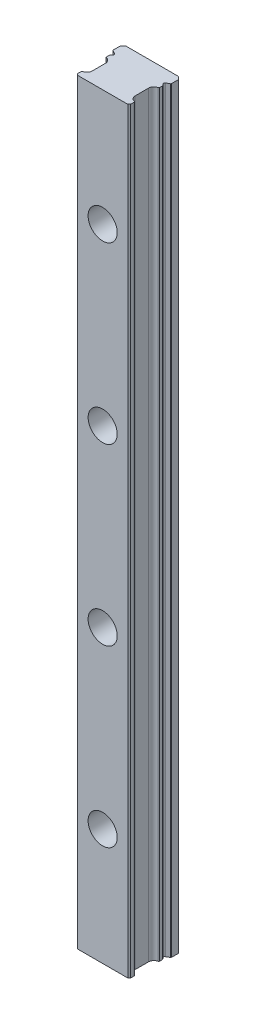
ISO-10303-21;
HEADER;
FILE_DESCRIPTION(('STEP AP214'),'2;1');
FILE_NAME('part.step','',(''),(''),'','','');
FILE_SCHEMA(('AUTOMOTIVE_DESIGN { 1 0 10303 214 1 1 1 1 }'));
ENDSEC;
DATA;
#1=APPLICATION_CONTEXT('core data for automotive mechanical design processes');
#2=APPLICATION_PROTOCOL_DEFINITION('international standard','automotive_design',2000,#1);
#3=PRODUCT_CONTEXT('',#1,'mechanical');
#4=PRODUCT('Part','Part','',(#3));
#5=PRODUCT_RELATED_PRODUCT_CATEGORY('part','',(#4));
#6=PRODUCT_DEFINITION_FORMATION('','',#4);
#7=PRODUCT_DEFINITION_CONTEXT('part definition',#1,'design');
#8=PRODUCT_DEFINITION('design','',#6,#7);
#9=PRODUCT_DEFINITION_SHAPE('','',#8);
#10=(LENGTH_UNIT() NAMED_UNIT(*) SI_UNIT(.MILLI.,.METRE.));
#11=(NAMED_UNIT(*) PLANE_ANGLE_UNIT() SI_UNIT($,.RADIAN.));
#12=(NAMED_UNIT(*) SI_UNIT($,.STERADIAN.) SOLID_ANGLE_UNIT());
#13=UNCERTAINTY_MEASURE_WITH_UNIT(LENGTH_MEASURE(1.E-05),#10,'distance_accuracy_value','');
#14=(GEOMETRIC_REPRESENTATION_CONTEXT(3) GLOBAL_UNCERTAINTY_ASSIGNED_CONTEXT((#13)) GLOBAL_UNIT_ASSIGNED_CONTEXT((#10,
#11,#12)) REPRESENTATION_CONTEXT('',''));
#15=CARTESIAN_POINT('',(0.,0.,0.));
#16=DIRECTION('',(0.,0.,1.));
#17=DIRECTION('',(1.,0.,0.));
#18=AXIS2_PLACEMENT_3D('',#15,#16,#17);
#19=CARTESIAN_POINT('',(-0.1268285,-0.017,7.2505));
#20=DIRECTION('',(0.,-1.,0.));
#21=DIRECTION('',(1.,0.,0.));
#22=AXIS2_PLACEMENT_3D('',#19,#20,#21);
#23=PLANE('',#22);
#24=DIRECTION('',(-0.30981067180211,0.,-0.95079826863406));
#25=VECTOR('',#24,1.);
#26=CARTESIAN_POINT('',(-0.06375,-0.017,7.439625));
#27=LINE('',#26,#25);
#28=CARTESIAN_POINT('',(-0.00212499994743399,-0.017,7.62874999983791));
#29=VERTEX_POINT('',#28);
#30=CARTESIAN_POINT('',(-0.125374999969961,-0.017,7.2505));
#31=VERTEX_POINT('',#30);
#32=EDGE_CURVE('E1348',#29,#31,#27,.T.);
#33=ORIENTED_EDGE('',*,*,#32,.T.);
#34=DIRECTION('',(1.,0.,0.));
#35=VECTOR('',#34,1.);
#36=CARTESIAN_POINT('',(-0.00424999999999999,-0.017,7.2505));
#37=LINE('',#36,#35);
#38=CARTESIAN_POINT('',(0.116874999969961,-0.017,7.2505));
#39=VERTEX_POINT('',#38);
#40=EDGE_CURVE('E1030',#31,#39,#37,.T.);
#41=ORIENTED_EDGE('',*,*,#40,.T.);
#42=DIRECTION('',(-0.30010528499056,0.,0.953906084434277));
#43=VECTOR('',#42,1.);
#44=CARTESIAN_POINT('',(0.057375,-0.017,7.439625));
#45=LINE('',#44,#43);
#46=EDGE_CURVE('E1031',#39,#29,#45,.T.);
#47=ORIENTED_EDGE('',*,*,#46,.T.);
#48=EDGE_LOOP('',(#33,#41,#47));
#49=FACE_BOUND('',#48,.T.);
#50=ADVANCED_FACE('F17',(#49),#23,.T.);
#51=CARTESIAN_POINT('',(1.033396,-0.017,8.57225));
#52=DIRECTION('',(0.,-1.,0.));
#53=DIRECTION('',(1.,0.,0.));
#54=AXIS2_PLACEMENT_3D('',#51,#52,#53);
#55=PLANE('',#54);
#56=DIRECTION('',(-0.290305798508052,0.,0.956933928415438));
#57=VECTOR('',#56,1.);
#58=CARTESIAN_POINT('',(1.224,-0.017,8.761375));
#59=LINE('',#58,#57);
#60=CARTESIAN_POINT('',(1.28137499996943,-0.017,8.57225));
#61=VERTEX_POINT('',#60);
#62=CARTESIAN_POINT('',(1.16662500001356,-0.017,8.95049999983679));
#63=VERTEX_POINT('',#62);
#64=EDGE_CURVE('E1040',#61,#63,#59,.T.);
#65=ORIENTED_EDGE('',*,*,#64,.T.);
#66=DIRECTION('',(-0.328932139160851,0.,-0.94435356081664));
#67=VECTOR('',#66,1.);
#68=CARTESIAN_POINT('',(1.10075,-0.017,8.761375));
#69=LINE('',#68,#67);
#70=CARTESIAN_POINT('',(1.03487500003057,-0.017,8.57225));
#71=VERTEX_POINT('',#70);
#72=EDGE_CURVE('E1046',#63,#71,#69,.T.);
#73=ORIENTED_EDGE('',*,*,#72,.T.);
#74=DIRECTION('',(1.,0.,0.));
#75=VECTOR('',#74,1.);
#76=CARTESIAN_POINT('',(1.158125,-0.017,8.57225));
#77=LINE('',#76,#75);
#78=EDGE_CURVE('E341',#71,#61,#77,.T.);
#79=ORIENTED_EDGE('',*,*,#78,.T.);
#80=EDGE_LOOP('',(#65,#73,#79));
#81=FACE_BOUND('',#80,.T.);
#82=ADVANCED_FACE('F1387',(#81),#55,.T.);
#83=CARTESIAN_POINT('',(-0.125375,-0.01847826,7.2505));
#84=DIRECTION('',(-0.95079826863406,0.,0.30981067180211));
#85=DIRECTION('',(0.30981067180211,0.,0.95079826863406));
#86=AXIS2_PLACEMENT_3D('',#83,#84,#85);
#87=PLANE('',#86);
#88=DIRECTION('',(0.309810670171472,0.,0.950798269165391));
#89=VECTOR('',#88,1.);
#90=CARTESIAN_POINT('',(-0.12537499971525,-0.01847826,7.2505000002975));
#91=LINE('',#90,#89);
#92=CARTESIAN_POINT('',(-0.125374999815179,-0.01847826,7.25050000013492));
#93=VERTEX_POINT('',#92);
#94=CARTESIAN_POINT('',(-0.00212500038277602,-0.01847826,7.62874999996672));
#95=VERTEX_POINT('',#94);
#96=EDGE_CURVE('E21',#93,#95,#91,.T.);
#97=ORIENTED_EDGE('',*,*,#96,.F.);
#98=DIRECTION('',(0.,1.,0.));
#99=VECTOR('',#98,1.);
#100=CARTESIAN_POINT('',(-0.125375,-0.01773913,7.2505));
#101=LINE('',#100,#99);
#102=EDGE_CURVE('E331',#93,#31,#101,.T.);
#103=ORIENTED_EDGE('',*,*,#102,.T.);
#104=ORIENTED_EDGE('',*,*,#32,.F.);
#105=DIRECTION('',(0.,-1.,0.));
#106=VECTOR('',#105,1.);
#107=CARTESIAN_POINT('',(-0.002125,-0.01773913,7.62875));
#108=LINE('',#107,#106);
#109=EDGE_CURVE('E1027',#29,#95,#108,.T.);
#110=ORIENTED_EDGE('',*,*,#109,.T.);
#111=EDGE_LOOP('',(#97,#103,#104,#110));
#112=FACE_BOUND('',#111,.T.);
#113=ADVANCED_FACE('F1345',(#112),#87,.F.);
#114=CARTESIAN_POINT('',(-0.002125,-0.01847826,7.62875));
#115=DIRECTION('',(0.953906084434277,0.,0.30010528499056));
#116=DIRECTION('',(0.30010528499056,0.,-0.953906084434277));
#117=AXIS2_PLACEMENT_3D('',#114,#115,#116);
#118=PLANE('',#117);
#119=DIRECTION('',(0.300105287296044,0.,-0.953906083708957));
#120=VECTOR('',#119,1.);
#121=CARTESIAN_POINT('',(-0.00212500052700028,-0.01847826,7.6287500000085));
#122=LINE('',#121,#120);
#123=CARTESIAN_POINT('',(0.116875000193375,-0.01847826,7.25050000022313));
#124=VERTEX_POINT('',#123);
#125=EDGE_CURVE('E1038',#95,#124,#122,.T.);
#126=ORIENTED_EDGE('',*,*,#125,.F.);
#127=ORIENTED_EDGE('',*,*,#109,.F.);
#128=ORIENTED_EDGE('',*,*,#46,.F.);
#129=DIRECTION('',(0.,-1.,0.));
#130=VECTOR('',#129,1.);
#131=CARTESIAN_POINT('',(0.116875,-0.01773913,7.2505));
#132=LINE('',#131,#130);
#133=EDGE_CURVE('E1032',#39,#124,#132,.T.);
#134=ORIENTED_EDGE('',*,*,#133,.T.);
#135=EDGE_LOOP('',(#126,#127,#128,#134));
#136=FACE_BOUND('',#135,.T.);
#137=ADVANCED_FACE('F1352',(#136),#118,.F.);
#138=CARTESIAN_POINT('',(-0.125375,-0.01847826,7.2505));
#139=DIRECTION('',(0.,0.,-1.));
#140=DIRECTION('',(0.,1.,0.));
#141=AXIS2_PLACEMENT_3D('',#138,#139,#140);
#142=PLANE('',#141);
#143=DIRECTION('',(-1.,0.,0.));
#144=VECTOR('',#143,1.);
#145=CARTESIAN_POINT('',(-0.0127500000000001,-0.01847826,7.2505000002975));
#146=LINE('',#145,#144);
#147=EDGE_CURVE('E1035',#124,#93,#146,.T.);
#148=ORIENTED_EDGE('',*,*,#147,.F.);
#149=ORIENTED_EDGE('',*,*,#133,.F.);
#150=ORIENTED_EDGE('',*,*,#40,.F.);
#151=ORIENTED_EDGE('',*,*,#102,.F.);
#152=EDGE_LOOP('',(#148,#149,#150,#151));
#153=FACE_BOUND('',#152,.T.);
#154=ADVANCED_FACE('F1356',(#153),#142,.F.);
#155=CARTESIAN_POINT('',(1.166625,-0.01847826,8.9505));
#156=DIRECTION('',(0.956933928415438,0.,0.290305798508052));
#157=DIRECTION('',(0.290305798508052,0.,-0.956933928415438));
#158=AXIS2_PLACEMENT_3D('',#155,#156,#157);
#159=PLANE('',#158);
#160=DIRECTION('',(0.290305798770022,0.,-0.956933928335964));
#161=VECTOR('',#160,1.);
#162=CARTESIAN_POINT('',(1.16662500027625,-0.01847826,8.950500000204));
#163=LINE('',#162,#161);
#164=CARTESIAN_POINT('',(1.16662500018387,-0.01847826,8.95050000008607));
#165=VERTEX_POINT('',#164);
#166=CARTESIAN_POINT('',(1.28137500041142,-0.01847826,8.57224999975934));
#167=VERTEX_POINT('',#166);
#168=EDGE_CURVE('E1037',#165,#167,#163,.T.);
#169=ORIENTED_EDGE('',*,*,#168,.F.);
#170=DIRECTION('',(0.,1.,0.));
#171=VECTOR('',#170,1.);
#172=CARTESIAN_POINT('',(1.166625,-0.01773913,8.9505));
#173=LINE('',#172,#171);
#174=EDGE_CURVE('E1017',#165,#63,#173,.T.);
#175=ORIENTED_EDGE('',*,*,#174,.T.);
#176=ORIENTED_EDGE('',*,*,#64,.F.);
#177=DIRECTION('',(0.,-1.,0.));
#178=VECTOR('',#177,1.);
#179=CARTESIAN_POINT('',(1.281375,-0.01773913,8.57225));
#180=LINE('',#179,#178);
#181=EDGE_CURVE('E1049',#61,#167,#180,.T.);
#182=ORIENTED_EDGE('',*,*,#181,.T.);
#183=EDGE_LOOP('',(#169,#175,#176,#182));
#184=FACE_BOUND('',#183,.T.);
#185=ADVANCED_FACE('F1358',(#184),#159,.F.);
#186=CARTESIAN_POINT('',(1.034875,-0.01847826,8.57225));
#187=DIRECTION('',(0.,0.,-1.));
#188=DIRECTION('',(0.,1.,0.));
#189=AXIS2_PLACEMENT_3D('',#186,#187,#188);
#190=PLANE('',#189);
#191=DIRECTION('',(-1.,0.,0.));
#192=VECTOR('',#191,1.);
#193=CARTESIAN_POINT('',(1.15175,-0.01847826,8.572249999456));
#194=LINE('',#193,#192);
#195=CARTESIAN_POINT('',(1.03487500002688,-0.01847826,8.57224999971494));
#196=VERTEX_POINT('',#195);
#197=EDGE_CURVE('E1041',#167,#196,#194,.T.);
#198=ORIENTED_EDGE('',*,*,#197,.F.);
#199=ORIENTED_EDGE('',*,*,#181,.F.);
#200=ORIENTED_EDGE('',*,*,#78,.F.);
#201=DIRECTION('',(0.,-1.,0.));
#202=VECTOR('',#201,1.);
#203=CARTESIAN_POINT('',(1.034875,-0.01773913,8.57225));
#204=LINE('',#203,#202);
#205=EDGE_CURVE('E1044',#71,#196,#204,.T.);
#206=ORIENTED_EDGE('',*,*,#205,.T.);
#207=EDGE_LOOP('',(#198,#199,#200,#206));
#208=FACE_BOUND('',#207,.T.);
#209=ADVANCED_FACE('F1365',(#208),#190,.F.);
#210=CARTESIAN_POINT('',(1.034875,-0.01847826,8.57225));
#211=DIRECTION('',(-0.94435356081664,0.,0.328932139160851));
#212=DIRECTION('',(0.328932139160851,0.,0.94435356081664));
#213=AXIS2_PLACEMENT_3D('',#210,#211,#212);
#214=PLANE('',#213);
#215=DIRECTION('',(0.328932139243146,0.,0.944353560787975));
#216=VECTOR('',#215,1.);
#217=CARTESIAN_POINT('',(1.03487499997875,-0.01847826,8.572249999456));
#218=LINE('',#217,#216);
#219=EDGE_CURVE('E1043',#196,#165,#218,.T.);
#220=ORIENTED_EDGE('',*,*,#219,.F.);
#221=ORIENTED_EDGE('',*,*,#205,.F.);
#222=ORIENTED_EDGE('',*,*,#72,.F.);
#223=ORIENTED_EDGE('',*,*,#174,.F.);
#224=EDGE_LOOP('',(#220,#221,#222,#223));
#225=FACE_BOUND('',#224,.T.);
#226=ADVANCED_FACE('F1410',(#225),#214,.F.);
#227=CARTESIAN_POINT('',(-8.637696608,0.,4.988432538));
#228=DIRECTION('',(-0.707106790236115,0.,-0.70710677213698));
#229=DIRECTION('',(-0.70710677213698,0.,0.707106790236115));
#230=AXIS2_PLACEMENT_3D('',#227,#228,#229);
#231=PLANE('',#230);
#232=DIRECTION('',(0.70710677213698,0.,-0.707106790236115));
#233=VECTOR('',#232,1.);
#234=CARTESIAN_POINT('',(-8.8330393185,260.,5.1837752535));
#235=LINE('',#234,#233);
#236=CARTESIAN_POINT('',(-9.02838202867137,260.,5.37911796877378));
#237=VERTEX_POINT('',#236);
#238=CARTESIAN_POINT('',(-8.63769660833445,260.,4.98843253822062));
#239=VERTEX_POINT('',#238);
#240=EDGE_CURVE('E1008',#237,#239,#235,.T.);
#241=ORIENTED_EDGE('',*,*,#240,.T.);
#242=DIRECTION('',(0.,-1.,0.));
#243=VECTOR('',#242,1.);
#244=CARTESIAN_POINT('',(-8.63769661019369,130.,4.98843253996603));
#245=LINE('',#244,#243);
#246=CARTESIAN_POINT('',(-8.63769660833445,0.,4.98843253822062));
#247=VERTEX_POINT('',#246);
#248=EDGE_CURVE('E1009',#247,#239,#245,.F.);
#249=ORIENTED_EDGE('',*,*,#248,.F.);
#250=DIRECTION('',(-0.70710677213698,0.,0.707106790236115));
#251=VECTOR('',#250,1.);
#252=CARTESIAN_POINT('',(-8.8330393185,0.,5.1837752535));
#253=LINE('',#252,#251);
#254=CARTESIAN_POINT('',(-9.02838202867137,0.,5.37911796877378));
#255=VERTEX_POINT('',#254);
#256=EDGE_CURVE('E1015',#247,#255,#253,.T.);
#257=ORIENTED_EDGE('',*,*,#256,.T.);
#258=DIRECTION('',(0.,-1.,0.));
#259=VECTOR('',#258,1.);
#260=CARTESIAN_POINT('',(-9.02838203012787,130.,5.37911797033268));
#261=LINE('',#260,#259);
#262=EDGE_CURVE('E1018',#255,#237,#261,.F.);
#263=ORIENTED_EDGE('',*,*,#262,.T.);
#264=EDGE_LOOP('',(#241,#249,#257,#263));
#265=FACE_BOUND('',#264,.T.);
#266=ADVANCED_FACE('F1417',(#265),#231,.T.);
#267=CARTESIAN_POINT('',(9.028382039,0.,5.379117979));
#268=DIRECTION('',(0.707106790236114,0.,-0.707106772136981));
#269=DIRECTION('',(-0.707106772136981,0.,-0.707106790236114));
#270=AXIS2_PLACEMENT_3D('',#267,#268,#269);
#271=PLANE('',#270);
#272=DIRECTION('',(0.707106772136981,0.,0.707106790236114));
#273=VECTOR('',#272,1.);
#274=CARTESIAN_POINT('',(8.8330393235,260.,5.1837752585));
#275=LINE('',#274,#273);
#276=CARTESIAN_POINT('',(8.63769660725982,260.,4.98843253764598));
#277=VERTEX_POINT('',#276);
#278=CARTESIAN_POINT('',(9.02838203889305,260.,5.37911797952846));
#279=VERTEX_POINT('',#278);
#280=EDGE_CURVE('E999',#277,#279,#275,.T.);
#281=ORIENTED_EDGE('',*,*,#280,.T.);
#282=DIRECTION('',(0.,1.,0.));
#283=VECTOR('',#282,1.);
#284=CARTESIAN_POINT('',(9.02838202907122,130.,5.37911797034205));
#285=LINE('',#284,#283);
#286=CARTESIAN_POINT('',(9.02838203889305,0.,5.37911797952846));
#287=VERTEX_POINT('',#286);
#288=EDGE_CURVE('E1023',#279,#287,#285,.F.);
#289=ORIENTED_EDGE('',*,*,#288,.T.);
#290=DIRECTION('',(-0.707106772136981,0.,-0.707106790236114));
#291=VECTOR('',#290,1.);
#292=CARTESIAN_POINT('',(8.8330393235,0.,5.1837752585));
#293=LINE('',#292,#291);
#294=CARTESIAN_POINT('',(8.63769660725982,0.,4.98843253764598));
#295=VERTEX_POINT('',#294);
#296=EDGE_CURVE('E1001',#287,#295,#293,.T.);
#297=ORIENTED_EDGE('',*,*,#296,.T.);
#298=DIRECTION('',(0.,1.,0.));
#299=VECTOR('',#298,1.);
#300=CARTESIAN_POINT('',(8.63769660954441,130.,4.98843254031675));
#301=LINE('',#300,#299);
#302=EDGE_CURVE('E1002',#277,#295,#301,.F.);
#303=ORIENTED_EDGE('',*,*,#302,.F.);
#304=EDGE_LOOP('',(#281,#289,#297,#303));
#305=FACE_BOUND('',#304,.T.);
#306=ADVANCED_FACE('F1426',(#305),#271,.T.);
#307=CARTESIAN_POINT('',(-0.643875,-0.01847826,7.8625));
#308=DIRECTION('',(0.,-1.,0.));
#309=DIRECTION('',(0.,0.,-1.));
#310=AXIS2_PLACEMENT_3D('',#307,#308,#309);
#311=PLANE('',#310);
#312=ORIENTED_EDGE('',*,*,#125,.T.);
#313=ORIENTED_EDGE('',*,*,#147,.T.);
#314=ORIENTED_EDGE('',*,*,#96,.T.);
#315=EDGE_LOOP('',(#312,#313,#314));
#316=FACE_BOUND('',#315,.T.);
#317=DIRECTION('',(0.,0.,-1.));
#318=VECTOR('',#317,1.);
#319=CARTESIAN_POINT('',(0.618375,-0.01847826,6.8085));
#320=LINE('',#319,#318);
#321=CARTESIAN_POINT('',(0.618375,-0.01847826,6.9190000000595));
#322=VERTEX_POINT('',#321);
#323=CARTESIAN_POINT('',(0.618375,-0.01847826,6.698));
#324=VERTEX_POINT('',#323);
#325=EDGE_CURVE('E1175',#322,#324,#320,.T.);
#326=ORIENTED_EDGE('',*,*,#325,.F.);
#327=DIRECTION('',(1.,0.,0.));
#328=VECTOR('',#327,1.);
#329=CARTESIAN_POINT('',(0.558875,-0.01847826,6.919));
#330=LINE('',#329,#328);
#331=CARTESIAN_POINT('',(0.49937500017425,-0.01847826,6.9190000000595));
#332=VERTEX_POINT('',#331);
#333=EDGE_CURVE('E1170',#332,#322,#330,.T.);
#334=ORIENTED_EDGE('',*,*,#333,.F.);
#335=DIRECTION('',(0.290007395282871,0.,-0.957024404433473));
#336=VECTOR('',#335,1.);
#337=CARTESIAN_POINT('',(0.393125,-0.01847826,7.269625));
#338=LINE('',#337,#336);
#339=CARTESIAN_POINT('',(0.286874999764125,-0.01847826,7.62025000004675));
#340=VERTEX_POINT('',#339);
#341=EDGE_CURVE('E1171',#340,#332,#338,.T.);
#342=ORIENTED_EDGE('',*,*,#341,.F.);
#343=DIRECTION('',(-1.,0.,0.));
#344=VECTOR('',#343,1.);
#345=CARTESIAN_POINT('',(0.337875,-0.01847826,7.62025));
#346=LINE('',#345,#344);
#347=CARTESIAN_POINT('',(0.38887499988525,-0.01847826,7.62025000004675));
#348=VERTEX_POINT('',#347);
#349=EDGE_CURVE('E3137',#348,#340,#346,.T.);
#350=ORIENTED_EDGE('',*,*,#349,.F.);
#351=DIRECTION('',(0.,0.,-1.));
#352=VECTOR('',#351,1.);
#353=CARTESIAN_POINT('',(0.388875,-0.01847826,7.741375));
#354=LINE('',#353,#352);
#355=CARTESIAN_POINT('',(0.38887499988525,-0.01847826,7.8625));
#356=VERTEX_POINT('',#355);
#357=EDGE_CURVE('E3142',#356,#348,#354,.T.);
#358=ORIENTED_EDGE('',*,*,#357,.F.);
#359=DIRECTION('',(1.,0.,0.));
#360=VECTOR('',#359,1.);
#361=CARTESIAN_POINT('',(-0.00637499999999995,-0.01847826,7.8625));
#362=LINE('',#361,#360);
#363=CARTESIAN_POINT('',(-0.401624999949,-0.01847826,7.8625));
#364=VERTEX_POINT('',#363);
#365=EDGE_CURVE('E3147',#364,#356,#362,.T.);
#366=ORIENTED_EDGE('',*,*,#365,.F.);
#367=DIRECTION('',(0.,0.,1.));
#368=VECTOR('',#367,1.);
#369=CARTESIAN_POINT('',(-0.401625,-0.01847826,7.741375));
#370=LINE('',#369,#368);
#371=CARTESIAN_POINT('',(-0.401624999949,-0.01847826,7.62025000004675));
#372=VERTEX_POINT('',#371);
#373=EDGE_CURVE('E1005',#372,#364,#370,.T.);
#374=ORIENTED_EDGE('',*,*,#373,.F.);
#375=DIRECTION('',(-1.,0.,0.));
#376=VECTOR('',#375,1.);
#377=CARTESIAN_POINT('',(-0.35275,-0.01847826,7.62025));
#378=LINE('',#377,#376);
#379=CARTESIAN_POINT('',(-0.303875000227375,-0.01847826,7.62025000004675));
#380=VERTEX_POINT('',#379);
#381=EDGE_CURVE('E1152',#380,#372,#378,.T.);
#382=ORIENTED_EDGE('',*,*,#381,.F.);
#383=DIRECTION('',(0.300578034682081,0.,0.953757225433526));
#384=VECTOR('',#383,1.);
#385=CARTESIAN_POINT('',(-0.414375,-0.01847826,7.269625));
#386=LINE('',#385,#384);
#387=CARTESIAN_POINT('',(-0.52487500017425,-0.01847826,6.9190000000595));
#388=VERTEX_POINT('',#387);
#389=EDGE_CURVE('E1153',#388,#380,#386,.T.);
#390=ORIENTED_EDGE('',*,*,#389,.F.);
#391=DIRECTION('',(1.,0.,0.));
#392=VECTOR('',#391,1.);
#393=CARTESIAN_POINT('',(-0.584375,-0.01847826,6.919));
#394=LINE('',#393,#392);
#395=CARTESIAN_POINT('',(-0.643875,-0.01847826,6.9190000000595));
#396=VERTEX_POINT('',#395);
#397=EDGE_CURVE('E3093',#396,#388,#394,.T.);
#398=ORIENTED_EDGE('',*,*,#397,.F.);
#399=DIRECTION('',(0.,0.,1.));
#400=VECTOR('',#399,1.);
#401=CARTESIAN_POINT('',(-0.643875,-0.01847826,6.8085));
#402=LINE('',#401,#400);
#403=CARTESIAN_POINT('',(-0.643875,-0.01847826,6.698));
#404=VERTEX_POINT('',#403);
#405=EDGE_CURVE('E3098',#404,#396,#402,.T.);
#406=ORIENTED_EDGE('',*,*,#405,.F.);
#407=DIRECTION('',(-1.,0.,0.));
#408=VECTOR('',#407,1.);
#409=CARTESIAN_POINT('',(-0.384625,-0.01847826,6.698));
#410=LINE('',#409,#408);
#411=CARTESIAN_POINT('',(-0.125374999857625,-0.01847826,6.698));
#412=VERTEX_POINT('',#411);
#413=EDGE_CURVE('E3103',#412,#404,#410,.T.);
#414=ORIENTED_EDGE('',*,*,#413,.F.);
#415=DIRECTION('',(0.,0.,-1.));
#416=VECTOR('',#415,1.);
#417=CARTESIAN_POINT('',(-0.125375,-0.01847826,6.81275));
#418=LINE('',#417,#416);
#419=CARTESIAN_POINT('',(-0.125374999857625,-0.01847826,6.927500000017));
#420=VERTEX_POINT('',#419);
#421=EDGE_CURVE('E1202',#420,#412,#418,.T.);
#422=ORIENTED_EDGE('',*,*,#421,.F.);
#423=DIRECTION('',(1.,0.,0.));
#424=VECTOR('',#423,1.);
#425=CARTESIAN_POINT('',(-0.180625,-0.01847826,6.9275));
#426=LINE('',#425,#424);
#427=CARTESIAN_POINT('',(-0.235875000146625,-0.01847826,6.927500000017));
#428=VERTEX_POINT('',#427);
#429=EDGE_CURVE('E1198',#428,#420,#426,.T.);
#430=ORIENTED_EDGE('',*,*,#429,.F.);
#431=DIRECTION('',(-0.325990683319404,0.,-0.945372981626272));
#432=VECTOR('',#431,1.);
#433=CARTESIAN_POINT('',(-0.214625,-0.01847826,6.989125));
#434=LINE('',#433,#432);
#435=CARTESIAN_POINT('',(-0.193374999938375,-0.01847826,7.050749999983));
#436=VERTEX_POINT('',#435);
#437=EDGE_CURVE('E1191',#436,#428,#434,.T.);
#438=ORIENTED_EDGE('',*,*,#437,.F.);
#439=DIRECTION('',(-1.,0.,0.));
#440=VECTOR('',#439,1.);
#441=CARTESIAN_POINT('',(-0.00425000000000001,-0.01847826,7.05075));
#442=LINE('',#441,#440);
#443=CARTESIAN_POINT('',(0.184875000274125,-0.01847826,7.050749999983));
#444=VERTEX_POINT('',#443);
#445=EDGE_CURVE('E1186',#444,#436,#442,.T.);
#446=ORIENTED_EDGE('',*,*,#445,.F.);
#447=DIRECTION('',(-0.325990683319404,0.,0.945372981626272));
#448=VECTOR('',#447,1.);
#449=CARTESIAN_POINT('',(0.206125,-0.01847826,6.989125));
#450=LINE('',#449,#448);
#451=CARTESIAN_POINT('',(0.22737499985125,-0.01847826,6.927500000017));
#452=VERTEX_POINT('',#451);
#453=EDGE_CURVE('E1187',#452,#444,#450,.T.);
#454=ORIENTED_EDGE('',*,*,#453,.F.);
#455=DIRECTION('',(1.,0.,0.));
#456=VECTOR('',#455,1.);
#457=CARTESIAN_POINT('',(0.167875,-0.01847826,6.9275));
#458=LINE('',#457,#456);
#459=CARTESIAN_POINT('',(0.1083750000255,-0.01847826,6.927500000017));
#460=VERTEX_POINT('',#459);
#461=EDGE_CURVE('E3116',#460,#452,#458,.T.);
#462=ORIENTED_EDGE('',*,*,#461,.F.);
#463=DIRECTION('',(0.,0.,1.));
#464=VECTOR('',#463,1.);
#465=CARTESIAN_POINT('',(0.108375,-0.01847826,6.81275));
#466=LINE('',#465,#464);
#467=CARTESIAN_POINT('',(0.1083750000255,-0.01847826,6.698));
#468=VERTEX_POINT('',#467);
#469=EDGE_CURVE('E3121',#468,#460,#466,.T.);
#470=ORIENTED_EDGE('',*,*,#469,.F.);
#471=DIRECTION('',(-1.,0.,0.));
#472=VECTOR('',#471,1.);
#473=CARTESIAN_POINT('',(0.363375,-0.01847826,6.698));
#474=LINE('',#473,#472);
#475=EDGE_CURVE('E3126',#324,#468,#474,.T.);
#476=ORIENTED_EDGE('',*,*,#475,.F.);
#477=EDGE_LOOP('',(#326,#334,#342,#350,#358,#366,#374,#382,#390,#398,#406,#414,#422,#430,#438,
#446,#454,#462,#470,#476));
#478=FACE_BOUND('',#477,.T.);
#479=ADVANCED_FACE('F1340',(#316,#478),#311,.T.);
#480=CARTESIAN_POINT('',(-1.689375,-0.01847826,9.17575));
#481=DIRECTION('',(0.,-1.,0.));
#482=DIRECTION('',(0.,0.,-1.));
#483=AXIS2_PLACEMENT_3D('',#480,#481,#482);
#484=PLANE('',#483);
#485=DIRECTION('',(-1.,0.,0.));
#486=VECTOR('',#485,1.);
#487=CARTESIAN_POINT('',(-1.289875,-0.01847826,8.01975));
#488=LINE('',#487,#486);
#489=CARTESIAN_POINT('',(-0.8946250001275,-0.01847826,8.01975));
#490=VERTEX_POINT('',#489);
#491=CARTESIAN_POINT('',(-1.6851249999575,-0.01847826,8.01975));
#492=VERTEX_POINT('',#491);
#493=EDGE_CURVE('E3059',#490,#492,#488,.T.);
#494=ORIENTED_EDGE('',*,*,#493,.F.);
#495=DIRECTION('',(0.,0.,-1.));
#496=VECTOR('',#495,1.);
#497=CARTESIAN_POINT('',(-0.894625,-0.01847826,8.1345));
#498=LINE('',#497,#496);
#499=CARTESIAN_POINT('',(-0.8946250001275,-0.01847826,8.249250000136));
#500=VERTEX_POINT('',#499);
#501=EDGE_CURVE('E3064',#500,#490,#498,.T.);
#502=ORIENTED_EDGE('',*,*,#501,.F.);
#503=DIRECTION('',(1.,0.,0.));
#504=VECTOR('',#503,1.);
#505=CARTESIAN_POINT('',(-1.02425,-0.01847826,8.24925));
#506=LINE('',#505,#504);
#507=CARTESIAN_POINT('',(-1.15387499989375,-0.01847826,8.249250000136));
#508=VERTEX_POINT('',#507);
#509=EDGE_CURVE('E3069',#508,#500,#506,.T.);
#510=ORIENTED_EDGE('',*,*,#509,.F.);
#511=DIRECTION('',(0.,0.,-1.));
#512=VECTOR('',#511,1.);
#513=CARTESIAN_POINT('',(-1.153875,-0.01847826,8.595625));
#514=LINE('',#513,#512);
#515=CARTESIAN_POINT('',(-1.15387499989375,-0.01847826,8.942000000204));
#516=VERTEX_POINT('',#515);
#517=EDGE_CURVE('E3074',#516,#508,#514,.T.);
#518=ORIENTED_EDGE('',*,*,#517,.F.);
#519=DIRECTION('',(-1.,0.,0.));
#520=VECTOR('',#519,1.);
#521=CARTESIAN_POINT('',(-1.017875,-0.01847826,8.942));
#522=LINE('',#521,#520);
#523=CARTESIAN_POINT('',(-0.881875,-0.01847826,8.942000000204));
#524=VERTEX_POINT('',#523);
#525=EDGE_CURVE('E3079',#524,#516,#522,.T.);
#526=ORIENTED_EDGE('',*,*,#525,.F.);
#527=DIRECTION('',(0.,0.,-1.));
#528=VECTOR('',#527,1.);
#529=CARTESIAN_POINT('',(-0.881875,-0.01847826,9.058875));
#530=LINE('',#529,#528);
#531=CARTESIAN_POINT('',(-0.881875,-0.01847826,9.17575));
#532=VERTEX_POINT('',#531);
#533=EDGE_CURVE('E3084',#532,#524,#530,.T.);
#534=ORIENTED_EDGE('',*,*,#533,.F.);
#535=DIRECTION('',(1.,0.,0.));
#536=VECTOR('',#535,1.);
#537=CARTESIAN_POINT('',(-1.285625,-0.01847826,9.17575));
#538=LINE('',#537,#536);
#539=CARTESIAN_POINT('',(-1.689375,-0.01847826,9.17575));
#540=VERTEX_POINT('',#539);
#541=EDGE_CURVE('E1157',#540,#532,#538,.T.);
#542=ORIENTED_EDGE('',*,*,#541,.F.);
#543=DIRECTION('',(0.,0.,1.));
#544=VECTOR('',#543,1.);
#545=CARTESIAN_POINT('',(-1.689375,-0.01847826,9.058875));
#546=LINE('',#545,#544);
#547=CARTESIAN_POINT('',(-1.689375,-0.01847826,8.942000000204));
#548=VERTEX_POINT('',#547);
#549=EDGE_CURVE('E3032',#548,#540,#546,.T.);
#550=ORIENTED_EDGE('',*,*,#549,.F.);
#551=DIRECTION('',(-1.,0.,0.));
#552=VECTOR('',#551,1.);
#553=CARTESIAN_POINT('',(-1.557625,-0.01847826,8.942));
#554=LINE('',#553,#552);
#555=CARTESIAN_POINT('',(-1.42587500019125,-0.01847826,8.942000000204));
#556=VERTEX_POINT('',#555);
#557=EDGE_CURVE('E3039',#556,#548,#554,.T.);
#558=ORIENTED_EDGE('',*,*,#557,.F.);
#559=DIRECTION('',(0.,0.,1.));
#560=VECTOR('',#559,1.);
#561=CARTESIAN_POINT('',(-1.425875,-0.01847826,8.595625));
#562=LINE('',#561,#560);
#563=CARTESIAN_POINT('',(-1.42587500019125,-0.01847826,8.249250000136));
#564=VERTEX_POINT('',#563);
#565=EDGE_CURVE('E3044',#564,#556,#562,.T.);
#566=ORIENTED_EDGE('',*,*,#565,.F.);
#567=DIRECTION('',(1.,0.,0.));
#568=VECTOR('',#567,1.);
#569=CARTESIAN_POINT('',(-1.5555,-0.01847826,8.24925));
#570=LINE('',#569,#568);
#571=CARTESIAN_POINT('',(-1.6851249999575,-0.01847826,8.249250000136));
#572=VERTEX_POINT('',#571);
#573=EDGE_CURVE('E3049',#572,#564,#570,.T.);
#574=ORIENTED_EDGE('',*,*,#573,.F.);
#575=DIRECTION('',(0.,0.,1.));
#576=VECTOR('',#575,1.);
#577=CARTESIAN_POINT('',(-1.685125,-0.01847826,8.1345));
#578=LINE('',#577,#576);
#579=EDGE_CURVE('E3054',#492,#572,#578,.T.);
#580=ORIENTED_EDGE('',*,*,#579,.F.);
#581=EDGE_LOOP('',(#494,#502,#510,#518,#526,#534,#542,#550,#558,#566,#574,#580));
#582=FACE_BOUND('',#581,.T.);
#583=ADVANCED_FACE('F1445',(#582),#484,.T.);
#584=CARTESIAN_POINT('',(-0.754375,-0.01847826,9.17575));
#585=DIRECTION('',(0.,-1.,0.));
#586=DIRECTION('',(0.,0.,-1.));
#587=AXIS2_PLACEMENT_3D('',#584,#585,#586);
#588=PLANE('',#587);
#589=DIRECTION('',(-1.,0.,0.));
#590=VECTOR('',#589,1.);
#591=CARTESIAN_POINT('',(0.465375,-0.01847826,8.942));
#592=LINE('',#591,#590);
#593=CARTESIAN_POINT('',(0.516375,-0.01847826,8.942000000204));
#594=VERTEX_POINT('',#593);
#595=CARTESIAN_POINT('',(0.414374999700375,-0.01847826,8.942000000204));
#596=VERTEX_POINT('',#595);
#597=EDGE_CURVE('E3005',#594,#596,#592,.T.);
#598=ORIENTED_EDGE('',*,*,#597,.F.);
#599=DIRECTION('',(0.,0.,-1.));
#600=VECTOR('',#599,1.);
#601=CARTESIAN_POINT('',(0.516375,-0.01847826,9.058875));
#602=LINE('',#601,#600);
#603=CARTESIAN_POINT('',(0.516375,-0.01847826,9.17575));
#604=VERTEX_POINT('',#603);
#605=EDGE_CURVE('E3010',#604,#594,#602,.T.);
#606=ORIENTED_EDGE('',*,*,#605,.F.);
#607=DIRECTION('',(1.,0.,0.));
#608=VECTOR('',#607,1.);
#609=CARTESIAN_POINT('',(0.257125,-0.01847826,9.17575));
#610=LINE('',#609,#608);
#611=CARTESIAN_POINT('',(-0.00212500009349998,-0.01847826,9.17575));
#612=VERTEX_POINT('',#611);
#613=EDGE_CURVE('E3015',#612,#604,#610,.T.);
#614=ORIENTED_EDGE('',*,*,#613,.F.);
#615=DIRECTION('',(0.,0.,1.));
#616=VECTOR('',#615,1.);
#617=CARTESIAN_POINT('',(-0.002125,-0.01847826,9.058875));
#618=LINE('',#617,#616);
#619=CARTESIAN_POINT('',(-0.00212500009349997,-0.01847826,8.942000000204));
#620=VERTEX_POINT('',#619);
#621=EDGE_CURVE('E3020',#620,#612,#618,.T.);
#622=ORIENTED_EDGE('',*,*,#621,.F.);
#623=DIRECTION('',(-1.,0.,0.));
#624=VECTOR('',#623,1.);
#625=CARTESIAN_POINT('',(0.053125,-0.01847826,8.942));
#626=LINE('',#625,#624);
#627=CARTESIAN_POINT('',(0.10837500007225,-0.01847826,8.942000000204));
#628=VERTEX_POINT('',#627);
#629=EDGE_CURVE('E1123',#628,#620,#626,.T.);
#630=ORIENTED_EDGE('',*,*,#629,.F.);
#631=DIRECTION('',(0.,0.,1.));
#632=VECTOR('',#631,1.);
#633=CARTESIAN_POINT('',(0.108375,-0.01847826,8.7125));
#634=LINE('',#633,#632);
#635=CARTESIAN_POINT('',(0.10837500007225,-0.01847826,8.482999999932));
#636=VERTEX_POINT('',#635);
#637=EDGE_CURVE('E1124',#636,#628,#634,.T.);
#638=ORIENTED_EDGE('',*,*,#637,.F.);
#639=DIRECTION('',(0.537879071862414,0.,-0.843022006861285));
#640=VECTOR('',#639,1.);
#641=CARTESIAN_POINT('',(-0.112625,-0.01847826,8.829375));
#642=LINE('',#641,#640);
#643=CARTESIAN_POINT('',(-0.333624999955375,-0.01847826,9.17575));
#644=VERTEX_POINT('',#643);
#645=EDGE_CURVE('E3029',#644,#636,#642,.T.);
#646=ORIENTED_EDGE('',*,*,#645,.F.);
#647=DIRECTION('',(1.,0.,0.));
#648=VECTOR('',#647,1.);
#649=CARTESIAN_POINT('',(-0.544,-0.01847826,9.17575));
#650=LINE('',#649,#648);
#651=CARTESIAN_POINT('',(-0.754375,-0.01847826,9.17575));
#652=VERTEX_POINT('',#651);
#653=EDGE_CURVE('E1114',#652,#644,#650,.T.);
#654=ORIENTED_EDGE('',*,*,#653,.F.);
#655=DIRECTION('',(0.,0.,1.));
#656=VECTOR('',#655,1.);
#657=CARTESIAN_POINT('',(-0.754375,-0.01847826,9.058875));
#658=LINE('',#657,#656);
#659=CARTESIAN_POINT('',(-0.754375,-0.01847826,8.942000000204));
#660=VERTEX_POINT('',#659);
#661=EDGE_CURVE('E2954',#660,#652,#658,.T.);
#662=ORIENTED_EDGE('',*,*,#661,.F.);
#663=DIRECTION('',(-1.,0.,0.));
#664=VECTOR('',#663,1.);
#665=CARTESIAN_POINT('',(-0.69275,-0.01847826,8.942));
#666=LINE('',#665,#664);
#667=CARTESIAN_POINT('',(-0.631124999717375,-0.01847826,8.942000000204));
#668=VERTEX_POINT('',#667);
#669=EDGE_CURVE('E2959',#668,#660,#666,.T.);
#670=ORIENTED_EDGE('',*,*,#669,.F.);
#671=DIRECTION('',(0.,0.,1.));
#672=VECTOR('',#671,1.);
#673=CARTESIAN_POINT('',(-0.631125,-0.01847826,8.595625));
#674=LINE('',#673,#672);
#675=CARTESIAN_POINT('',(-0.631124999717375,-0.01847826,8.249250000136));
#676=VERTEX_POINT('',#675);
#677=EDGE_CURVE('E2964',#676,#668,#674,.T.);
#678=ORIENTED_EDGE('',*,*,#677,.F.);
#679=DIRECTION('',(1.,0.,0.));
#680=VECTOR('',#679,1.);
#681=CARTESIAN_POINT('',(-0.69275,-0.01847826,8.24925));
#682=LINE('',#681,#680);
#683=CARTESIAN_POINT('',(-0.754375,-0.01847826,8.249250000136));
#684=VERTEX_POINT('',#683);
#685=EDGE_CURVE('E2969',#684,#676,#682,.T.);
#686=ORIENTED_EDGE('',*,*,#685,.F.);
#687=DIRECTION('',(0.,0.,1.));
#688=VECTOR('',#687,1.);
#689=CARTESIAN_POINT('',(-0.754375,-0.01847826,8.1345));
#690=LINE('',#689,#688);
#691=CARTESIAN_POINT('',(-0.754375,-0.01847826,8.01975));
#692=VERTEX_POINT('',#691);
#693=EDGE_CURVE('E2974',#692,#684,#690,.T.);
#694=ORIENTED_EDGE('',*,*,#693,.F.);
#695=DIRECTION('',(-1.,0.,0.));
#696=VECTOR('',#695,1.);
#697=CARTESIAN_POINT('',(-0.493,-0.01847826,8.01975));
#698=LINE('',#697,#696);
#699=CARTESIAN_POINT('',(-0.231625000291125,-0.01847826,8.01975));
#700=VERTEX_POINT('',#699);
#701=EDGE_CURVE('E2979',#700,#692,#698,.T.);
#702=ORIENTED_EDGE('',*,*,#701,.F.);
#703=DIRECTION('',(0.,0.,-1.));
#704=VECTOR('',#703,1.);
#705=CARTESIAN_POINT('',(-0.231625,-0.01847826,8.1345));
#706=LINE('',#705,#704);
#707=CARTESIAN_POINT('',(-0.231625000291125,-0.01847826,8.249250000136));
#708=VERTEX_POINT('',#707);
#709=EDGE_CURVE('E2984',#708,#700,#706,.T.);
#710=ORIENTED_EDGE('',*,*,#709,.F.);
#711=DIRECTION('',(1.,0.,0.));
#712=VECTOR('',#711,1.);
#713=CARTESIAN_POINT('',(-0.286875,-0.01847826,8.24925));
#714=LINE('',#713,#712);
#715=CARTESIAN_POINT('',(-0.3421249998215,-0.01847826,8.249250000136));
#716=VERTEX_POINT('',#715);
#717=EDGE_CURVE('E1141',#716,#708,#714,.T.);
#718=ORIENTED_EDGE('',*,*,#717,.F.);
#719=DIRECTION('',(0.,0.,-1.));
#720=VECTOR('',#719,1.);
#721=CARTESIAN_POINT('',(-0.342125,-0.01847826,8.480875));
#722=LINE('',#721,#720);
#723=CARTESIAN_POINT('',(-0.3421249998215,-0.01847826,8.712500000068));
#724=VERTEX_POINT('',#723);
#725=EDGE_CURVE('E1136',#724,#716,#722,.T.);
#726=ORIENTED_EDGE('',*,*,#725,.F.);
#727=DIRECTION('',(-0.541539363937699,0.,0.840675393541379));
#728=VECTOR('',#727,1.);
#729=CARTESIAN_POINT('',(-0.119,-0.01847826,8.366125));
#730=LINE('',#729,#728);
#731=CARTESIAN_POINT('',(0.1041249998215,-0.01847826,8.01975));
#732=VERTEX_POINT('',#731);
#733=EDGE_CURVE('E1137',#732,#724,#730,.T.);
#734=ORIENTED_EDGE('',*,*,#733,.F.);
#735=DIRECTION('',(-1.,0.,0.));
#736=VECTOR('',#735,1.);
#737=CARTESIAN_POINT('',(0.25925,-0.01847826,8.01975));
#738=LINE('',#737,#736);
#739=CARTESIAN_POINT('',(0.414374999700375,-0.01847826,8.01975));
#740=VERTEX_POINT('',#739);
#741=EDGE_CURVE('E2995',#740,#732,#738,.T.);
#742=ORIENTED_EDGE('',*,*,#741,.F.);
#743=DIRECTION('',(0.,0.,-1.));
#744=VECTOR('',#743,1.);
#745=CARTESIAN_POINT('',(0.414375,-0.01847826,8.480875));
#746=LINE('',#745,#744);
#747=EDGE_CURVE('E3000',#596,#740,#746,.T.);
#748=ORIENTED_EDGE('',*,*,#747,.F.);
#749=EDGE_LOOP('',(#598,#606,#614,#622,#630,#638,#646,#654,#662,#670,#678,#686,#694,#702,#710,
#718,#726,#734,#742,#748));
#750=FACE_BOUND('',#749,.T.);
#751=ADVANCED_FACE('F1452',(#750),#588,.T.);
#752=CARTESIAN_POINT('',(-0.405875,-0.01847826,10.489));
#753=DIRECTION('',(0.,-1.,0.));
#754=DIRECTION('',(0.,0.,-1.));
#755=AXIS2_PLACEMENT_3D('',#752,#753,#754);
#756=PLANE('',#755);
#757=DIRECTION('',(1.,0.,0.));
#758=VECTOR('',#757,1.);
#759=CARTESIAN_POINT('',(0.,-0.01847826,10.489));
#760=LINE('',#759,#758);
#761=CARTESIAN_POINT('',(-0.405875,-0.01847826,10.489));
#762=VERTEX_POINT('',#761);
#763=CARTESIAN_POINT('',(0.405875,-0.01847826,10.489));
#764=VERTEX_POINT('',#763);
#765=EDGE_CURVE('E2919',#762,#764,#760,.T.);
#766=ORIENTED_EDGE('',*,*,#765,.F.);
#767=DIRECTION('',(0.,0.,1.));
#768=VECTOR('',#767,1.);
#769=CARTESIAN_POINT('',(-0.405875,-0.01847826,10.376375));
#770=LINE('',#769,#768);
#771=CARTESIAN_POINT('',(-0.405875,-0.01847826,10.26375000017));
#772=VERTEX_POINT('',#771);
#773=EDGE_CURVE('E2924',#772,#762,#770,.T.);
#774=ORIENTED_EDGE('',*,*,#773,.F.);
#775=DIRECTION('',(-1.,0.,0.));
#776=VECTOR('',#775,1.);
#777=CARTESIAN_POINT('',(-0.27625,-0.01847826,10.26375));
#778=LINE('',#777,#776);
#779=CARTESIAN_POINT('',(-0.146624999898,-0.01847826,10.26375000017));
#780=VERTEX_POINT('',#779);
#781=EDGE_CURVE('E2929',#780,#772,#778,.T.);
#782=ORIENTED_EDGE('',*,*,#781,.F.);
#783=DIRECTION('',(0.,0.,1.));
#784=VECTOR('',#783,1.);
#785=CARTESIAN_POINT('',(-0.146625,-0.01847826,9.913125));
#786=LINE('',#785,#784);
#787=CARTESIAN_POINT('',(-0.146624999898,-0.01847826,9.56250000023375));
#788=VERTEX_POINT('',#787);
#789=EDGE_CURVE('E2934',#788,#780,#786,.T.);
#790=ORIENTED_EDGE('',*,*,#789,.F.);
#791=DIRECTION('',(1.,0.,0.));
#792=VECTOR('',#791,1.);
#793=CARTESIAN_POINT('',(-0.27625,-0.01847826,9.5625));
#794=LINE('',#793,#792);
#795=CARTESIAN_POINT('',(-0.405875,-0.01847826,9.56250000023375));
#796=VERTEX_POINT('',#795);
#797=EDGE_CURVE('E2939',#796,#788,#794,.T.);
#798=ORIENTED_EDGE('',*,*,#797,.F.);
#799=DIRECTION('',(0.,0.,1.));
#800=VECTOR('',#799,1.);
#801=CARTESIAN_POINT('',(-0.405875,-0.01847826,9.452));
#802=LINE('',#801,#800);
#803=CARTESIAN_POINT('',(-0.405875,-0.01847826,9.3415));
#804=VERTEX_POINT('',#803);
#805=EDGE_CURVE('E2944',#804,#796,#802,.T.);
#806=ORIENTED_EDGE('',*,*,#805,.F.);
#807=DIRECTION('',(-1.,0.,0.));
#808=VECTOR('',#807,1.);
#809=CARTESIAN_POINT('',(0.,-0.01847826,9.3415));
#810=LINE('',#809,#808);
#811=CARTESIAN_POINT('',(0.405875,-0.01847826,9.3415));
#812=VERTEX_POINT('',#811);
#813=EDGE_CURVE('E2946',#812,#804,#810,.T.);
#814=ORIENTED_EDGE('',*,*,#813,.F.);
#815=DIRECTION('',(0.,0.,-1.));
#816=VECTOR('',#815,1.);
#817=CARTESIAN_POINT('',(0.405875,-0.01847826,9.452));
#818=LINE('',#817,#816);
#819=CARTESIAN_POINT('',(0.405875,-0.01847826,9.56250000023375));
#820=VERTEX_POINT('',#819);
#821=EDGE_CURVE('E2892',#820,#812,#818,.T.);
#822=ORIENTED_EDGE('',*,*,#821,.F.);
#823=DIRECTION('',(1.,0.,0.));
#824=VECTOR('',#823,1.);
#825=CARTESIAN_POINT('',(0.269875,-0.01847826,9.5625));
#826=LINE('',#825,#824);
#827=CARTESIAN_POINT('',(0.13387500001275,-0.01847826,9.56250000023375));
#828=VERTEX_POINT('',#827);
#829=EDGE_CURVE('E2899',#828,#820,#826,.T.);
#830=ORIENTED_EDGE('',*,*,#829,.F.);
#831=DIRECTION('',(0.,0.,-1.));
#832=VECTOR('',#831,1.);
#833=CARTESIAN_POINT('',(0.133875,-0.01847826,9.913125));
#834=LINE('',#833,#832);
#835=CARTESIAN_POINT('',(0.13387500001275,-0.01847826,10.26375000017));
#836=VERTEX_POINT('',#835);
#837=EDGE_CURVE('E2904',#836,#828,#834,.T.);
#838=ORIENTED_EDGE('',*,*,#837,.F.);
#839=DIRECTION('',(-1.,0.,0.));
#840=VECTOR('',#839,1.);
#841=CARTESIAN_POINT('',(0.269875,-0.01847826,10.26375));
#842=LINE('',#841,#840);
#843=CARTESIAN_POINT('',(0.405875,-0.01847826,10.26375000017));
#844=VERTEX_POINT('',#843);
#845=EDGE_CURVE('E2909',#844,#836,#842,.T.);
#846=ORIENTED_EDGE('',*,*,#845,.F.);
#847=DIRECTION('',(0.,0.,-1.));
#848=VECTOR('',#847,1.);
#849=CARTESIAN_POINT('',(0.405875,-0.01847826,10.376375));
#850=LINE('',#849,#848);
#851=EDGE_CURVE('E2914',#764,#844,#850,.T.);
#852=ORIENTED_EDGE('',*,*,#851,.F.);
#853=EDGE_LOOP('',(#766,#774,#782,#790,#798,#806,#814,#822,#830,#838,#846,#852));
#854=FACE_BOUND('',#853,.T.);
#855=ADVANCED_FACE('F1460',(#854),#756,.T.);
#856=CARTESIAN_POINT('',(0.524875,-0.01847826,9.17575));
#857=DIRECTION('',(0.,-1.,0.));
#858=DIRECTION('',(0.,0.,-1.));
#859=AXIS2_PLACEMENT_3D('',#856,#857,#858);
#860=PLANE('',#859);
#861=ORIENTED_EDGE('',*,*,#197,.T.);
#862=ORIENTED_EDGE('',*,*,#219,.T.);
#863=ORIENTED_EDGE('',*,*,#168,.T.);
#864=EDGE_LOOP('',(#861,#862,#863));
#865=FACE_BOUND('',#864,.T.);
#866=DIRECTION('',(1.,0.,0.));
#867=VECTOR('',#866,1.);
#868=CARTESIAN_POINT('',(1.158125,-0.01847826,9.17575));
#869=LINE('',#868,#867);
#870=CARTESIAN_POINT('',(0.767125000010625,-0.01847826,9.17575));
#871=VERTEX_POINT('',#870);
#872=CARTESIAN_POINT('',(1.54912500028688,-0.01847826,9.17575));
#873=VERTEX_POINT('',#872);
#874=EDGE_CURVE('E2869',#871,#873,#869,.T.);
#875=ORIENTED_EDGE('',*,*,#874,.F.);
#876=DIRECTION('',(0.,0.,1.));
#877=VECTOR('',#876,1.);
#878=CARTESIAN_POINT('',(0.767125,-0.01847826,9.063125));
#879=LINE('',#878,#877);
#880=CARTESIAN_POINT('',(0.767125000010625,-0.01847826,8.950500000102));
#881=VERTEX_POINT('',#880);
#882=EDGE_CURVE('E1064',#881,#871,#879,.T.);
#883=ORIENTED_EDGE('',*,*,#882,.F.);
#884=DIRECTION('',(-1.,0.,0.));
#885=VECTOR('',#884,1.);
#886=CARTESIAN_POINT('',(0.813875,-0.01847826,8.9505));
#887=LINE('',#886,#885);
#888=CARTESIAN_POINT('',(0.86062499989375,-0.01847826,8.950500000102));
#889=VERTEX_POINT('',#888);
#890=EDGE_CURVE('E1059',#889,#881,#887,.T.);
#891=ORIENTED_EDGE('',*,*,#890,.F.);
#892=DIRECTION('',(0.300578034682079,0.,0.953757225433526));
#893=VECTOR('',#892,1.);
#894=CARTESIAN_POINT('',(0.750125,-0.01847826,8.599875));
#895=LINE('',#894,#893);
#896=CARTESIAN_POINT('',(0.63962500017,-0.01847826,8.249250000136));
#897=VERTEX_POINT('',#896);
#898=EDGE_CURVE('E1060',#897,#889,#895,.T.);
#899=ORIENTED_EDGE('',*,*,#898,.F.);
#900=DIRECTION('',(1.,0.,0.));
#901=VECTOR('',#900,1.);
#902=CARTESIAN_POINT('',(0.58225,-0.01847826,8.24925));
#903=LINE('',#902,#901);
#904=CARTESIAN_POINT('',(0.524875,-0.01847826,8.249250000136));
#905=VERTEX_POINT('',#904);
#906=EDGE_CURVE('E2880',#905,#897,#903,.T.);
#907=ORIENTED_EDGE('',*,*,#906,.F.);
#908=DIRECTION('',(0.,0.,1.));
#909=VECTOR('',#908,1.);
#910=CARTESIAN_POINT('',(0.524875,-0.01847826,8.1345));
#911=LINE('',#910,#909);
#912=CARTESIAN_POINT('',(0.524875,-0.01847826,8.01975));
#913=VERTEX_POINT('',#912);
#914=EDGE_CURVE('E2885',#913,#905,#911,.T.);
#915=ORIENTED_EDGE('',*,*,#914,.F.);
#916=DIRECTION('',(-1.,0.,0.));
#917=VECTOR('',#916,1.);
#918=CARTESIAN_POINT('',(0.782,-0.01847826,8.01975));
#919=LINE('',#918,#917);
#920=CARTESIAN_POINT('',(1.0391250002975,-0.01847826,8.01975));
#921=VERTEX_POINT('',#920);
#922=EDGE_CURVE('E2887',#921,#913,#919,.T.);
#923=ORIENTED_EDGE('',*,*,#922,.F.);
#924=DIRECTION('',(0.,0.,-1.));
#925=VECTOR('',#924,1.);
#926=CARTESIAN_POINT('',(1.039125,-0.01847826,8.1345));
#927=LINE('',#926,#925);
#928=CARTESIAN_POINT('',(1.0391250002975,-0.01847826,8.249250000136));
#929=VERTEX_POINT('',#928);
#930=EDGE_CURVE('E1107',#929,#921,#927,.T.);
#931=ORIENTED_EDGE('',*,*,#930,.F.);
#932=DIRECTION('',(1.,0.,0.));
#933=VECTOR('',#932,1.);
#934=CARTESIAN_POINT('',(0.979625,-0.01847826,8.24925));
#935=LINE('',#934,#933);
#936=CARTESIAN_POINT('',(0.920124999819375,-0.01847826,8.249250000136));
#937=VERTEX_POINT('',#936);
#938=EDGE_CURVE('E1103',#937,#929,#935,.T.);
#939=ORIENTED_EDGE('',*,*,#938,.F.);
#940=DIRECTION('',(-0.354654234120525,0.,-0.934997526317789));
#941=VECTOR('',#940,1.);
#942=CARTESIAN_POINT('',(0.9435,-0.01847826,8.310875));
#943=LINE('',#942,#941);
#944=CARTESIAN_POINT('',(0.966875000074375,-0.01847826,8.372500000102));
#945=VERTEX_POINT('',#944);
#946=EDGE_CURVE('E1096',#945,#937,#943,.T.);
#947=ORIENTED_EDGE('',*,*,#946,.F.);
#948=DIRECTION('',(-1.,0.,0.));
#949=VECTOR('',#948,1.);
#950=CARTESIAN_POINT('',(1.156,-0.01847826,8.3725));
#951=LINE('',#950,#949);
#952=CARTESIAN_POINT('',(1.345124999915,-0.01847826,8.372500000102));
#953=VERTEX_POINT('',#952);
#954=EDGE_CURVE('E1091',#953,#945,#951,.T.);
#955=ORIENTED_EDGE('',*,*,#954,.F.);
#956=DIRECTION('',(-0.325990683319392,0.,0.945372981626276));
#957=VECTOR('',#956,1.);
#958=CARTESIAN_POINT('',(1.366375,-0.01847826,8.310875));
#959=LINE('',#958,#957);
#960=CARTESIAN_POINT('',(1.38762499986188,-0.01847826,8.249250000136));
#961=VERTEX_POINT('',#960);
#962=EDGE_CURVE('E1092',#961,#953,#959,.T.);
#963=ORIENTED_EDGE('',*,*,#962,.F.);
#964=DIRECTION('',(1.,0.,0.));
#965=VECTOR('',#964,1.);
#966=CARTESIAN_POINT('',(1.328125,-0.01847826,8.24925));
#967=LINE('',#966,#965);
#968=CARTESIAN_POINT('',(1.26862500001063,-0.01847826,8.249250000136));
#969=VERTEX_POINT('',#968);
#970=EDGE_CURVE('E2838',#969,#961,#967,.T.);
#971=ORIENTED_EDGE('',*,*,#970,.F.);
#972=DIRECTION('',(0.,0.,1.));
#973=VECTOR('',#972,1.);
#974=CARTESIAN_POINT('',(1.268625,-0.01847826,8.1345));
#975=LINE('',#974,#973);
#976=CARTESIAN_POINT('',(1.26862500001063,-0.01847826,8.01975));
#977=VERTEX_POINT('',#976);
#978=EDGE_CURVE('E2843',#977,#969,#975,.T.);
#979=ORIENTED_EDGE('',*,*,#978,.F.);
#980=DIRECTION('',(-1.,0.,0.));
#981=VECTOR('',#980,1.);
#982=CARTESIAN_POINT('',(1.523625,-0.01847826,8.01975));
#983=LINE('',#982,#981);
#984=CARTESIAN_POINT('',(1.778625,-0.01847826,8.01975));
#985=VERTEX_POINT('',#984);
#986=EDGE_CURVE('E2848',#985,#977,#983,.T.);
#987=ORIENTED_EDGE('',*,*,#986,.F.);
#988=DIRECTION('',(0.,0.,-1.));
#989=VECTOR('',#988,1.);
#990=CARTESIAN_POINT('',(1.778625,-0.01847826,8.1345));
#991=LINE('',#990,#989);
#992=CARTESIAN_POINT('',(1.778625,-0.01847826,8.249250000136));
#993=VERTEX_POINT('',#992);
#994=EDGE_CURVE('E1080',#993,#985,#991,.T.);
#995=ORIENTED_EDGE('',*,*,#994,.F.);
#996=DIRECTION('',(1.,0.,0.));
#997=VECTOR('',#996,1.);
#998=CARTESIAN_POINT('',(1.719125,-0.01847826,8.24925));
#999=LINE('',#998,#997);
#1000=CARTESIAN_POINT('',(1.65962500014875,-0.01847826,8.249250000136));
#1001=VERTEX_POINT('',#1000);
#1002=EDGE_CURVE('E1075',#1001,#993,#999,.T.);
#1003=ORIENTED_EDGE('',*,*,#1002,.F.);
#1004=DIRECTION('',(0.28248492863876,0.,-0.959271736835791));
#1005=VECTOR('',#1004,1.);
#1006=CARTESIAN_POINT('',(1.557625,-0.01847826,8.595625));
#1007=LINE('',#1006,#1005);
#1008=CARTESIAN_POINT('',(1.45562499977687,-0.01847826,8.942000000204));
#1009=VERTEX_POINT('',#1008);
#1010=EDGE_CURVE('E1076',#1009,#1001,#1007,.T.);
#1011=ORIENTED_EDGE('',*,*,#1010,.F.);
#1012=DIRECTION('',(-1.,0.,0.));
#1013=VECTOR('',#1012,1.);
#1014=CARTESIAN_POINT('',(1.502375,-0.01847826,8.942));
#1015=LINE('',#1014,#1013);
#1016=CARTESIAN_POINT('',(1.54912500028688,-0.01847826,8.942000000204));
#1017=VERTEX_POINT('',#1016);
#1018=EDGE_CURVE('E2859',#1017,#1009,#1015,.T.);
#1019=ORIENTED_EDGE('',*,*,#1018,.F.);
#1020=DIRECTION('',(0.,0.,-1.));
#1021=VECTOR('',#1020,1.);
#1022=CARTESIAN_POINT('',(1.549125,-0.01847826,9.058875));
#1023=LINE('',#1022,#1021);
#1024=EDGE_CURVE('E2864',#873,#1017,#1023,.T.);
#1025=ORIENTED_EDGE('',*,*,#1024,.F.);
#1026=EDGE_LOOP('',(#875,#883,#891,#899,#907,#915,#923,#931,#939,#947,#955,#963,#971,#979,#987,
#995,#1003,#1011,#1019,#1025));
#1027=FACE_BOUND('',#1026,.T.);
#1028=ADVANCED_FACE('F1468',(#865,#1027),#860,.T.);
#1029=CARTESIAN_POINT('',(8.81625004,0.,5.591249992));
#1030=DIRECTION('',(0.,1.,0.));
#1031=DIRECTION('',(0.,0.,1.));
#1032=AXIS2_PLACEMENT_3D('',#1029,#1030,#1031);
#1033=CYLINDRICAL_SURFACE('',#1032,0.299999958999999);
#1034=ORIENTED_EDGE('',*,*,#288,.F.);
#1035=CARTESIAN_POINT('',(8.81625004,260.,5.591249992));
#1036=DIRECTION('',(0.,1.,0.));
#1037=DIRECTION('',(0.,0.,1.));
#1038=AXIS2_PLACEMENT_3D('',#1035,#1036,#1037);
#1039=CIRCLE('',#1038,0.299999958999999);
#1040=CARTESIAN_POINT('',(9.11625,260.,5.591249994));
#1041=VERTEX_POINT('',#1040);
#1042=EDGE_CURVE('E1026',#1041,#279,#1039,.T.);
#1043=ORIENTED_EDGE('',*,*,#1042,.F.);
#1044=DIRECTION('',(0.,1.,0.));
#1045=VECTOR('',#1044,1.);
#1046=CARTESIAN_POINT('',(9.11625,130.,5.591249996));
#1047=LINE('',#1046,#1045);
#1048=CARTESIAN_POINT('',(9.11625,0.,5.591249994));
#1049=VERTEX_POINT('',#1048);
#1050=EDGE_CURVE('E966',#1049,#1041,#1047,.T.);
#1051=ORIENTED_EDGE('',*,*,#1050,.F.);
#1052=CARTESIAN_POINT('',(8.81625004,0.,5.591249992));
#1053=DIRECTION('',(0.,1.,0.));
#1054=DIRECTION('',(0.,0.,1.));
#1055=AXIS2_PLACEMENT_3D('',#1052,#1053,#1054);
#1056=CIRCLE('',#1055,0.299999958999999);
#1057=EDGE_CURVE('E1022',#287,#1049,#1056,.F.);
#1058=ORIENTED_EDGE('',*,*,#1057,.F.);
#1059=EDGE_LOOP('',(#1034,#1043,#1051,#1058));
#1060=FACE_BOUND('',#1059,.T.);
#1061=ADVANCED_FACE('F1476',(#1060),#1033,.T.);
#1062=CARTESIAN_POINT('',(-8.816249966,0.,5.591250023));
#1063=DIRECTION('',(0.,1.,0.));
#1064=DIRECTION('',(0.,0.,1.));
#1065=AXIS2_PLACEMENT_3D('',#1062,#1063,#1064);
#1066=CYLINDRICAL_SURFACE('',#1065,0.300000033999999);
#1067=DIRECTION('',(0.,-1.,0.));
#1068=VECTOR('',#1067,1.);
#1069=CARTESIAN_POINT('',(-9.11625,130.,5.591250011));
#1070=LINE('',#1069,#1068);
#1071=CARTESIAN_POINT('',(-9.11625,260.,5.591250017));
#1072=VERTEX_POINT('',#1071);
#1073=CARTESIAN_POINT('',(-9.11625,0.,5.591250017));
#1074=VERTEX_POINT('',#1073);
#1075=EDGE_CURVE('E922',#1072,#1074,#1070,.T.);
#1076=ORIENTED_EDGE('',*,*,#1075,.F.);
#1077=CARTESIAN_POINT('',(-8.816249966,260.,5.591250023));
#1078=DIRECTION('',(0.,1.,0.));
#1079=DIRECTION('',(0.,0.,1.));
#1080=AXIS2_PLACEMENT_3D('',#1077,#1078,#1079);
#1081=CIRCLE('',#1080,0.300000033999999);
#1082=EDGE_CURVE('E1021',#237,#1072,#1081,.T.);
#1083=ORIENTED_EDGE('',*,*,#1082,.F.);
#1084=ORIENTED_EDGE('',*,*,#262,.F.);
#1085=CARTESIAN_POINT('',(-8.816249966,0.,5.591250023));
#1086=DIRECTION('',(0.,1.,0.));
#1087=DIRECTION('',(0.,0.,1.));
#1088=AXIS2_PLACEMENT_3D('',#1085,#1086,#1087);
#1089=CIRCLE('',#1088,0.300000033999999);
#1090=EDGE_CURVE('E1326',#1074,#255,#1089,.F.);
#1091=ORIENTED_EDGE('',*,*,#1090,.F.);
#1092=EDGE_LOOP('',(#1076,#1083,#1084,#1091));
#1093=FACE_BOUND('',#1092,.T.);
#1094=ADVANCED_FACE('F1484',(#1093),#1066,.T.);
#1095=CARTESIAN_POINT('',(-8.991250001,0.,4.634879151));
#1096=DIRECTION('',(0.,1.,0.));
#1097=DIRECTION('',(0.,0.,1.));
#1098=AXIS2_PLACEMENT_3D('',#1095,#1096,#1097);
#1099=CYLINDRICAL_SURFACE('',#1098,0.499999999);
#1100=CARTESIAN_POINT('',(-8.991250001,260.,4.634879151));
#1101=DIRECTION('',(0.,1.,0.));
#1102=DIRECTION('',(0.,0.,1.));
#1103=AXIS2_PLACEMENT_3D('',#1100,#1101,#1102);
#1104=CIRCLE('',#1103,0.499999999);
#1105=CARTESIAN_POINT('',(-8.74125000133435,260.,4.20186644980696));
#1106=VERTEX_POINT('',#1105);
#1107=EDGE_CURVE('E1012',#239,#1106,#1104,.T.);
#1108=ORIENTED_EDGE('',*,*,#1107,.T.);
#1109=DIRECTION('',(0.,1.,0.));
#1110=VECTOR('',#1109,1.);
#1111=CARTESIAN_POINT('',(-8.741250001,130.,4.20186645));
#1112=LINE('',#1111,#1110);
#1113=CARTESIAN_POINT('',(-8.74125000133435,0.,4.20186644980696));
#1114=VERTEX_POINT('',#1113);
#1115=EDGE_CURVE('E921',#1114,#1106,#1112,.T.);
#1116=ORIENTED_EDGE('',*,*,#1115,.F.);
#1117=CARTESIAN_POINT('',(-8.991250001,0.,4.634879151));
#1118=DIRECTION('',(0.,1.,0.));
#1119=DIRECTION('',(0.,0.,1.));
#1120=AXIS2_PLACEMENT_3D('',#1117,#1118,#1119);
#1121=CIRCLE('',#1120,0.499999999);
#1122=EDGE_CURVE('E1013',#1114,#247,#1121,.F.);
#1123=ORIENTED_EDGE('',*,*,#1122,.T.);
#1124=ORIENTED_EDGE('',*,*,#248,.T.);
#1125=EDGE_LOOP('',(#1108,#1116,#1123,#1124));
#1126=FACE_BOUND('',#1125,.T.);
#1127=ADVANCED_FACE('F1494',(#1126),#1099,.F.);
#1128=CARTESIAN_POINT('',(8.991249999,0.,4.63487915));
#1129=DIRECTION('',(0.,1.,0.));
#1130=DIRECTION('',(0.,0.,1.));
#1131=AXIS2_PLACEMENT_3D('',#1128,#1129,#1130);
#1132=CYLINDRICAL_SURFACE('',#1131,0.499999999);
#1133=CARTESIAN_POINT('',(8.991249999,260.,4.63487915));
#1134=DIRECTION('',(0.,1.,0.));
#1135=DIRECTION('',(0.,0.,1.));
#1136=AXIS2_PLACEMENT_3D('',#1133,#1134,#1135);
#1137=CIRCLE('',#1136,0.499999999);
#1138=CARTESIAN_POINT('',(8.7412500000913,260.,4.20186644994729));
#1139=VERTEX_POINT('',#1138);
#1140=EDGE_CURVE('E1006',#1139,#277,#1137,.T.);
#1141=ORIENTED_EDGE('',*,*,#1140,.T.);
#1142=ORIENTED_EDGE('',*,*,#302,.T.);
#1143=CARTESIAN_POINT('',(8.991249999,0.,4.63487915));
#1144=DIRECTION('',(0.,1.,0.));
#1145=DIRECTION('',(0.,0.,1.));
#1146=AXIS2_PLACEMENT_3D('',#1143,#1144,#1145);
#1147=CIRCLE('',#1146,0.499999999);
#1148=CARTESIAN_POINT('',(8.7412500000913,0.,4.20186644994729));
#1149=VERTEX_POINT('',#1148);
#1150=EDGE_CURVE('E1322',#295,#1149,#1147,.F.);
#1151=ORIENTED_EDGE('',*,*,#1150,.T.);
#1152=DIRECTION('',(0.,-1.,0.));
#1153=VECTOR('',#1152,1.);
#1154=CARTESIAN_POINT('',(8.74125,130.,4.20186645));
#1155=LINE('',#1154,#1153);
#1156=EDGE_CURVE('E914',#1139,#1149,#1155,.T.);
#1157=ORIENTED_EDGE('',*,*,#1156,.F.);
#1158=EDGE_LOOP('',(#1141,#1142,#1151,#1157));
#1159=FACE_BOUND('',#1158,.T.);
#1160=ADVANCED_FACE('F1504',(#1159),#1132,.F.);
#1161=CARTESIAN_POINT('',(-0.401625,-0.01847826,7.62025));
#1162=DIRECTION('',(-1.,0.,0.));
#1163=DIRECTION('',(0.,0.,1.));
#1164=AXIS2_PLACEMENT_3D('',#1161,#1162,#1163);
#1165=PLANE('',#1164);
#1166=DIRECTION('',(0.,0.,1.));
#1167=VECTOR('',#1166,1.);
#1168=CARTESIAN_POINT('',(-0.401624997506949,-0.017,8.5));
#1169=LINE('',#1168,#1167);
#1170=CARTESIAN_POINT('',(-0.401624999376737,-0.017,7.6202500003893));
#1171=VERTEX_POINT('',#1170);
#1172=CARTESIAN_POINT('',(-0.401624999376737,-0.017,7.86249999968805));
#1173=VERTEX_POINT('',#1172);
#1174=EDGE_CURVE('E945',#1171,#1173,#1169,.T.);
#1175=ORIENTED_EDGE('',*,*,#1174,.F.);
#1176=DIRECTION('',(0.,1.,0.));
#1177=VECTOR('',#1176,1.);
#1178=CARTESIAN_POINT('',(-0.401625,-0.01773913,7.62025));
#1179=LINE('',#1178,#1177);
#1180=EDGE_CURVE('E1158',#372,#1171,#1179,.T.);
#1181=ORIENTED_EDGE('',*,*,#1180,.F.);
#1182=ORIENTED_EDGE('',*,*,#373,.T.);
#1183=DIRECTION('',(0.,-1.,0.));
#1184=VECTOR('',#1183,1.);
#1185=CARTESIAN_POINT('',(-0.401625,-0.01773913,7.8625));
#1186=LINE('',#1185,#1184);
#1187=EDGE_CURVE('E3144',#1173,#364,#1186,.T.);
#1188=ORIENTED_EDGE('',*,*,#1187,.F.);
#1189=EDGE_LOOP('',(#1175,#1181,#1182,#1188));
#1190=FACE_BOUND('',#1189,.T.);
#1191=ADVANCED_FACE('F1514',(#1190),#1165,.T.);
#1192=CARTESIAN_POINT('',(-0.401625,-0.017,7.8625));
#1193=DIRECTION('',(0.,0.,1.));
#1194=DIRECTION('',(0.,-1.,0.));
#1195=AXIS2_PLACEMENT_3D('',#1192,#1193,#1194);
#1196=PLANE('',#1195);
#1197=DIRECTION('',(1.,0.,0.));
#1198=VECTOR('',#1197,1.);
#1199=CARTESIAN_POINT('',(0.,-0.017,7.8624999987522));
#1200=LINE('',#1199,#1198);
#1201=CARTESIAN_POINT('',(0.388874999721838,-0.017,7.86249999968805));
#1202=VERTEX_POINT('',#1201);
#1203=EDGE_CURVE('E2733',#1173,#1202,#1200,.T.);
#1204=ORIENTED_EDGE('',*,*,#1203,.F.);
#1205=ORIENTED_EDGE('',*,*,#1187,.T.);
#1206=ORIENTED_EDGE('',*,*,#365,.T.);
#1207=DIRECTION('',(0.,-1.,0.));
#1208=VECTOR('',#1207,1.);
#1209=CARTESIAN_POINT('',(0.388875,-0.01773913,7.8625));
#1210=LINE('',#1209,#1208);
#1211=EDGE_CURVE('E3139',#1202,#356,#1210,.T.);
#1212=ORIENTED_EDGE('',*,*,#1211,.F.);
#1213=EDGE_LOOP('',(#1204,#1205,#1206,#1212));
#1214=FACE_BOUND('',#1213,.T.);
#1215=ADVANCED_FACE('F1524',(#1214),#1196,.T.);
#1216=CARTESIAN_POINT('',(0.388875,-0.01847826,7.8625));
#1217=DIRECTION('',(1.,0.,0.));
#1218=DIRECTION('',(0.,0.,-1.));
#1219=AXIS2_PLACEMENT_3D('',#1216,#1217,#1218);
#1220=PLANE('',#1219);
#1221=DIRECTION('',(0.,0.,-1.));
#1222=VECTOR('',#1221,1.);
#1223=CARTESIAN_POINT('',(0.38887499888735,-0.017,8.5));
#1224=LINE('',#1223,#1222);
#1225=CARTESIAN_POINT('',(0.388874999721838,-0.017,7.6202500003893));
#1226=VERTEX_POINT('',#1225);
#1227=EDGE_CURVE('E1166',#1202,#1226,#1224,.T.);
#1228=ORIENTED_EDGE('',*,*,#1227,.F.);
#1229=ORIENTED_EDGE('',*,*,#1211,.T.);
#1230=ORIENTED_EDGE('',*,*,#357,.T.);
#1231=DIRECTION('',(0.,-1.,0.));
#1232=VECTOR('',#1231,1.);
#1233=CARTESIAN_POINT('',(0.388875,-0.01773913,7.62025));
#1234=LINE('',#1233,#1232);
#1235=EDGE_CURVE('E3136',#1226,#348,#1234,.T.);
#1236=ORIENTED_EDGE('',*,*,#1235,.F.);
#1237=EDGE_LOOP('',(#1228,#1229,#1230,#1236));
#1238=FACE_BOUND('',#1237,.T.);
#1239=ADVANCED_FACE('F1532',(#1238),#1220,.T.);
#1240=CARTESIAN_POINT('',(0.286875,-0.01847826,7.62025));
#1241=DIRECTION('',(0.,0.,-1.));
#1242=DIRECTION('',(0.,1.,0.));
#1243=AXIS2_PLACEMENT_3D('',#1240,#1241,#1242);
#1244=PLANE('',#1243);
#1245=DIRECTION('',(-1.,0.,0.));
#1246=VECTOR('',#1245,1.);
#1247=CARTESIAN_POINT('',(0.,-0.017,7.6202500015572));
#1248=LINE('',#1247,#1246);
#1249=CARTESIAN_POINT('',(0.286874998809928,-0.017,7.62025000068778));
#1250=VERTEX_POINT('',#1249);
#1251=EDGE_CURVE('E1163',#1226,#1250,#1248,.T.);
#1252=ORIENTED_EDGE('',*,*,#1251,.F.);
#1253=ORIENTED_EDGE('',*,*,#1235,.T.);
#1254=ORIENTED_EDGE('',*,*,#349,.T.);
#1255=DIRECTION('',(0.,-1.,0.));
#1256=VECTOR('',#1255,1.);
#1257=CARTESIAN_POINT('',(0.286875,-0.01773913,7.62025));
#1258=LINE('',#1257,#1256);
#1259=EDGE_CURVE('E1167',#1250,#340,#1258,.T.);
#1260=ORIENTED_EDGE('',*,*,#1259,.F.);
#1261=EDGE_LOOP('',(#1252,#1253,#1254,#1260));
#1262=FACE_BOUND('',#1261,.T.);
#1263=ADVANCED_FACE('F1540',(#1262),#1244,.T.);
#1264=CARTESIAN_POINT('',(0.286875,-0.01847826,7.62025));
#1265=DIRECTION('',(0.957024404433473,0.,0.290007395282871));
#1266=DIRECTION('',(0.290007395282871,0.,-0.957024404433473));
#1267=AXIS2_PLACEMENT_3D('',#1264,#1265,#1266);
#1268=PLANE('',#1267);
#1269=DIRECTION('',(0.290007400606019,0.,-0.957024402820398));
#1270=VECTOR('',#1269,1.);
#1271=CARTESIAN_POINT('',(0.28687499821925,-0.017,7.6202500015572));
#1272=LINE('',#1271,#1270);
#1273=CARTESIAN_POINT('',(0.499375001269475,-0.017,6.91900000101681));
#1274=VERTEX_POINT('',#1273);
#1275=EDGE_CURVE('E1165',#1250,#1274,#1272,.T.);
#1276=ORIENTED_EDGE('',*,*,#1275,.F.);
#1277=ORIENTED_EDGE('',*,*,#1259,.T.);
#1278=ORIENTED_EDGE('',*,*,#341,.T.);
#1279=DIRECTION('',(0.,-1.,0.));
#1280=VECTOR('',#1279,1.);
#1281=CARTESIAN_POINT('',(0.499375,-0.01773913,6.919));
#1282=LINE('',#1281,#1280);
#1283=EDGE_CURVE('E1172',#1274,#332,#1282,.T.);
#1284=ORIENTED_EDGE('',*,*,#1283,.F.);
#1285=EDGE_LOOP('',(#1276,#1277,#1278,#1284));
#1286=FACE_BOUND('',#1285,.T.);
#1287=ADVANCED_FACE('F1548',(#1286),#1268,.T.);
#1288=CARTESIAN_POINT('',(0.499375,-0.017,6.919));
#1289=DIRECTION('',(0.,0.,1.));
#1290=DIRECTION('',(0.,-1.,0.));
#1291=AXIS2_PLACEMENT_3D('',#1288,#1289,#1290);
#1292=PLANE('',#1291);
#1293=DIRECTION('',(1.,0.,0.));
#1294=VECTOR('',#1293,1.);
#1295=CARTESIAN_POINT('',(0.,-0.017,6.91900000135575));
#1296=LINE('',#1295,#1294);
#1297=CARTESIAN_POINT('',(0.618374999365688,-0.017,6.91900000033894));
#1298=VERTEX_POINT('',#1297);
#1299=EDGE_CURVE('E1176',#1274,#1298,#1296,.T.);
#1300=ORIENTED_EDGE('',*,*,#1299,.F.);
#1301=ORIENTED_EDGE('',*,*,#1283,.T.);
#1302=ORIENTED_EDGE('',*,*,#333,.T.);
#1303=DIRECTION('',(0.,-1.,0.));
#1304=VECTOR('',#1303,1.);
#1305=CARTESIAN_POINT('',(0.618375,-0.01773913,6.919));
#1306=LINE('',#1305,#1304);
#1307=EDGE_CURVE('E3128',#1298,#322,#1306,.T.);
#1308=ORIENTED_EDGE('',*,*,#1307,.F.);
#1309=EDGE_LOOP('',(#1300,#1301,#1302,#1308));
#1310=FACE_BOUND('',#1309,.T.);
#1311=ADVANCED_FACE('F1556',(#1310),#1292,.T.);
#1312=CARTESIAN_POINT('',(0.618375,-0.01847826,6.919));
#1313=DIRECTION('',(1.,0.,0.));
#1314=DIRECTION('',(0.,0.,-1.));
#1315=AXIS2_PLACEMENT_3D('',#1312,#1313,#1314);
#1316=PLANE('',#1315);
#1317=DIRECTION('',(0.,0.,-1.));
#1318=VECTOR('',#1317,1.);
#1319=CARTESIAN_POINT('',(0.61837499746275,-0.017,8.5));
#1320=LINE('',#1319,#1318);
#1321=CARTESIAN_POINT('',(0.618374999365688,-0.017,6.69799999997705));
#1322=VERTEX_POINT('',#1321);
#1323=EDGE_CURVE('E1178',#1298,#1322,#1320,.T.);
#1324=ORIENTED_EDGE('',*,*,#1323,.F.);
#1325=ORIENTED_EDGE('',*,*,#1307,.T.);
#1326=ORIENTED_EDGE('',*,*,#325,.T.);
#1327=DIRECTION('',(0.,-1.,0.));
#1328=VECTOR('',#1327,1.);
#1329=CARTESIAN_POINT('',(0.618375,-0.01773913,6.698));
#1330=LINE('',#1329,#1328);
#1331=EDGE_CURVE('E3123',#1322,#324,#1330,.T.);
#1332=ORIENTED_EDGE('',*,*,#1331,.F.);
#1333=EDGE_LOOP('',(#1324,#1325,#1326,#1332));
#1334=FACE_BOUND('',#1333,.T.);
#1335=ADVANCED_FACE('F1564',(#1334),#1316,.T.);
#1336=CARTESIAN_POINT('',(0.108375,-0.01847826,6.698));
#1337=DIRECTION('',(0.,0.,-1.));
#1338=DIRECTION('',(0.,1.,0.));
#1339=AXIS2_PLACEMENT_3D('',#1336,#1337,#1338);
#1340=PLANE('',#1339);
#1341=DIRECTION('',(-1.,0.,0.));
#1342=VECTOR('',#1341,1.);
#1343=CARTESIAN_POINT('',(0.,-0.017,6.6979999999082));
#1344=LINE('',#1343,#1342);
#1345=CARTESIAN_POINT('',(0.108374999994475,-0.017,6.69799999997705));
#1346=VERTEX_POINT('',#1345);
#1347=EDGE_CURVE('E2737',#1322,#1346,#1344,.T.);
#1348=ORIENTED_EDGE('',*,*,#1347,.F.);
#1349=ORIENTED_EDGE('',*,*,#1331,.T.);
#1350=ORIENTED_EDGE('',*,*,#475,.T.);
#1351=DIRECTION('',(0.,-1.,0.));
#1352=VECTOR('',#1351,1.);
#1353=CARTESIAN_POINT('',(0.108375,-0.01773913,6.698));
#1354=LINE('',#1353,#1352);
#1355=EDGE_CURVE('E3118',#1346,#468,#1354,.T.);
#1356=ORIENTED_EDGE('',*,*,#1355,.F.);
#1357=EDGE_LOOP('',(#1348,#1349,#1350,#1356));
#1358=FACE_BOUND('',#1357,.T.);
#1359=ADVANCED_FACE('F1572',(#1358),#1340,.T.);
#1360=CARTESIAN_POINT('',(0.108375,-0.01847826,6.698));
#1361=DIRECTION('',(-1.,0.,0.));
#1362=DIRECTION('',(0.,0.,1.));
#1363=AXIS2_PLACEMENT_3D('',#1360,#1361,#1362);
#1364=PLANE('',#1363);
#1365=DIRECTION('',(0.,0.,1.));
#1366=VECTOR('',#1365,1.);
#1367=CARTESIAN_POINT('',(0.1083749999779,-0.017,8.5));
#1368=LINE('',#1367,#1366);
#1369=CARTESIAN_POINT('',(0.108374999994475,-0.017,6.9274999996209));
#1370=VERTEX_POINT('',#1369);
#1371=EDGE_CURVE('E1182',#1346,#1370,#1368,.T.);
#1372=ORIENTED_EDGE('',*,*,#1371,.F.);
#1373=ORIENTED_EDGE('',*,*,#1355,.T.);
#1374=ORIENTED_EDGE('',*,*,#469,.T.);
#1375=DIRECTION('',(0.,-1.,0.));
#1376=VECTOR('',#1375,1.);
#1377=CARTESIAN_POINT('',(0.108375,-0.01773913,6.9275));
#1378=LINE('',#1377,#1376);
#1379=EDGE_CURVE('E3115',#1370,#460,#1378,.T.);
#1380=ORIENTED_EDGE('',*,*,#1379,.F.);
#1381=EDGE_LOOP('',(#1372,#1373,#1374,#1380));
#1382=FACE_BOUND('',#1381,.T.);
#1383=ADVANCED_FACE('F1580',(#1382),#1364,.T.);
#1384=CARTESIAN_POINT('',(0.108375,-0.017,6.9275));
#1385=DIRECTION('',(0.,0.,1.));
#1386=DIRECTION('',(0.,-1.,0.));
#1387=AXIS2_PLACEMENT_3D('',#1384,#1385,#1386);
#1388=PLANE('',#1387);
#1389=DIRECTION('',(1.,0.,0.));
#1390=VECTOR('',#1389,1.);
#1391=CARTESIAN_POINT('',(0.,-0.017,6.9274999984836));
#1392=LINE('',#1391,#1390);
#1393=CARTESIAN_POINT('',(0.22737500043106,-0.017,6.92749999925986));
#1394=VERTEX_POINT('',#1393);
#1395=EDGE_CURVE('E1179',#1370,#1394,#1392,.T.);
#1396=ORIENTED_EDGE('',*,*,#1395,.F.);
#1397=ORIENTED_EDGE('',*,*,#1379,.T.);
#1398=ORIENTED_EDGE('',*,*,#461,.T.);
#1399=DIRECTION('',(0.,-1.,0.));
#1400=VECTOR('',#1399,1.);
#1401=CARTESIAN_POINT('',(0.227375,-0.01773913,6.9275));
#1402=LINE('',#1401,#1400);
#1403=EDGE_CURVE('E1183',#1394,#452,#1402,.T.);
#1404=ORIENTED_EDGE('',*,*,#1403,.F.);
#1405=EDGE_LOOP('',(#1396,#1397,#1398,#1404));
#1406=FACE_BOUND('',#1405,.T.);
#1407=ADVANCED_FACE('F1588',(#1406),#1388,.T.);
#1408=CARTESIAN_POINT('',(0.227375,-0.01847826,6.9275));
#1409=DIRECTION('',(-0.945372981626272,0.,-0.325990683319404));
#1410=DIRECTION('',(-0.325990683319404,0.,0.945372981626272));
#1411=AXIS2_PLACEMENT_3D('',#1408,#1409,#1410);
#1412=PLANE('',#1411);
#1413=DIRECTION('',(-0.325990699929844,0.,0.945372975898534));
#1414=VECTOR('',#1413,1.);
#1415=CARTESIAN_POINT('',(0.22737500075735,-0.017,6.9274999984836));
#1416=LINE('',#1415,#1414);
#1417=CARTESIAN_POINT('',(0.184874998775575,-0.017,7.0507500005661));
#1418=VERTEX_POINT('',#1417);
#1419=EDGE_CURVE('E1181',#1394,#1418,#1416,.T.);
#1420=ORIENTED_EDGE('',*,*,#1419,.F.);
#1421=ORIENTED_EDGE('',*,*,#1403,.T.);
#1422=ORIENTED_EDGE('',*,*,#453,.T.);
#1423=DIRECTION('',(0.,-1.,0.));
#1424=VECTOR('',#1423,1.);
#1425=CARTESIAN_POINT('',(0.184875,-0.01773913,7.05075));
#1426=LINE('',#1425,#1424);
#1427=EDGE_CURVE('E1188',#1418,#444,#1426,.T.);
#1428=ORIENTED_EDGE('',*,*,#1427,.F.);
#1429=EDGE_LOOP('',(#1420,#1421,#1422,#1428));
#1430=FACE_BOUND('',#1429,.T.);
#1431=ADVANCED_FACE('F1596',(#1430),#1412,.T.);
#1432=CARTESIAN_POINT('',(-0.193375,-0.01847826,7.05075));
#1433=DIRECTION('',(0.,0.,-1.));
#1434=DIRECTION('',(0.,1.,0.));
#1435=AXIS2_PLACEMENT_3D('',#1432,#1433,#1434);
#1436=PLANE('',#1435);
#1437=DIRECTION('',(-1.,0.,0.));
#1438=VECTOR('',#1437,1.);
#1439=CARTESIAN_POINT('',(0.,-0.017,7.0507500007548));
#1440=LINE('',#1439,#1438);
#1441=CARTESIAN_POINT('',(-0.193375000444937,-0.017,7.05075000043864));
#1442=VERTEX_POINT('',#1441);
#1443=EDGE_CURVE('E1192',#1418,#1442,#1440,.T.);
#1444=ORIENTED_EDGE('',*,*,#1443,.F.);
#1445=ORIENTED_EDGE('',*,*,#1427,.T.);
#1446=ORIENTED_EDGE('',*,*,#445,.T.);
#1447=DIRECTION('',(0.,-1.,0.));
#1448=VECTOR('',#1447,1.);
#1449=CARTESIAN_POINT('',(-0.193375,-0.01773913,7.05075));
#1450=LINE('',#1449,#1448);
#1451=EDGE_CURVE('E1195',#1442,#436,#1450,.T.);
#1452=ORIENTED_EDGE('',*,*,#1451,.F.);
#1453=EDGE_LOOP('',(#1444,#1445,#1446,#1452));
#1454=FACE_BOUND('',#1453,.T.);
#1455=ADVANCED_FACE('F1604',(#1454),#1436,.T.);
#1456=CARTESIAN_POINT('',(-0.193375,-0.01847826,7.05075));
#1457=DIRECTION('',(0.945372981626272,0.,-0.325990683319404));
#1458=DIRECTION('',(-0.325990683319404,0.,-0.945372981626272));
#1459=AXIS2_PLACEMENT_3D('',#1456,#1457,#1458);
#1460=PLANE('',#1459);
#1461=DIRECTION('',(-0.325990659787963,0.,-0.945372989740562));
#1462=VECTOR('',#1461,1.);
#1463=CARTESIAN_POINT('',(-0.193375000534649,-0.017,7.0507500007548));
#1464=LINE('',#1463,#1462);
#1465=CARTESIAN_POINT('',(-0.2358749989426,-0.017,6.9274999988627));
#1466=VERTEX_POINT('',#1465);
#1467=EDGE_CURVE('E1194',#1442,#1466,#1464,.T.);
#1468=ORIENTED_EDGE('',*,*,#1467,.F.);
#1469=ORIENTED_EDGE('',*,*,#1451,.T.);
#1470=ORIENTED_EDGE('',*,*,#437,.T.);
#1471=DIRECTION('',(0.,-1.,0.));
#1472=VECTOR('',#1471,1.);
#1473=CARTESIAN_POINT('',(-0.235875,-0.01773913,6.9275));
#1474=LINE('',#1473,#1472);
#1475=EDGE_CURVE('E1199',#1466,#428,#1474,.T.);
#1476=ORIENTED_EDGE('',*,*,#1475,.F.);
#1477=EDGE_LOOP('',(#1468,#1469,#1470,#1476));
#1478=FACE_BOUND('',#1477,.T.);
#1479=ADVANCED_FACE('F1612',(#1478),#1460,.T.);
#1480=CARTESIAN_POINT('',(-0.235875,-0.017,6.9275));
#1481=DIRECTION('',(0.,0.,1.));
#1482=DIRECTION('',(0.,-1.,0.));
#1483=AXIS2_PLACEMENT_3D('',#1480,#1481,#1482);
#1484=PLANE('',#1483);
#1485=DIRECTION('',(1.,0.,0.));
#1486=VECTOR('',#1485,1.);
#1487=CARTESIAN_POINT('',(0.,-0.017,6.9274999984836));
#1488=LINE('',#1487,#1486);
#1489=CARTESIAN_POINT('',(-0.125375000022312,-0.017,6.9274999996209));
#1490=VERTEX_POINT('',#1489);
#1491=EDGE_CURVE('E1203',#1466,#1490,#1488,.T.);
#1492=ORIENTED_EDGE('',*,*,#1491,.F.);
#1493=ORIENTED_EDGE('',*,*,#1475,.T.);
#1494=ORIENTED_EDGE('',*,*,#429,.T.);
#1495=DIRECTION('',(0.,-1.,0.));
#1496=VECTOR('',#1495,1.);
#1497=CARTESIAN_POINT('',(-0.125375,-0.01773913,6.9275));
#1498=LINE('',#1497,#1496);
#1499=EDGE_CURVE('E3105',#1490,#420,#1498,.T.);
#1500=ORIENTED_EDGE('',*,*,#1499,.F.);
#1501=EDGE_LOOP('',(#1492,#1493,#1494,#1500));
#1502=FACE_BOUND('',#1501,.T.);
#1503=ADVANCED_FACE('F1620',(#1502),#1484,.T.);
#1504=CARTESIAN_POINT('',(-0.125375,-0.01847826,6.9275));
#1505=DIRECTION('',(1.,0.,0.));
#1506=DIRECTION('',(0.,0.,-1.));
#1507=AXIS2_PLACEMENT_3D('',#1504,#1505,#1506);
#1508=PLANE('',#1507);
#1509=DIRECTION('',(0.,0.,-1.));
#1510=VECTOR('',#1509,1.);
#1511=CARTESIAN_POINT('',(-0.12537500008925,-0.017,8.5));
#1512=LINE('',#1511,#1510);
#1513=CARTESIAN_POINT('',(-0.125375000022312,-0.017,6.69799999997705));
#1514=VERTEX_POINT('',#1513);
#1515=EDGE_CURVE('E1205',#1490,#1514,#1512,.T.);
#1516=ORIENTED_EDGE('',*,*,#1515,.F.);
#1517=ORIENTED_EDGE('',*,*,#1499,.T.);
#1518=ORIENTED_EDGE('',*,*,#421,.T.);
#1519=DIRECTION('',(0.,-1.,0.));
#1520=VECTOR('',#1519,1.);
#1521=CARTESIAN_POINT('',(-0.125375,-0.01773913,6.698));
#1522=LINE('',#1521,#1520);
#1523=EDGE_CURVE('E3100',#1514,#412,#1522,.T.);
#1524=ORIENTED_EDGE('',*,*,#1523,.F.);
#1525=EDGE_LOOP('',(#1516,#1517,#1518,#1524));
#1526=FACE_BOUND('',#1525,.T.);
#1527=ADVANCED_FACE('F1628',(#1526),#1508,.T.);
#1528=CARTESIAN_POINT('',(-0.643875,-0.01847826,6.698));
#1529=DIRECTION('',(0.,0.,-1.));
#1530=DIRECTION('',(0.,1.,0.));
#1531=AXIS2_PLACEMENT_3D('',#1528,#1529,#1530);
#1532=PLANE('',#1531);
#1533=DIRECTION('',(-1.,0.,0.));
#1534=VECTOR('',#1533,1.);
#1535=CARTESIAN_POINT('',(0.,-0.017,6.6979999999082));
#1536=LINE('',#1535,#1534);
#1537=CARTESIAN_POINT('',(-0.6438750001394,-0.017,6.69799999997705));
#1538=VERTEX_POINT('',#1537);
#1539=EDGE_CURVE('E2741',#1514,#1538,#1536,.T.);
#1540=ORIENTED_EDGE('',*,*,#1539,.F.);
#1541=ORIENTED_EDGE('',*,*,#1523,.T.);
#1542=ORIENTED_EDGE('',*,*,#413,.T.);
#1543=DIRECTION('',(0.,-1.,0.));
#1544=VECTOR('',#1543,1.);
#1545=CARTESIAN_POINT('',(-0.643875,-0.01773913,6.698));
#1546=LINE('',#1545,#1544);
#1547=EDGE_CURVE('E3095',#1538,#404,#1546,.T.);
#1548=ORIENTED_EDGE('',*,*,#1547,.F.);
#1549=EDGE_LOOP('',(#1540,#1541,#1542,#1548));
#1550=FACE_BOUND('',#1549,.T.);
#1551=ADVANCED_FACE('F1636',(#1550),#1532,.T.);
#1552=CARTESIAN_POINT('',(-0.643875,-0.01847826,6.698));
#1553=DIRECTION('',(-1.,0.,0.));
#1554=DIRECTION('',(0.,0.,1.));
#1555=AXIS2_PLACEMENT_3D('',#1552,#1553,#1554);
#1556=PLANE('',#1555);
#1557=DIRECTION('',(0.,0.,1.));
#1558=VECTOR('',#1557,1.);
#1559=CARTESIAN_POINT('',(-0.643875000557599,-0.017,8.5));
#1560=LINE('',#1559,#1558);
#1561=CARTESIAN_POINT('',(-0.6438750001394,-0.017,6.91900000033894));
#1562=VERTEX_POINT('',#1561);
#1563=EDGE_CURVE('E1148',#1538,#1562,#1560,.T.);
#1564=ORIENTED_EDGE('',*,*,#1563,.F.);
#1565=ORIENTED_EDGE('',*,*,#1547,.T.);
#1566=ORIENTED_EDGE('',*,*,#405,.T.);
#1567=DIRECTION('',(0.,-1.,0.));
#1568=VECTOR('',#1567,1.);
#1569=CARTESIAN_POINT('',(-0.643875,-0.01773913,6.919));
#1570=LINE('',#1569,#1568);
#1571=EDGE_CURVE('E3092',#1562,#396,#1570,.T.);
#1572=ORIENTED_EDGE('',*,*,#1571,.F.);
#1573=EDGE_LOOP('',(#1564,#1565,#1566,#1572));
#1574=FACE_BOUND('',#1573,.T.);
#1575=ADVANCED_FACE('F1644',(#1574),#1556,.T.);
#1576=CARTESIAN_POINT('',(-0.643875,-0.017,6.919));
#1577=DIRECTION('',(0.,0.,1.));
#1578=DIRECTION('',(0.,-1.,0.));
#1579=AXIS2_PLACEMENT_3D('',#1576,#1577,#1578);
#1580=PLANE('',#1579);
#1581=DIRECTION('',(1.,0.,0.));
#1582=VECTOR('',#1581,1.);
#1583=CARTESIAN_POINT('',(0.,-0.017,6.91900000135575));
#1584=LINE('',#1583,#1582);
#1585=CARTESIAN_POINT('',(-0.524874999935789,-0.017,6.9190000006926));
#1586=VERTEX_POINT('',#1585);
#1587=EDGE_CURVE('E1145',#1562,#1586,#1584,.T.);
#1588=ORIENTED_EDGE('',*,*,#1587,.F.);
#1589=ORIENTED_EDGE('',*,*,#1571,.T.);
#1590=ORIENTED_EDGE('',*,*,#397,.T.);
#1591=DIRECTION('',(0.,-1.,0.));
#1592=VECTOR('',#1591,1.);
#1593=CARTESIAN_POINT('',(-0.524875,-0.01773913,6.919));
#1594=LINE('',#1593,#1592);
#1595=EDGE_CURVE('E1149',#1586,#388,#1594,.T.);
#1596=ORIENTED_EDGE('',*,*,#1595,.F.);
#1597=EDGE_LOOP('',(#1588,#1589,#1590,#1596));
#1598=FACE_BOUND('',#1597,.T.);
#1599=ADVANCED_FACE('F1652',(#1598),#1580,.T.);
#1600=CARTESIAN_POINT('',(-0.524875,-0.01847826,6.919));
#1601=DIRECTION('',(-0.953757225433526,0.,0.300578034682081));
#1602=DIRECTION('',(0.300578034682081,0.,0.953757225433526));
#1603=AXIS2_PLACEMENT_3D('',#1600,#1601,#1602);
#1604=PLANE('',#1603);
#1605=DIRECTION('',(0.300578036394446,0.,0.953757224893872));
#1606=VECTOR('',#1605,1.);
#1607=CARTESIAN_POINT('',(-0.524874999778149,-0.017,6.91900000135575));
#1608=LINE('',#1607,#1606);
#1609=CARTESIAN_POINT('',(-0.30387499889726,-0.017,7.62025000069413));
#1610=VERTEX_POINT('',#1609);
#1611=EDGE_CURVE('E1147',#1586,#1610,#1608,.T.);
#1612=ORIENTED_EDGE('',*,*,#1611,.F.);
#1613=ORIENTED_EDGE('',*,*,#1595,.T.);
#1614=ORIENTED_EDGE('',*,*,#389,.T.);
#1615=DIRECTION('',(0.,-1.,0.));
#1616=VECTOR('',#1615,1.);
#1617=CARTESIAN_POINT('',(-0.303875,-0.01773913,7.62025));
#1618=LINE('',#1617,#1616);
#1619=EDGE_CURVE('E1154',#1610,#380,#1618,.T.);
#1620=ORIENTED_EDGE('',*,*,#1619,.F.);
#1621=EDGE_LOOP('',(#1612,#1613,#1614,#1620));
#1622=FACE_BOUND('',#1621,.T.);
#1623=ADVANCED_FACE('F1660',(#1622),#1604,.T.);
#1624=CARTESIAN_POINT('',(-0.401625,-0.01847826,7.62025));
#1625=DIRECTION('',(0.,0.,-1.));
#1626=DIRECTION('',(0.,1.,0.));
#1627=AXIS2_PLACEMENT_3D('',#1624,#1625,#1626);
#1628=PLANE('',#1627);
#1629=DIRECTION('',(-1.,0.,0.));
#1630=VECTOR('',#1629,1.);
#1631=CARTESIAN_POINT('',(0.,-0.017,7.6202500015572));
#1632=LINE('',#1631,#1630);
#1633=EDGE_CURVE('E1159',#1610,#1171,#1632,.T.);
#1634=ORIENTED_EDGE('',*,*,#1633,.F.);
#1635=ORIENTED_EDGE('',*,*,#1619,.T.);
#1636=ORIENTED_EDGE('',*,*,#381,.T.);
#1637=ORIENTED_EDGE('',*,*,#1180,.T.);
#1638=EDGE_LOOP('',(#1634,#1635,#1636,#1637));
#1639=FACE_BOUND('',#1638,.T.);
#1640=ADVANCED_FACE('F1668',(#1639),#1628,.T.);
#1641=CARTESIAN_POINT('',(-1.689375,-0.017,9.17575));
#1642=DIRECTION('',(0.,0.,1.));
#1643=DIRECTION('',(0.,-1.,0.));
#1644=AXIS2_PLACEMENT_3D('',#1641,#1642,#1643);
#1645=PLANE('',#1644);
#1646=DIRECTION('',(1.,0.,0.));
#1647=VECTOR('',#1646,1.);
#1648=CARTESIAN_POINT('',(0.,-0.017,9.1757499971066));
#1649=LINE('',#1648,#1647);
#1650=CARTESIAN_POINT('',(-1.68937499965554,-0.017,9.17574999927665));
#1651=VERTEX_POINT('',#1650);
#1652=CARTESIAN_POINT('',(-0.881875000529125,-0.017,9.17574999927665));
#1653=VERTEX_POINT('',#1652);
#1654=EDGE_CURVE('E1162',#1651,#1653,#1649,.T.);
#1655=ORIENTED_EDGE('',*,*,#1654,.F.);
#1656=DIRECTION('',(0.,1.,0.));
#1657=VECTOR('',#1656,1.);
#1658=CARTESIAN_POINT('',(-1.689375,-0.01773913,9.17575));
#1659=LINE('',#1658,#1657);
#1660=EDGE_CURVE('E3034',#540,#1651,#1659,.T.);
#1661=ORIENTED_EDGE('',*,*,#1660,.F.);
#1662=ORIENTED_EDGE('',*,*,#541,.T.);
#1663=DIRECTION('',(0.,-1.,0.));
#1664=VECTOR('',#1663,1.);
#1665=CARTESIAN_POINT('',(-0.881875,-0.01773913,9.17575));
#1666=LINE('',#1665,#1664);
#1667=EDGE_CURVE('E3081',#1653,#532,#1666,.T.);
#1668=ORIENTED_EDGE('',*,*,#1667,.F.);
#1669=EDGE_LOOP('',(#1655,#1661,#1662,#1668));
#1670=FACE_BOUND('',#1669,.T.);
#1671=ADVANCED_FACE('F1676',(#1670),#1645,.T.);
#1672=CARTESIAN_POINT('',(-0.881875,-0.01847826,9.17575));
#1673=DIRECTION('',(1.,0.,0.));
#1674=DIRECTION('',(0.,0.,-1.));
#1675=AXIS2_PLACEMENT_3D('',#1672,#1673,#1674);
#1676=PLANE('',#1675);
#1677=DIRECTION('',(0.,0.,-1.));
#1678=VECTOR('',#1677,1.);
#1679=CARTESIAN_POINT('',(-0.881875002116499,-0.017,8.5));
#1680=LINE('',#1679,#1678);
#1681=CARTESIAN_POINT('',(-0.881875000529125,-0.017,8.94200000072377));
#1682=VERTEX_POINT('',#1681);
#1683=EDGE_CURVE('E2745',#1653,#1682,#1680,.T.);
#1684=ORIENTED_EDGE('',*,*,#1683,.F.);
#1685=ORIENTED_EDGE('',*,*,#1667,.T.);
#1686=ORIENTED_EDGE('',*,*,#533,.T.);
#1687=DIRECTION('',(0.,-1.,0.));
#1688=VECTOR('',#1687,1.);
#1689=CARTESIAN_POINT('',(-0.881875,-0.01773913,8.942));
#1690=LINE('',#1689,#1688);
#1691=EDGE_CURVE('E3076',#1682,#524,#1690,.T.);
#1692=ORIENTED_EDGE('',*,*,#1691,.F.);
#1693=EDGE_LOOP('',(#1684,#1685,#1686,#1692));
#1694=FACE_BOUND('',#1693,.T.);
#1695=ADVANCED_FACE('F1684',(#1694),#1676,.T.);
#1696=CARTESIAN_POINT('',(-1.153875,-0.01847826,8.942));
#1697=DIRECTION('',(0.,0.,-1.));
#1698=DIRECTION('',(0.,1.,0.));
#1699=AXIS2_PLACEMENT_3D('',#1696,#1697,#1698);
#1700=PLANE('',#1699);
#1701=DIRECTION('',(-1.,0.,0.));
#1702=VECTOR('',#1701,1.);
#1703=CARTESIAN_POINT('',(0.,-0.017,8.9420000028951));
#1704=LINE('',#1703,#1702);
#1705=CARTESIAN_POINT('',(-1.15387499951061,-0.017,8.94200000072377));
#1706=VERTEX_POINT('',#1705);
#1707=EDGE_CURVE('E2747',#1682,#1706,#1704,.T.);
#1708=ORIENTED_EDGE('',*,*,#1707,.F.);
#1709=ORIENTED_EDGE('',*,*,#1691,.T.);
#1710=ORIENTED_EDGE('',*,*,#525,.T.);
#1711=DIRECTION('',(0.,-1.,0.));
#1712=VECTOR('',#1711,1.);
#1713=CARTESIAN_POINT('',(-1.153875,-0.01773913,8.942));
#1714=LINE('',#1713,#1712);
#1715=EDGE_CURVE('E3071',#1706,#516,#1714,.T.);
#1716=ORIENTED_EDGE('',*,*,#1715,.F.);
#1717=EDGE_LOOP('',(#1708,#1709,#1710,#1716));
#1718=FACE_BOUND('',#1717,.T.);
#1719=ADVANCED_FACE('F1692',(#1718),#1700,.T.);
#1720=CARTESIAN_POINT('',(-1.153875,-0.01847826,8.942));
#1721=DIRECTION('',(1.,0.,0.));
#1722=DIRECTION('',(0.,0.,-1.));
#1723=AXIS2_PLACEMENT_3D('',#1720,#1721,#1722);
#1724=PLANE('',#1723);
#1725=DIRECTION('',(0.,0.,-1.));
#1726=VECTOR('',#1725,1.);
#1727=CARTESIAN_POINT('',(-1.15387499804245,-0.017,8.5));
#1728=LINE('',#1727,#1726);
#1729=CARTESIAN_POINT('',(-1.15387499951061,-0.017,8.24924999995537));
#1730=VERTEX_POINT('',#1729);
#1731=EDGE_CURVE('E2749',#1706,#1730,#1728,.T.);
#1732=ORIENTED_EDGE('',*,*,#1731,.F.);
#1733=ORIENTED_EDGE('',*,*,#1715,.T.);
#1734=ORIENTED_EDGE('',*,*,#517,.T.);
#1735=DIRECTION('',(0.,-1.,0.));
#1736=VECTOR('',#1735,1.);
#1737=CARTESIAN_POINT('',(-1.153875,-0.01773913,8.24925));
#1738=LINE('',#1737,#1736);
#1739=EDGE_CURVE('E3066',#1730,#508,#1738,.T.);
#1740=ORIENTED_EDGE('',*,*,#1739,.F.);
#1741=EDGE_LOOP('',(#1732,#1733,#1734,#1740));
#1742=FACE_BOUND('',#1741,.T.);
#1743=ADVANCED_FACE('F1700',(#1742),#1724,.T.);
#1744=CARTESIAN_POINT('',(-1.153875,-0.017,8.24925));
#1745=DIRECTION('',(0.,0.,1.));
#1746=DIRECTION('',(0.,-1.,0.));
#1747=AXIS2_PLACEMENT_3D('',#1744,#1745,#1746);
#1748=PLANE('',#1747);
#1749=DIRECTION('',(1.,0.,0.));
#1750=VECTOR('',#1749,1.);
#1751=CARTESIAN_POINT('',(0.,-0.017,8.2492499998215));
#1752=LINE('',#1751,#1750);
#1753=CARTESIAN_POINT('',(-0.894625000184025,-0.017,8.24924999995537));
#1754=VERTEX_POINT('',#1753);
#1755=EDGE_CURVE('E2751',#1730,#1754,#1752,.T.);
#1756=ORIENTED_EDGE('',*,*,#1755,.F.);
#1757=ORIENTED_EDGE('',*,*,#1739,.T.);
#1758=ORIENTED_EDGE('',*,*,#509,.T.);
#1759=DIRECTION('',(0.,-1.,0.));
#1760=VECTOR('',#1759,1.);
#1761=CARTESIAN_POINT('',(-0.894625,-0.01773913,8.24925));
#1762=LINE('',#1761,#1760);
#1763=EDGE_CURVE('E3061',#1754,#500,#1762,.T.);
#1764=ORIENTED_EDGE('',*,*,#1763,.F.);
#1765=EDGE_LOOP('',(#1756,#1757,#1758,#1764));
#1766=FACE_BOUND('',#1765,.T.);
#1767=ADVANCED_FACE('F1708',(#1766),#1748,.T.);
#1768=CARTESIAN_POINT('',(-0.894625,-0.01847826,8.24925));
#1769=DIRECTION('',(1.,0.,0.));
#1770=DIRECTION('',(0.,0.,-1.));
#1771=AXIS2_PLACEMENT_3D('',#1768,#1769,#1770);
#1772=PLANE('',#1771);
#1773=DIRECTION('',(0.,0.,-1.));
#1774=VECTOR('',#1773,1.);
#1775=CARTESIAN_POINT('',(-0.8946250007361,-0.017,8.5));
#1776=LINE('',#1775,#1774);
#1777=CARTESIAN_POINT('',(-0.894625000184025,-0.017,8.01975000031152));
#1778=VERTEX_POINT('',#1777);
#1779=EDGE_CURVE('E2753',#1754,#1778,#1776,.T.);
#1780=ORIENTED_EDGE('',*,*,#1779,.F.);
#1781=ORIENTED_EDGE('',*,*,#1763,.T.);
#1782=ORIENTED_EDGE('',*,*,#501,.T.);
#1783=DIRECTION('',(0.,-1.,0.));
#1784=VECTOR('',#1783,1.);
#1785=CARTESIAN_POINT('',(-0.894625,-0.01773913,8.01975));
#1786=LINE('',#1785,#1784);
#1787=EDGE_CURVE('E3056',#1778,#490,#1786,.T.);
#1788=ORIENTED_EDGE('',*,*,#1787,.F.);
#1789=EDGE_LOOP('',(#1780,#1781,#1782,#1788));
#1790=FACE_BOUND('',#1789,.T.);
#1791=ADVANCED_FACE('F1716',(#1790),#1772,.T.);
#1792=CARTESIAN_POINT('',(-1.685125,-0.01847826,8.01975));
#1793=DIRECTION('',(0.,0.,-1.));
#1794=DIRECTION('',(0.,1.,0.));
#1795=AXIS2_PLACEMENT_3D('',#1792,#1793,#1794);
#1796=PLANE('',#1795);
#1797=DIRECTION('',(-1.,0.,0.));
#1798=VECTOR('',#1797,1.);
#1799=CARTESIAN_POINT('',(0.,-0.017,8.0197500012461));
#1800=LINE('',#1799,#1798);
#1801=CARTESIAN_POINT('',(-1.6851249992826,-0.017,8.01975000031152));
#1802=VERTEX_POINT('',#1801);
#1803=EDGE_CURVE('E2755',#1778,#1802,#1800,.T.);
#1804=ORIENTED_EDGE('',*,*,#1803,.F.);
#1805=ORIENTED_EDGE('',*,*,#1787,.T.);
#1806=ORIENTED_EDGE('',*,*,#493,.T.);
#1807=DIRECTION('',(0.,-1.,0.));
#1808=VECTOR('',#1807,1.);
#1809=CARTESIAN_POINT('',(-1.685125,-0.01773913,8.01975));
#1810=LINE('',#1809,#1808);
#1811=EDGE_CURVE('E3051',#1802,#492,#1810,.T.);
#1812=ORIENTED_EDGE('',*,*,#1811,.F.);
#1813=EDGE_LOOP('',(#1804,#1805,#1806,#1812));
#1814=FACE_BOUND('',#1813,.T.);
#1815=ADVANCED_FACE('F1724',(#1814),#1796,.T.);
#1816=CARTESIAN_POINT('',(-1.685125,-0.01847826,8.01975));
#1817=DIRECTION('',(-1.,0.,0.));
#1818=DIRECTION('',(0.,0.,1.));
#1819=AXIS2_PLACEMENT_3D('',#1816,#1817,#1818);
#1820=PLANE('',#1819);
#1821=DIRECTION('',(0.,0.,1.));
#1822=VECTOR('',#1821,1.);
#1823=CARTESIAN_POINT('',(-1.6851249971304,-0.017,8.5));
#1824=LINE('',#1823,#1822);
#1825=CARTESIAN_POINT('',(-1.6851249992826,-0.017,8.24924999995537));
#1826=VERTEX_POINT('',#1825);
#1827=EDGE_CURVE('E2757',#1802,#1826,#1824,.T.);
#1828=ORIENTED_EDGE('',*,*,#1827,.F.);
#1829=ORIENTED_EDGE('',*,*,#1811,.T.);
#1830=ORIENTED_EDGE('',*,*,#579,.T.);
#1831=DIRECTION('',(0.,-1.,0.));
#1832=VECTOR('',#1831,1.);
#1833=CARTESIAN_POINT('',(-1.685125,-0.01773913,8.24925));
#1834=LINE('',#1833,#1832);
#1835=EDGE_CURVE('E3046',#1826,#572,#1834,.T.);
#1836=ORIENTED_EDGE('',*,*,#1835,.F.);
#1837=EDGE_LOOP('',(#1828,#1829,#1830,#1836));
#1838=FACE_BOUND('',#1837,.T.);
#1839=ADVANCED_FACE('F1732',(#1838),#1820,.T.);
#1840=CARTESIAN_POINT('',(-1.685125,-0.017,8.24925));
#1841=DIRECTION('',(0.,0.,1.));
#1842=DIRECTION('',(0.,-1.,0.));
#1843=AXIS2_PLACEMENT_3D('',#1840,#1841,#1842);
#1844=PLANE('',#1843);
#1845=DIRECTION('',(1.,0.,0.));
#1846=VECTOR('',#1845,1.);
#1847=CARTESIAN_POINT('',(0.,-0.017,8.2492499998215));
#1848=LINE('',#1847,#1846);
#1849=CARTESIAN_POINT('',(-1.42587499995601,-0.017,8.24924999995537));
#1850=VERTEX_POINT('',#1849);
#1851=EDGE_CURVE('E2759',#1826,#1850,#1848,.T.);
#1852=ORIENTED_EDGE('',*,*,#1851,.F.);
#1853=ORIENTED_EDGE('',*,*,#1835,.T.);
#1854=ORIENTED_EDGE('',*,*,#573,.T.);
#1855=DIRECTION('',(0.,-1.,0.));
#1856=VECTOR('',#1855,1.);
#1857=CARTESIAN_POINT('',(-1.425875,-0.01773913,8.24925));
#1858=LINE('',#1857,#1856);
#1859=EDGE_CURVE('E3041',#1850,#564,#1858,.T.);
#1860=ORIENTED_EDGE('',*,*,#1859,.F.);
#1861=EDGE_LOOP('',(#1852,#1853,#1854,#1860));
#1862=FACE_BOUND('',#1861,.T.);
#1863=ADVANCED_FACE('F1740',(#1862),#1844,.T.);
#1864=CARTESIAN_POINT('',(-1.425875,-0.01847826,8.24925));
#1865=DIRECTION('',(-1.,0.,0.));
#1866=DIRECTION('',(0.,0.,1.));
#1867=AXIS2_PLACEMENT_3D('',#1864,#1865,#1866);
#1868=PLANE('',#1867);
#1869=DIRECTION('',(0.,0.,1.));
#1870=VECTOR('',#1869,1.);
#1871=CARTESIAN_POINT('',(-1.42587499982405,-0.017,8.5));
#1872=LINE('',#1871,#1870);
#1873=CARTESIAN_POINT('',(-1.42587499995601,-0.017,8.94200000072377));
#1874=VERTEX_POINT('',#1873);
#1875=EDGE_CURVE('E2761',#1850,#1874,#1872,.T.);
#1876=ORIENTED_EDGE('',*,*,#1875,.F.);
#1877=ORIENTED_EDGE('',*,*,#1859,.T.);
#1878=ORIENTED_EDGE('',*,*,#565,.T.);
#1879=DIRECTION('',(0.,-1.,0.));
#1880=VECTOR('',#1879,1.);
#1881=CARTESIAN_POINT('',(-1.425875,-0.01773913,8.942));
#1882=LINE('',#1881,#1880);
#1883=EDGE_CURVE('E3035',#1874,#556,#1882,.T.);
#1884=ORIENTED_EDGE('',*,*,#1883,.F.);
#1885=EDGE_LOOP('',(#1876,#1877,#1878,#1884));
#1886=FACE_BOUND('',#1885,.T.);
#1887=ADVANCED_FACE('F1748',(#1886),#1868,.T.);
#1888=CARTESIAN_POINT('',(-1.689375,-0.01847826,8.942));
#1889=DIRECTION('',(0.,0.,-1.));
#1890=DIRECTION('',(0.,1.,0.));
#1891=AXIS2_PLACEMENT_3D('',#1888,#1889,#1890);
#1892=PLANE('',#1891);
#1893=DIRECTION('',(-1.,0.,0.));
#1894=VECTOR('',#1893,1.);
#1895=CARTESIAN_POINT('',(0.,-0.017,8.9420000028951));
#1896=LINE('',#1895,#1894);
#1897=CARTESIAN_POINT('',(-1.68937499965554,-0.017,8.94200000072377));
#1898=VERTEX_POINT('',#1897);
#1899=EDGE_CURVE('E2763',#1874,#1898,#1896,.T.);
#1900=ORIENTED_EDGE('',*,*,#1899,.F.);
#1901=ORIENTED_EDGE('',*,*,#1883,.T.);
#1902=ORIENTED_EDGE('',*,*,#557,.T.);
#1903=DIRECTION('',(0.,-1.,0.));
#1904=VECTOR('',#1903,1.);
#1905=CARTESIAN_POINT('',(-1.689375,-0.01773913,8.942));
#1906=LINE('',#1905,#1904);
#1907=EDGE_CURVE('E3031',#1898,#548,#1906,.T.);
#1908=ORIENTED_EDGE('',*,*,#1907,.F.);
#1909=EDGE_LOOP('',(#1900,#1901,#1902,#1908));
#1910=FACE_BOUND('',#1909,.T.);
#1911=ADVANCED_FACE('F1756',(#1910),#1892,.T.);
#1912=CARTESIAN_POINT('',(-1.689375,-0.01847826,8.942));
#1913=DIRECTION('',(-1.,0.,0.));
#1914=DIRECTION('',(0.,0.,1.));
#1915=AXIS2_PLACEMENT_3D('',#1912,#1913,#1914);
#1916=PLANE('',#1915);
#1917=DIRECTION('',(0.,0.,1.));
#1918=VECTOR('',#1917,1.);
#1919=CARTESIAN_POINT('',(-1.68937499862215,-0.017,8.5));
#1920=LINE('',#1919,#1918);
#1921=EDGE_CURVE('E1316',#1898,#1651,#1920,.T.);
#1922=ORIENTED_EDGE('',*,*,#1921,.F.);
#1923=ORIENTED_EDGE('',*,*,#1907,.T.);
#1924=ORIENTED_EDGE('',*,*,#549,.T.);
#1925=ORIENTED_EDGE('',*,*,#1660,.T.);
#1926=EDGE_LOOP('',(#1922,#1923,#1924,#1925));
#1927=FACE_BOUND('',#1926,.T.);
#1928=ADVANCED_FACE('F1764',(#1927),#1916,.T.);
#1929=CARTESIAN_POINT('',(-0.333625,-0.01847826,9.17575));
#1930=DIRECTION('',(0.843022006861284,0.,0.537879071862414));
#1931=DIRECTION('',(0.537879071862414,0.,-0.843022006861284));
#1932=AXIS2_PLACEMENT_3D('',#1929,#1930,#1931);
#1933=PLANE('',#1932);
#1934=DIRECTION('',(0.537879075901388,0.,-0.843022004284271));
#1935=VECTOR('',#1934,1.);
#1936=CARTESIAN_POINT('',(-0.3336250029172,-0.017,9.1757499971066));
#1937=LINE('',#1936,#1935);
#1938=CARTESIAN_POINT('',(-0.3336250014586,-0.017,9.17574999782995));
#1939=VERTEX_POINT('',#1938);
#1940=CARTESIAN_POINT('',(0.108374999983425,-0.017,8.48299999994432));
#1941=VERTEX_POINT('',#1940);
#1942=EDGE_CURVE('E1128',#1939,#1941,#1937,.T.);
#1943=ORIENTED_EDGE('',*,*,#1942,.F.);
#1944=DIRECTION('',(0.,1.,0.));
#1945=VECTOR('',#1944,1.);
#1946=CARTESIAN_POINT('',(-0.333625,-0.01773913,9.17575));
#1947=LINE('',#1946,#1945);
#1948=EDGE_CURVE('E1111',#644,#1939,#1947,.T.);
#1949=ORIENTED_EDGE('',*,*,#1948,.F.);
#1950=ORIENTED_EDGE('',*,*,#645,.T.);
#1951=DIRECTION('',(0.,-1.,0.));
#1952=VECTOR('',#1951,1.);
#1953=CARTESIAN_POINT('',(0.108375,-0.01773913,8.483));
#1954=LINE('',#1953,#1952);
#1955=EDGE_CURVE('E1120',#1941,#636,#1954,.T.);
#1956=ORIENTED_EDGE('',*,*,#1955,.F.);
#1957=EDGE_LOOP('',(#1943,#1949,#1950,#1956));
#1958=FACE_BOUND('',#1957,.T.);
#1959=ADVANCED_FACE('F1772',(#1958),#1933,.T.);
#1960=CARTESIAN_POINT('',(0.108375,-0.01847826,8.483));
#1961=DIRECTION('',(-1.,0.,0.));
#1962=DIRECTION('',(0.,0.,1.));
#1963=AXIS2_PLACEMENT_3D('',#1960,#1961,#1962);
#1964=PLANE('',#1963);
#1965=DIRECTION('',(0.,0.,1.));
#1966=VECTOR('',#1965,1.);
#1967=CARTESIAN_POINT('',(0.1083749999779,-0.017,8.5));
#1968=LINE('',#1967,#1966);
#1969=CARTESIAN_POINT('',(0.108374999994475,-0.017,8.94200000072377));
#1970=VERTEX_POINT('',#1969);
#1971=EDGE_CURVE('E1125',#1941,#1970,#1968,.T.);
#1972=ORIENTED_EDGE('',*,*,#1971,.F.);
#1973=ORIENTED_EDGE('',*,*,#1955,.T.);
#1974=ORIENTED_EDGE('',*,*,#637,.T.);
#1975=DIRECTION('',(0.,-1.,0.));
#1976=VECTOR('',#1975,1.);
#1977=CARTESIAN_POINT('',(0.108375,-0.01773913,8.942));
#1978=LINE('',#1977,#1976);
#1979=EDGE_CURVE('E3022',#1970,#628,#1978,.T.);
#1980=ORIENTED_EDGE('',*,*,#1979,.F.);
#1981=EDGE_LOOP('',(#1972,#1973,#1974,#1980));
#1982=FACE_BOUND('',#1981,.T.);
#1983=ADVANCED_FACE('F1780',(#1982),#1964,.T.);
#1984=CARTESIAN_POINT('',(-0.002125,-0.01847826,8.942));
#1985=DIRECTION('',(0.,0.,-1.));
#1986=DIRECTION('',(0.,1.,0.));
#1987=AXIS2_PLACEMENT_3D('',#1984,#1985,#1986);
#1988=PLANE('',#1987);
#1989=DIRECTION('',(-1.,0.,0.));
#1990=VECTOR('',#1989,1.);
#1991=CARTESIAN_POINT('',(0.,-0.017,8.9420000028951));
#1992=LINE('',#1991,#1990);
#1993=CARTESIAN_POINT('',(-0.00212499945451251,-0.017,8.94200000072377));
#1994=VERTEX_POINT('',#1993);
#1995=EDGE_CURVE('E1127',#1970,#1994,#1992,.T.);
#1996=ORIENTED_EDGE('',*,*,#1995,.F.);
#1997=ORIENTED_EDGE('',*,*,#1979,.T.);
#1998=ORIENTED_EDGE('',*,*,#629,.T.);
#1999=DIRECTION('',(0.,-1.,0.));
#2000=VECTOR('',#1999,1.);
#2001=CARTESIAN_POINT('',(-0.002125,-0.01773913,8.942));
#2002=LINE('',#2001,#2000);
#2003=EDGE_CURVE('E3017',#1994,#620,#2002,.T.);
#2004=ORIENTED_EDGE('',*,*,#2003,.F.);
#2005=EDGE_LOOP('',(#1996,#1997,#1998,#2004));
#2006=FACE_BOUND('',#2005,.T.);
#2007=ADVANCED_FACE('F1788',(#2006),#1988,.T.);
#2008=CARTESIAN_POINT('',(-0.002125,-0.01847826,8.942));
#2009=DIRECTION('',(-1.,0.,0.));
#2010=DIRECTION('',(0.,0.,1.));
#2011=AXIS2_PLACEMENT_3D('',#2008,#2009,#2010);
#2012=PLANE('',#2011);
#2013=DIRECTION('',(0.,0.,1.));
#2014=VECTOR('',#2013,1.);
#2015=CARTESIAN_POINT('',(-0.00212499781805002,-0.017,8.5));
#2016=LINE('',#2015,#2014);
#2017=CARTESIAN_POINT('',(-0.00212499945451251,-0.017,9.17574999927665));
#2018=VERTEX_POINT('',#2017);
#2019=EDGE_CURVE('E2768',#1994,#2018,#2016,.T.);
#2020=ORIENTED_EDGE('',*,*,#2019,.F.);
#2021=ORIENTED_EDGE('',*,*,#2003,.T.);
#2022=ORIENTED_EDGE('',*,*,#621,.T.);
#2023=DIRECTION('',(0.,-1.,0.));
#2024=VECTOR('',#2023,1.);
#2025=CARTESIAN_POINT('',(-0.002125,-0.01773913,9.17575));
#2026=LINE('',#2025,#2024);
#2027=EDGE_CURVE('E3012',#2018,#612,#2026,.T.);
#2028=ORIENTED_EDGE('',*,*,#2027,.F.);
#2029=EDGE_LOOP('',(#2020,#2021,#2022,#2028));
#2030=FACE_BOUND('',#2029,.T.);
#2031=ADVANCED_FACE('F1796',(#2030),#2012,.T.);
#2032=CARTESIAN_POINT('',(-0.002125,-0.017,9.17575));
#2033=DIRECTION('',(0.,0.,1.));
#2034=DIRECTION('',(0.,-1.,0.));
#2035=AXIS2_PLACEMENT_3D('',#2032,#2033,#2034);
#2036=PLANE('',#2035);
#2037=DIRECTION('',(1.,0.,0.));
#2038=VECTOR('',#2037,1.);
#2039=CARTESIAN_POINT('',(0.,-0.017,9.1757499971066));
#2040=LINE('',#2039,#2038);
#2041=CARTESIAN_POINT('',(0.516375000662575,-0.017,9.17574999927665));
#2042=VERTEX_POINT('',#2041);
#2043=EDGE_CURVE('E2770',#2018,#2042,#2040,.T.);
#2044=ORIENTED_EDGE('',*,*,#2043,.F.);
#2045=ORIENTED_EDGE('',*,*,#2027,.T.);
#2046=ORIENTED_EDGE('',*,*,#613,.T.);
#2047=DIRECTION('',(0.,-1.,0.));
#2048=VECTOR('',#2047,1.);
#2049=CARTESIAN_POINT('',(0.516375,-0.01773913,9.17575));
#2050=LINE('',#2049,#2048);
#2051=EDGE_CURVE('E3007',#2042,#604,#2050,.T.);
#2052=ORIENTED_EDGE('',*,*,#2051,.F.);
#2053=EDGE_LOOP('',(#2044,#2045,#2046,#2052));
#2054=FACE_BOUND('',#2053,.T.);
#2055=ADVANCED_FACE('F1804',(#2054),#2036,.T.);
#2056=CARTESIAN_POINT('',(0.516375,-0.01847826,9.17575));
#2057=DIRECTION('',(1.,0.,0.));
#2058=DIRECTION('',(0.,0.,-1.));
#2059=AXIS2_PLACEMENT_3D('',#2056,#2057,#2058);
#2060=PLANE('',#2059);
#2061=DIRECTION('',(0.,0.,-1.));
#2062=VECTOR('',#2061,1.);
#2063=CARTESIAN_POINT('',(0.5163750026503,-0.017,8.5));
#2064=LINE('',#2063,#2062);
#2065=CARTESIAN_POINT('',(0.516375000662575,-0.017,8.94200000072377));
#2066=VERTEX_POINT('',#2065);
#2067=EDGE_CURVE('E2772',#2042,#2066,#2064,.T.);
#2068=ORIENTED_EDGE('',*,*,#2067,.F.);
#2069=ORIENTED_EDGE('',*,*,#2051,.T.);
#2070=ORIENTED_EDGE('',*,*,#605,.T.);
#2071=DIRECTION('',(0.,-1.,0.));
#2072=VECTOR('',#2071,1.);
#2073=CARTESIAN_POINT('',(0.516375,-0.01773913,8.942));
#2074=LINE('',#2073,#2072);
#2075=EDGE_CURVE('E3002',#2066,#594,#2074,.T.);
#2076=ORIENTED_EDGE('',*,*,#2075,.F.);
#2077=EDGE_LOOP('',(#2068,#2069,#2070,#2076));
#2078=FACE_BOUND('',#2077,.T.);
#2079=ADVANCED_FACE('F1812',(#2078),#2060,.T.);
#2080=CARTESIAN_POINT('',(0.414375,-0.01847826,8.942));
#2081=DIRECTION('',(0.,0.,-1.));
#2082=DIRECTION('',(0.,1.,0.));
#2083=AXIS2_PLACEMENT_3D('',#2080,#2081,#2082);
#2084=PLANE('',#2083);
#2085=DIRECTION('',(-1.,0.,0.));
#2086=VECTOR('',#2085,1.);
#2087=CARTESIAN_POINT('',(0.,-0.017,8.9420000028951));
#2088=LINE('',#2087,#2086);
#2089=CARTESIAN_POINT('',(0.41437500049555,-0.017,8.94200000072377));
#2090=VERTEX_POINT('',#2089);
#2091=EDGE_CURVE('E2774',#2066,#2090,#2088,.T.);
#2092=ORIENTED_EDGE('',*,*,#2091,.F.);
#2093=ORIENTED_EDGE('',*,*,#2075,.T.);
#2094=ORIENTED_EDGE('',*,*,#597,.T.);
#2095=DIRECTION('',(0.,-1.,0.));
#2096=VECTOR('',#2095,1.);
#2097=CARTESIAN_POINT('',(0.414375,-0.01773913,8.942));
#2098=LINE('',#2097,#2096);
#2099=EDGE_CURVE('E2997',#2090,#596,#2098,.T.);
#2100=ORIENTED_EDGE('',*,*,#2099,.F.);
#2101=EDGE_LOOP('',(#2092,#2093,#2094,#2100));
#2102=FACE_BOUND('',#2101,.T.);
#2103=ADVANCED_FACE('F1820',(#2102),#2084,.T.);
#2104=CARTESIAN_POINT('',(0.414375,-0.01847826,8.942));
#2105=DIRECTION('',(1.,0.,0.));
#2106=DIRECTION('',(0.,0.,-1.));
#2107=AXIS2_PLACEMENT_3D('',#2104,#2105,#2106);
#2108=PLANE('',#2107);
#2109=DIRECTION('',(0.,0.,-1.));
#2110=VECTOR('',#2109,1.);
#2111=CARTESIAN_POINT('',(0.4143750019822,-0.017,8.5));
#2112=LINE('',#2111,#2110);
#2113=CARTESIAN_POINT('',(0.41437500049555,-0.017,8.01975000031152));
#2114=VERTEX_POINT('',#2113);
#2115=EDGE_CURVE('E1132',#2090,#2114,#2112,.T.);
#2116=ORIENTED_EDGE('',*,*,#2115,.F.);
#2117=ORIENTED_EDGE('',*,*,#2099,.T.);
#2118=ORIENTED_EDGE('',*,*,#747,.T.);
#2119=DIRECTION('',(0.,-1.,0.));
#2120=VECTOR('',#2119,1.);
#2121=CARTESIAN_POINT('',(0.414375,-0.01773913,8.01975));
#2122=LINE('',#2121,#2120);
#2123=EDGE_CURVE('E2994',#2114,#740,#2122,.T.);
#2124=ORIENTED_EDGE('',*,*,#2123,.F.);
#2125=EDGE_LOOP('',(#2116,#2117,#2118,#2124));
#2126=FACE_BOUND('',#2125,.T.);
#2127=ADVANCED_FACE('F1828',(#2126),#2108,.T.);
#2128=CARTESIAN_POINT('',(0.104125,-0.01847826,8.01975));
#2129=DIRECTION('',(0.,0.,-1.));
#2130=DIRECTION('',(0.,1.,0.));
#2131=AXIS2_PLACEMENT_3D('',#2128,#2129,#2130);
#2132=PLANE('',#2131);
#2133=DIRECTION('',(-1.,0.,0.));
#2134=VECTOR('',#2133,1.);
#2135=CARTESIAN_POINT('',(0.,-0.017,8.0197500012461));
#2136=LINE('',#2135,#2134);
#2137=CARTESIAN_POINT('',(0.104124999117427,-0.017,8.01975000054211));
#2138=VERTEX_POINT('',#2137);
#2139=EDGE_CURVE('E1129',#2114,#2138,#2136,.T.);
#2140=ORIENTED_EDGE('',*,*,#2139,.F.);
#2141=ORIENTED_EDGE('',*,*,#2123,.T.);
#2142=ORIENTED_EDGE('',*,*,#741,.T.);
#2143=DIRECTION('',(0.,-1.,0.));
#2144=VECTOR('',#2143,1.);
#2145=CARTESIAN_POINT('',(0.104125,-0.01773913,8.01975));
#2146=LINE('',#2145,#2144);
#2147=EDGE_CURVE('E1133',#2138,#732,#2146,.T.);
#2148=ORIENTED_EDGE('',*,*,#2147,.F.);
#2149=EDGE_LOOP('',(#2140,#2141,#2142,#2148));
#2150=FACE_BOUND('',#2149,.T.);
#2151=ADVANCED_FACE('F1836',(#2150),#2132,.T.);
#2152=CARTESIAN_POINT('',(0.104125,-0.01847826,8.01975));
#2153=DIRECTION('',(-0.840675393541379,0.,-0.541539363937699));
#2154=DIRECTION('',(-0.541539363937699,0.,0.840675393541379));
#2155=AXIS2_PLACEMENT_3D('',#2152,#2153,#2154);
#2156=PLANE('',#2155);
#2157=DIRECTION('',(-0.541539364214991,0.,0.840675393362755));
#2158=VECTOR('',#2157,1.);
#2159=CARTESIAN_POINT('',(0.10412499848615,-0.017,8.0197500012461));
#2160=LINE('',#2159,#2158);
#2161=CARTESIAN_POINT('',(-0.342125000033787,-0.017,8.71249999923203));
#2162=VERTEX_POINT('',#2161);
#2163=EDGE_CURVE('E1131',#2138,#2162,#2160,.T.);
#2164=ORIENTED_EDGE('',*,*,#2163,.F.);
#2165=ORIENTED_EDGE('',*,*,#2147,.T.);
#2166=ORIENTED_EDGE('',*,*,#733,.T.);
#2167=DIRECTION('',(0.,-1.,0.));
#2168=VECTOR('',#2167,1.);
#2169=CARTESIAN_POINT('',(-0.342125,-0.01773913,8.7125));
#2170=LINE('',#2169,#2168);
#2171=EDGE_CURVE('E1138',#2162,#724,#2170,.T.);
#2172=ORIENTED_EDGE('',*,*,#2171,.F.);
#2173=EDGE_LOOP('',(#2164,#2165,#2166,#2172));
#2174=FACE_BOUND('',#2173,.T.);
#2175=ADVANCED_FACE('F1844',(#2174),#2156,.T.);
#2176=CARTESIAN_POINT('',(-0.342125,-0.01847826,8.7125));
#2177=DIRECTION('',(1.,0.,0.));
#2178=DIRECTION('',(0.,0.,-1.));
#2179=AXIS2_PLACEMENT_3D('',#2176,#2177,#2178);
#2180=PLANE('',#2179);
#2181=DIRECTION('',(0.,0.,-1.));
#2182=VECTOR('',#2181,1.);
#2183=CARTESIAN_POINT('',(-0.342125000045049,-0.017,8.5));
#2184=LINE('',#2183,#2182);
#2185=CARTESIAN_POINT('',(-0.342125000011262,-0.017,8.24924999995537));
#2186=VERTEX_POINT('',#2185);
#2187=EDGE_CURVE('E1142',#2162,#2186,#2184,.T.);
#2188=ORIENTED_EDGE('',*,*,#2187,.F.);
#2189=ORIENTED_EDGE('',*,*,#2171,.T.);
#2190=ORIENTED_EDGE('',*,*,#725,.T.);
#2191=DIRECTION('',(0.,-1.,0.));
#2192=VECTOR('',#2191,1.);
#2193=CARTESIAN_POINT('',(-0.342125,-0.01773913,8.24925));
#2194=LINE('',#2193,#2192);
#2195=EDGE_CURVE('E2986',#2186,#716,#2194,.T.);
#2196=ORIENTED_EDGE('',*,*,#2195,.F.);
#2197=EDGE_LOOP('',(#2188,#2189,#2190,#2196));
#2198=FACE_BOUND('',#2197,.T.);
#2199=ADVANCED_FACE('F1852',(#2198),#2180,.T.);
#2200=CARTESIAN_POINT('',(-0.342125,-0.017,8.24925));
#2201=DIRECTION('',(0.,0.,1.));
#2202=DIRECTION('',(0.,-1.,0.));
#2203=AXIS2_PLACEMENT_3D('',#2200,#2201,#2202);
#2204=PLANE('',#2203);
#2205=DIRECTION('',(1.,0.,0.));
#2206=VECTOR('',#2205,1.);
#2207=CARTESIAN_POINT('',(0.,-0.017,8.2492499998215));
#2208=LINE('',#2207,#2206);
#2209=CARTESIAN_POINT('',(-0.231625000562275,-0.017,8.24924999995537));
#2210=VERTEX_POINT('',#2209);
#2211=EDGE_CURVE('E1144',#2186,#2210,#2208,.T.);
#2212=ORIENTED_EDGE('',*,*,#2211,.F.);
#2213=ORIENTED_EDGE('',*,*,#2195,.T.);
#2214=ORIENTED_EDGE('',*,*,#717,.T.);
#2215=DIRECTION('',(0.,-1.,0.));
#2216=VECTOR('',#2215,1.);
#2217=CARTESIAN_POINT('',(-0.231625,-0.01773913,8.24925));
#2218=LINE('',#2217,#2216);
#2219=EDGE_CURVE('E2981',#2210,#708,#2218,.T.);
#2220=ORIENTED_EDGE('',*,*,#2219,.F.);
#2221=EDGE_LOOP('',(#2212,#2213,#2214,#2220));
#2222=FACE_BOUND('',#2221,.T.);
#2223=ADVANCED_FACE('F1860',(#2222),#2204,.T.);
#2224=CARTESIAN_POINT('',(-0.231625,-0.01847826,8.24925));
#2225=DIRECTION('',(1.,0.,0.));
#2226=DIRECTION('',(0.,0.,-1.));
#2227=AXIS2_PLACEMENT_3D('',#2224,#2225,#2226);
#2228=PLANE('',#2227);
#2229=DIRECTION('',(0.,0.,-1.));
#2230=VECTOR('',#2229,1.);
#2231=CARTESIAN_POINT('',(-0.2316250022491,-0.017,8.5));
#2232=LINE('',#2231,#2230);
#2233=CARTESIAN_POINT('',(-0.231625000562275,-0.017,8.01975000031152));
#2234=VERTEX_POINT('',#2233);
#2235=EDGE_CURVE('E2778',#2210,#2234,#2232,.T.);
#2236=ORIENTED_EDGE('',*,*,#2235,.F.);
#2237=ORIENTED_EDGE('',*,*,#2219,.T.);
#2238=ORIENTED_EDGE('',*,*,#709,.T.);
#2239=DIRECTION('',(0.,-1.,0.));
#2240=VECTOR('',#2239,1.);
#2241=CARTESIAN_POINT('',(-0.231625,-0.01773913,8.01975));
#2242=LINE('',#2241,#2240);
#2243=EDGE_CURVE('E2976',#2234,#700,#2242,.T.);
#2244=ORIENTED_EDGE('',*,*,#2243,.F.);
#2245=EDGE_LOOP('',(#2236,#2237,#2238,#2244));
#2246=FACE_BOUND('',#2245,.T.);
#2247=ADVANCED_FACE('F1868',(#2246),#2228,.T.);
#2248=CARTESIAN_POINT('',(-0.754375,-0.01847826,8.01975));
#2249=DIRECTION('',(0.,0.,-1.));
#2250=DIRECTION('',(0.,1.,0.));
#2251=AXIS2_PLACEMENT_3D('',#2248,#2249,#2250);
#2252=PLANE('',#2251);
#2253=DIRECTION('',(-1.,0.,0.));
#2254=VECTOR('',#2253,1.);
#2255=CARTESIAN_POINT('',(0.,-0.017,8.0197500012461));
#2256=LINE('',#2255,#2254);
#2257=CARTESIAN_POINT('',(-0.754374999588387,-0.017,8.01975000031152));
#2258=VERTEX_POINT('',#2257);
#2259=EDGE_CURVE('E2780',#2234,#2258,#2256,.T.);
#2260=ORIENTED_EDGE('',*,*,#2259,.F.);
#2261=ORIENTED_EDGE('',*,*,#2243,.T.);
#2262=ORIENTED_EDGE('',*,*,#701,.T.);
#2263=DIRECTION('',(0.,-1.,0.));
#2264=VECTOR('',#2263,1.);
#2265=CARTESIAN_POINT('',(-0.754375,-0.01773913,8.01975));
#2266=LINE('',#2265,#2264);
#2267=EDGE_CURVE('E2971',#2258,#692,#2266,.T.);
#2268=ORIENTED_EDGE('',*,*,#2267,.F.);
#2269=EDGE_LOOP('',(#2260,#2261,#2262,#2268));
#2270=FACE_BOUND('',#2269,.T.);
#2271=ADVANCED_FACE('F1876',(#2270),#2252,.T.);
#2272=CARTESIAN_POINT('',(-0.754375,-0.01847826,8.01975));
#2273=DIRECTION('',(-1.,0.,0.));
#2274=DIRECTION('',(0.,0.,1.));
#2275=AXIS2_PLACEMENT_3D('',#2272,#2273,#2274);
#2276=PLANE('',#2275);
#2277=DIRECTION('',(0.,0.,1.));
#2278=VECTOR('',#2277,1.);
#2279=CARTESIAN_POINT('',(-0.75437499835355,-0.017,8.5));
#2280=LINE('',#2279,#2278);
#2281=CARTESIAN_POINT('',(-0.754374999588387,-0.017,8.24924999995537));
#2282=VERTEX_POINT('',#2281);
#2283=EDGE_CURVE('E2782',#2258,#2282,#2280,.T.);
#2284=ORIENTED_EDGE('',*,*,#2283,.F.);
#2285=ORIENTED_EDGE('',*,*,#2267,.T.);
#2286=ORIENTED_EDGE('',*,*,#693,.T.);
#2287=DIRECTION('',(0.,-1.,0.));
#2288=VECTOR('',#2287,1.);
#2289=CARTESIAN_POINT('',(-0.754375,-0.01773913,8.24925));
#2290=LINE('',#2289,#2288);
#2291=EDGE_CURVE('E2966',#2282,#684,#2290,.T.);
#2292=ORIENTED_EDGE('',*,*,#2291,.F.);
#2293=EDGE_LOOP('',(#2284,#2285,#2286,#2292));
#2294=FACE_BOUND('',#2293,.T.);
#2295=ADVANCED_FACE('F1884',(#2294),#2276,.T.);
#2296=CARTESIAN_POINT('',(-0.754375,-0.017,8.24925));
#2297=DIRECTION('',(0.,0.,1.));
#2298=DIRECTION('',(0.,-1.,0.));
#2299=AXIS2_PLACEMENT_3D('',#2296,#2297,#2298);
#2300=PLANE('',#2299);
#2301=DIRECTION('',(1.,0.,0.));
#2302=VECTOR('',#2301,1.);
#2303=CARTESIAN_POINT('',(0.,-0.017,8.2492499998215));
#2304=LINE('',#2303,#2302);
#2305=CARTESIAN_POINT('',(-0.6311250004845,-0.017,8.24924999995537));
#2306=VERTEX_POINT('',#2305);
#2307=EDGE_CURVE('E2784',#2282,#2306,#2304,.T.);
#2308=ORIENTED_EDGE('',*,*,#2307,.F.);
#2309=ORIENTED_EDGE('',*,*,#2291,.T.);
#2310=ORIENTED_EDGE('',*,*,#685,.T.);
#2311=DIRECTION('',(0.,-1.,0.));
#2312=VECTOR('',#2311,1.);
#2313=CARTESIAN_POINT('',(-0.631125,-0.01773913,8.24925));
#2314=LINE('',#2313,#2312);
#2315=EDGE_CURVE('E2961',#2306,#676,#2314,.T.);
#2316=ORIENTED_EDGE('',*,*,#2315,.F.);
#2317=EDGE_LOOP('',(#2308,#2309,#2310,#2316));
#2318=FACE_BOUND('',#2317,.T.);
#2319=ADVANCED_FACE('F1892',(#2318),#2300,.T.);
#2320=CARTESIAN_POINT('',(-0.631125,-0.01847826,8.24925));
#2321=DIRECTION('',(-1.,0.,0.));
#2322=DIRECTION('',(0.,0.,1.));
#2323=AXIS2_PLACEMENT_3D('',#2320,#2321,#2322);
#2324=PLANE('',#2323);
#2325=DIRECTION('',(0.,0.,1.));
#2326=VECTOR('',#2325,1.);
#2327=CARTESIAN_POINT('',(-0.631125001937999,-0.017,8.5));
#2328=LINE('',#2327,#2326);
#2329=CARTESIAN_POINT('',(-0.6311250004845,-0.017,8.94200000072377));
#2330=VERTEX_POINT('',#2329);
#2331=EDGE_CURVE('E2786',#2306,#2330,#2328,.T.);
#2332=ORIENTED_EDGE('',*,*,#2331,.F.);
#2333=ORIENTED_EDGE('',*,*,#2315,.T.);
#2334=ORIENTED_EDGE('',*,*,#677,.T.);
#2335=DIRECTION('',(0.,-1.,0.));
#2336=VECTOR('',#2335,1.);
#2337=CARTESIAN_POINT('',(-0.631125,-0.01773913,8.942));
#2338=LINE('',#2337,#2336);
#2339=EDGE_CURVE('E2956',#2330,#668,#2338,.T.);
#2340=ORIENTED_EDGE('',*,*,#2339,.F.);
#2341=EDGE_LOOP('',(#2332,#2333,#2334,#2340));
#2342=FACE_BOUND('',#2341,.T.);
#2343=ADVANCED_FACE('F1900',(#2342),#2324,.T.);
#2344=CARTESIAN_POINT('',(-0.754375,-0.01847826,8.942));
#2345=DIRECTION('',(0.,0.,-1.));
#2346=DIRECTION('',(0.,1.,0.));
#2347=AXIS2_PLACEMENT_3D('',#2344,#2345,#2346);
#2348=PLANE('',#2347);
#2349=DIRECTION('',(-1.,0.,0.));
#2350=VECTOR('',#2349,1.);
#2351=CARTESIAN_POINT('',(0.,-0.017,8.9420000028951));
#2352=LINE('',#2351,#2350);
#2353=CARTESIAN_POINT('',(-0.754374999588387,-0.017,8.94200000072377));
#2354=VERTEX_POINT('',#2353);
#2355=EDGE_CURVE('E2788',#2330,#2354,#2352,.T.);
#2356=ORIENTED_EDGE('',*,*,#2355,.F.);
#2357=ORIENTED_EDGE('',*,*,#2339,.T.);
#2358=ORIENTED_EDGE('',*,*,#669,.T.);
#2359=DIRECTION('',(0.,-1.,0.));
#2360=VECTOR('',#2359,1.);
#2361=CARTESIAN_POINT('',(-0.754375,-0.01773913,8.942));
#2362=LINE('',#2361,#2360);
#2363=EDGE_CURVE('E2951',#2354,#660,#2362,.T.);
#2364=ORIENTED_EDGE('',*,*,#2363,.F.);
#2365=EDGE_LOOP('',(#2356,#2357,#2358,#2364));
#2366=FACE_BOUND('',#2365,.T.);
#2367=ADVANCED_FACE('F1908',(#2366),#2348,.T.);
#2368=CARTESIAN_POINT('',(-0.754375,-0.01847826,8.942));
#2369=DIRECTION('',(-1.,0.,0.));
#2370=DIRECTION('',(0.,0.,1.));
#2371=AXIS2_PLACEMENT_3D('',#2368,#2369,#2370);
#2372=PLANE('',#2371);
#2373=DIRECTION('',(0.,0.,1.));
#2374=VECTOR('',#2373,1.);
#2375=CARTESIAN_POINT('',(-0.75437499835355,-0.017,8.5));
#2376=LINE('',#2375,#2374);
#2377=CARTESIAN_POINT('',(-0.754374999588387,-0.017,9.17574999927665));
#2378=VERTEX_POINT('',#2377);
#2379=EDGE_CURVE('E1119',#2354,#2378,#2376,.T.);
#2380=ORIENTED_EDGE('',*,*,#2379,.F.);
#2381=ORIENTED_EDGE('',*,*,#2363,.T.);
#2382=ORIENTED_EDGE('',*,*,#661,.T.);
#2383=DIRECTION('',(0.,-1.,0.));
#2384=VECTOR('',#2383,1.);
#2385=CARTESIAN_POINT('',(-0.754375,-0.01773913,9.17575));
#2386=LINE('',#2385,#2384);
#2387=EDGE_CURVE('E1113',#2378,#652,#2386,.T.);
#2388=ORIENTED_EDGE('',*,*,#2387,.F.);
#2389=EDGE_LOOP('',(#2380,#2381,#2382,#2388));
#2390=FACE_BOUND('',#2389,.T.);
#2391=ADVANCED_FACE('F1916',(#2390),#2372,.T.);
#2392=CARTESIAN_POINT('',(-0.754375,-0.017,9.17575));
#2393=DIRECTION('',(0.,0.,1.));
#2394=DIRECTION('',(0.,-1.,0.));
#2395=AXIS2_PLACEMENT_3D('',#2392,#2393,#2394);
#2396=PLANE('',#2395);
#2397=DIRECTION('',(1.,0.,0.));
#2398=VECTOR('',#2397,1.);
#2399=CARTESIAN_POINT('',(0.,-0.017,9.1757499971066));
#2400=LINE('',#2399,#2398);
#2401=EDGE_CURVE('E1115',#2378,#1939,#2400,.T.);
#2402=ORIENTED_EDGE('',*,*,#2401,.F.);
#2403=ORIENTED_EDGE('',*,*,#2387,.T.);
#2404=ORIENTED_EDGE('',*,*,#653,.T.);
#2405=ORIENTED_EDGE('',*,*,#1948,.T.);
#2406=EDGE_LOOP('',(#2402,#2403,#2404,#2405));
#2407=FACE_BOUND('',#2406,.T.);
#2408=ADVANCED_FACE('F1924',(#2407),#2396,.T.);
#2409=CARTESIAN_POINT('',(-0.405875,-0.01847826,9.3415));
#2410=DIRECTION('',(0.,0.,-1.));
#2411=DIRECTION('',(0.,1.,0.));
#2412=AXIS2_PLACEMENT_3D('',#2409,#2410,#2411);
#2413=PLANE('',#2412);
#2414=DIRECTION('',(-1.,0.,0.));
#2415=VECTOR('',#2414,1.);
#2416=CARTESIAN_POINT('',(0.,-0.017,9.341500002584));
#2417=LINE('',#2416,#2415);
#2418=CARTESIAN_POINT('',(0.405874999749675,-0.017,9.341500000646));
#2419=VERTEX_POINT('',#2418);
#2420=CARTESIAN_POINT('',(-0.405874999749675,-0.017,9.341500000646));
#2421=VERTEX_POINT('',#2420);
#2422=EDGE_CURVE('E1118',#2419,#2421,#2417,.T.);
#2423=ORIENTED_EDGE('',*,*,#2422,.F.);
#2424=DIRECTION('',(0.,1.,0.));
#2425=VECTOR('',#2424,1.);
#2426=CARTESIAN_POINT('',(0.405875,-0.01773913,9.3415));
#2427=LINE('',#2426,#2425);
#2428=EDGE_CURVE('E2894',#812,#2419,#2427,.T.);
#2429=ORIENTED_EDGE('',*,*,#2428,.F.);
#2430=ORIENTED_EDGE('',*,*,#813,.T.);
#2431=DIRECTION('',(0.,-1.,0.));
#2432=VECTOR('',#2431,1.);
#2433=CARTESIAN_POINT('',(-0.405875,-0.01773913,9.3415));
#2434=LINE('',#2433,#2432);
#2435=EDGE_CURVE('E2941',#2421,#804,#2434,.T.);
#2436=ORIENTED_EDGE('',*,*,#2435,.F.);
#2437=EDGE_LOOP('',(#2423,#2429,#2430,#2436));
#2438=FACE_BOUND('',#2437,.T.);
#2439=ADVANCED_FACE('F1932',(#2438),#2413,.T.);
#2440=CARTESIAN_POINT('',(-0.405875,-0.01847826,9.3415));
#2441=DIRECTION('',(-1.,0.,0.));
#2442=DIRECTION('',(0.,0.,1.));
#2443=AXIS2_PLACEMENT_3D('',#2440,#2441,#2442);
#2444=PLANE('',#2443);
#2445=DIRECTION('',(0.,0.,1.));
#2446=VECTOR('',#2445,1.);
#2447=CARTESIAN_POINT('',(-0.405874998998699,-0.017,8.5));
#2448=LINE('',#2447,#2446);
#2449=CARTESIAN_POINT('',(-0.405874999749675,-0.017,9.56249999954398));
#2450=VERTEX_POINT('',#2449);
#2451=EDGE_CURVE('E2792',#2421,#2450,#2448,.T.);
#2452=ORIENTED_EDGE('',*,*,#2451,.F.);
#2453=ORIENTED_EDGE('',*,*,#2435,.T.);
#2454=ORIENTED_EDGE('',*,*,#805,.T.);
#2455=DIRECTION('',(0.,-1.,0.));
#2456=VECTOR('',#2455,1.);
#2457=CARTESIAN_POINT('',(-0.405875,-0.01773913,9.5625));
#2458=LINE('',#2457,#2456);
#2459=EDGE_CURVE('E2936',#2450,#796,#2458,.T.);
#2460=ORIENTED_EDGE('',*,*,#2459,.F.);
#2461=EDGE_LOOP('',(#2452,#2453,#2454,#2460));
#2462=FACE_BOUND('',#2461,.T.);
#2463=ADVANCED_FACE('F1940',(#2462),#2444,.T.);
#2464=CARTESIAN_POINT('',(-0.405875,-0.017,9.5625));
#2465=DIRECTION('',(0.,0.,1.));
#2466=DIRECTION('',(0.,-1.,0.));
#2467=AXIS2_PLACEMENT_3D('',#2464,#2465,#2466);
#2468=PLANE('',#2467);
#2469=DIRECTION('',(1.,0.,0.));
#2470=VECTOR('',#2469,1.);
#2471=CARTESIAN_POINT('',(0.,-0.017,9.5624999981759));
#2472=LINE('',#2471,#2470);
#2473=CARTESIAN_POINT('',(-0.146625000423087,-0.017,9.56249999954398));
#2474=VERTEX_POINT('',#2473);
#2475=EDGE_CURVE('E2794',#2450,#2474,#2472,.T.);
#2476=ORIENTED_EDGE('',*,*,#2475,.F.);
#2477=ORIENTED_EDGE('',*,*,#2459,.T.);
#2478=ORIENTED_EDGE('',*,*,#797,.T.);
#2479=DIRECTION('',(0.,-1.,0.));
#2480=VECTOR('',#2479,1.);
#2481=CARTESIAN_POINT('',(-0.146625,-0.01773913,9.5625));
#2482=LINE('',#2481,#2480);
#2483=EDGE_CURVE('E2931',#2474,#788,#2482,.T.);
#2484=ORIENTED_EDGE('',*,*,#2483,.F.);
#2485=EDGE_LOOP('',(#2476,#2477,#2478,#2484));
#2486=FACE_BOUND('',#2485,.T.);
#2487=ADVANCED_FACE('F1948',(#2486),#2468,.T.);
#2488=CARTESIAN_POINT('',(-0.146625,-0.01847826,9.5625));
#2489=DIRECTION('',(-1.,0.,0.));
#2490=DIRECTION('',(0.,0.,1.));
#2491=AXIS2_PLACEMENT_3D('',#2488,#2489,#2490);
#2492=PLANE('',#2491);
#2493=DIRECTION('',(0.,0.,1.));
#2494=VECTOR('',#2493,1.);
#2495=CARTESIAN_POINT('',(-0.146625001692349,-0.017,8.5));
#2496=LINE('',#2495,#2494);
#2497=CARTESIAN_POINT('',(-0.146625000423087,-0.017,10.2637499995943));
#2498=VERTEX_POINT('',#2497);
#2499=EDGE_CURVE('E2796',#2474,#2498,#2496,.T.);
#2500=ORIENTED_EDGE('',*,*,#2499,.F.);
#2501=ORIENTED_EDGE('',*,*,#2483,.T.);
#2502=ORIENTED_EDGE('',*,*,#789,.T.);
#2503=DIRECTION('',(0.,-1.,0.));
#2504=VECTOR('',#2503,1.);
#2505=CARTESIAN_POINT('',(-0.146625,-0.01773913,10.26375));
#2506=LINE('',#2505,#2504);
#2507=EDGE_CURVE('E2926',#2498,#780,#2506,.T.);
#2508=ORIENTED_EDGE('',*,*,#2507,.F.);
#2509=EDGE_LOOP('',(#2500,#2501,#2502,#2508));
#2510=FACE_BOUND('',#2509,.T.);
#2511=ADVANCED_FACE('F1956',(#2510),#2492,.T.);
#2512=CARTESIAN_POINT('',(-0.405875,-0.01847826,10.26375));
#2513=DIRECTION('',(0.,0.,-1.));
#2514=DIRECTION('',(0.,1.,0.));
#2515=AXIS2_PLACEMENT_3D('',#2512,#2513,#2514);
#2516=PLANE('',#2515);
#2517=DIRECTION('',(-1.,0.,0.));
#2518=VECTOR('',#2517,1.);
#2519=CARTESIAN_POINT('',(0.,-0.017,10.2637499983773));
#2520=LINE('',#2519,#2518);
#2521=CARTESIAN_POINT('',(-0.405874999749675,-0.017,10.2637499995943));
#2522=VERTEX_POINT('',#2521);
#2523=EDGE_CURVE('E2798',#2498,#2522,#2520,.T.);
#2524=ORIENTED_EDGE('',*,*,#2523,.F.);
#2525=ORIENTED_EDGE('',*,*,#2507,.T.);
#2526=ORIENTED_EDGE('',*,*,#781,.T.);
#2527=DIRECTION('',(0.,-1.,0.));
#2528=VECTOR('',#2527,1.);
#2529=CARTESIAN_POINT('',(-0.405875,-0.01773913,10.26375));
#2530=LINE('',#2529,#2528);
#2531=EDGE_CURVE('E2921',#2522,#772,#2530,.T.);
#2532=ORIENTED_EDGE('',*,*,#2531,.F.);
#2533=EDGE_LOOP('',(#2524,#2525,#2526,#2532));
#2534=FACE_BOUND('',#2533,.T.);
#2535=ADVANCED_FACE('F1964',(#2534),#2516,.T.);
#2536=CARTESIAN_POINT('',(-0.405875,-0.01847826,10.26375));
#2537=DIRECTION('',(-1.,0.,0.));
#2538=DIRECTION('',(0.,0.,1.));
#2539=AXIS2_PLACEMENT_3D('',#2536,#2537,#2538);
#2540=PLANE('',#2539);
#2541=DIRECTION('',(0.,0.,1.));
#2542=VECTOR('',#2541,1.);
#2543=CARTESIAN_POINT('',(-0.405874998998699,-0.017,8.5));
#2544=LINE('',#2543,#2542);
#2545=CARTESIAN_POINT('',(-0.405874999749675,-0.017,10.4890000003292));
#2546=VERTEX_POINT('',#2545);
#2547=EDGE_CURVE('E2800',#2522,#2546,#2544,.T.);
#2548=ORIENTED_EDGE('',*,*,#2547,.F.);
#2549=ORIENTED_EDGE('',*,*,#2531,.T.);
#2550=ORIENTED_EDGE('',*,*,#773,.T.);
#2551=DIRECTION('',(0.,-1.,0.));
#2552=VECTOR('',#2551,1.);
#2553=CARTESIAN_POINT('',(-0.405875,-0.01773913,10.489));
#2554=LINE('',#2553,#2552);
#2555=EDGE_CURVE('E2916',#2546,#762,#2554,.T.);
#2556=ORIENTED_EDGE('',*,*,#2555,.F.);
#2557=EDGE_LOOP('',(#2548,#2549,#2550,#2556));
#2558=FACE_BOUND('',#2557,.T.);
#2559=ADVANCED_FACE('F1972',(#2558),#2540,.T.);
#2560=CARTESIAN_POINT('',(-0.405875,-0.017,10.489));
#2561=DIRECTION('',(0.,0.,1.));
#2562=DIRECTION('',(0.,-1.,0.));
#2563=AXIS2_PLACEMENT_3D('',#2560,#2561,#2562);
#2564=PLANE('',#2563);
#2565=DIRECTION('',(1.,0.,0.));
#2566=VECTOR('',#2565,1.);
#2567=CARTESIAN_POINT('',(0.,-0.017,10.4890000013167));
#2568=LINE('',#2567,#2566);
#2569=CARTESIAN_POINT('',(0.405874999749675,-0.017,10.4890000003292));
#2570=VERTEX_POINT('',#2569);
#2571=EDGE_CURVE('E2802',#2546,#2570,#2568,.T.);
#2572=ORIENTED_EDGE('',*,*,#2571,.F.);
#2573=ORIENTED_EDGE('',*,*,#2555,.T.);
#2574=ORIENTED_EDGE('',*,*,#765,.T.);
#2575=DIRECTION('',(0.,-1.,0.));
#2576=VECTOR('',#2575,1.);
#2577=CARTESIAN_POINT('',(0.405875,-0.01773913,10.489));
#2578=LINE('',#2577,#2576);
#2579=EDGE_CURVE('E2911',#2570,#764,#2578,.T.);
#2580=ORIENTED_EDGE('',*,*,#2579,.F.);
#2581=EDGE_LOOP('',(#2572,#2573,#2574,#2580));
#2582=FACE_BOUND('',#2581,.T.);
#2583=ADVANCED_FACE('F1980',(#2582),#2564,.T.);
#2584=CARTESIAN_POINT('',(0.405875,-0.01847826,10.489));
#2585=DIRECTION('',(1.,0.,0.));
#2586=DIRECTION('',(0.,0.,-1.));
#2587=AXIS2_PLACEMENT_3D('',#2584,#2585,#2586);
#2588=PLANE('',#2587);
#2589=DIRECTION('',(0.,0.,-1.));
#2590=VECTOR('',#2589,1.);
#2591=CARTESIAN_POINT('',(0.405874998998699,-0.017,8.5));
#2592=LINE('',#2591,#2590);
#2593=CARTESIAN_POINT('',(0.405874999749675,-0.017,10.2637499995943));
#2594=VERTEX_POINT('',#2593);
#2595=EDGE_CURVE('E2804',#2570,#2594,#2592,.T.);
#2596=ORIENTED_EDGE('',*,*,#2595,.F.);
#2597=ORIENTED_EDGE('',*,*,#2579,.T.);
#2598=ORIENTED_EDGE('',*,*,#851,.T.);
#2599=DIRECTION('',(0.,-1.,0.));
#2600=VECTOR('',#2599,1.);
#2601=CARTESIAN_POINT('',(0.405875,-0.01773913,10.26375));
#2602=LINE('',#2601,#2600);
#2603=EDGE_CURVE('E2906',#2594,#844,#2602,.T.);
#2604=ORIENTED_EDGE('',*,*,#2603,.F.);
#2605=EDGE_LOOP('',(#2596,#2597,#2598,#2604));
#2606=FACE_BOUND('',#2605,.T.);
#2607=ADVANCED_FACE('F1988',(#2606),#2588,.T.);
#2608=CARTESIAN_POINT('',(0.133875,-0.01847826,10.26375));
#2609=DIRECTION('',(0.,0.,-1.));
#2610=DIRECTION('',(0.,1.,0.));
#2611=AXIS2_PLACEMENT_3D('',#2608,#2609,#2610);
#2612=PLANE('',#2611);
#2613=DIRECTION('',(-1.,0.,0.));
#2614=VECTOR('',#2613,1.);
#2615=CARTESIAN_POINT('',(0.,-0.017,10.2637499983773));
#2616=LINE('',#2615,#2614);
#2617=CARTESIAN_POINT('',(0.133874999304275,-0.017,10.2637499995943));
#2618=VERTEX_POINT('',#2617);
#2619=EDGE_CURVE('E2806',#2594,#2618,#2616,.T.);
#2620=ORIENTED_EDGE('',*,*,#2619,.F.);
#2621=ORIENTED_EDGE('',*,*,#2603,.T.);
#2622=ORIENTED_EDGE('',*,*,#845,.T.);
#2623=DIRECTION('',(0.,-1.,0.));
#2624=VECTOR('',#2623,1.);
#2625=CARTESIAN_POINT('',(0.133875,-0.01773913,10.26375));
#2626=LINE('',#2625,#2624);
#2627=EDGE_CURVE('E2901',#2618,#836,#2626,.T.);
#2628=ORIENTED_EDGE('',*,*,#2627,.F.);
#2629=EDGE_LOOP('',(#2620,#2621,#2622,#2628));
#2630=FACE_BOUND('',#2629,.T.);
#2631=ADVANCED_FACE('F1996',(#2630),#2612,.T.);
#2632=CARTESIAN_POINT('',(0.133875,-0.01847826,10.26375));
#2633=DIRECTION('',(1.,0.,0.));
#2634=DIRECTION('',(0.,0.,-1.));
#2635=AXIS2_PLACEMENT_3D('',#2632,#2633,#2634);
#2636=PLANE('',#2635);
#2637=DIRECTION('',(0.,0.,-1.));
#2638=VECTOR('',#2637,1.);
#2639=CARTESIAN_POINT('',(0.1338749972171,-0.017,8.5));
#2640=LINE('',#2639,#2638);
#2641=CARTESIAN_POINT('',(0.133874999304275,-0.017,9.56249999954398));
#2642=VERTEX_POINT('',#2641);
#2643=EDGE_CURVE('E2808',#2618,#2642,#2640,.T.);
#2644=ORIENTED_EDGE('',*,*,#2643,.F.);
#2645=ORIENTED_EDGE('',*,*,#2627,.T.);
#2646=ORIENTED_EDGE('',*,*,#837,.T.);
#2647=DIRECTION('',(0.,-1.,0.));
#2648=VECTOR('',#2647,1.);
#2649=CARTESIAN_POINT('',(0.133875,-0.01773913,9.5625));
#2650=LINE('',#2649,#2648);
#2651=EDGE_CURVE('E2895',#2642,#828,#2650,.T.);
#2652=ORIENTED_EDGE('',*,*,#2651,.F.);
#2653=EDGE_LOOP('',(#2644,#2645,#2646,#2652));
#2654=FACE_BOUND('',#2653,.T.);
#2655=ADVANCED_FACE('F2004',(#2654),#2636,.T.);
#2656=CARTESIAN_POINT('',(0.133875,-0.017,9.5625));
#2657=DIRECTION('',(0.,0.,1.));
#2658=DIRECTION('',(0.,-1.,0.));
#2659=AXIS2_PLACEMENT_3D('',#2656,#2657,#2658);
#2660=PLANE('',#2659);
#2661=DIRECTION('',(1.,0.,0.));
#2662=VECTOR('',#2661,1.);
#2663=CARTESIAN_POINT('',(0.,-0.017,9.5624999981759));
#2664=LINE('',#2663,#2662);
#2665=CARTESIAN_POINT('',(0.405874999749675,-0.017,9.56249999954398));
#2666=VERTEX_POINT('',#2665);
#2667=EDGE_CURVE('E2810',#2642,#2666,#2664,.T.);
#2668=ORIENTED_EDGE('',*,*,#2667,.F.);
#2669=ORIENTED_EDGE('',*,*,#2651,.T.);
#2670=ORIENTED_EDGE('',*,*,#829,.T.);
#2671=DIRECTION('',(0.,-1.,0.));
#2672=VECTOR('',#2671,1.);
#2673=CARTESIAN_POINT('',(0.405875,-0.01773913,9.5625));
#2674=LINE('',#2673,#2672);
#2675=EDGE_CURVE('E2891',#2666,#820,#2674,.T.);
#2676=ORIENTED_EDGE('',*,*,#2675,.F.);
#2677=EDGE_LOOP('',(#2668,#2669,#2670,#2676));
#2678=FACE_BOUND('',#2677,.T.);
#2679=ADVANCED_FACE('F2012',(#2678),#2660,.T.);
#2680=CARTESIAN_POINT('',(0.405875,-0.01847826,9.5625));
#2681=DIRECTION('',(1.,0.,0.));
#2682=DIRECTION('',(0.,0.,-1.));
#2683=AXIS2_PLACEMENT_3D('',#2680,#2681,#2682);
#2684=PLANE('',#2683);
#2685=DIRECTION('',(0.,0.,-1.));
#2686=VECTOR('',#2685,1.);
#2687=CARTESIAN_POINT('',(0.405874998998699,-0.017,8.5));
#2688=LINE('',#2687,#2686);
#2689=EDGE_CURVE('E2812',#2666,#2419,#2688,.T.);
#2690=ORIENTED_EDGE('',*,*,#2689,.F.);
#2691=ORIENTED_EDGE('',*,*,#2675,.T.);
#2692=ORIENTED_EDGE('',*,*,#821,.T.);
#2693=ORIENTED_EDGE('',*,*,#2428,.T.);
#2694=EDGE_LOOP('',(#2690,#2691,#2692,#2693));
#2695=FACE_BOUND('',#2694,.T.);
#2696=ADVANCED_FACE('F2020',(#2695),#2684,.T.);
#2697=CARTESIAN_POINT('',(0.524875,-0.01847826,8.01975));
#2698=DIRECTION('',(0.,0.,-1.));
#2699=DIRECTION('',(0.,1.,0.));
#2700=AXIS2_PLACEMENT_3D('',#2697,#2698,#2699);
#2701=PLANE('',#2700);
#2702=DIRECTION('',(-1.,0.,0.));
#2703=VECTOR('',#2702,1.);
#2704=CARTESIAN_POINT('',(0.,-0.017,8.0197500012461));
#2705=LINE('',#2704,#2703);
#2706=CARTESIAN_POINT('',(1.03912499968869,-0.017,8.01975000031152));
#2707=VERTEX_POINT('',#2706);
#2708=CARTESIAN_POINT('',(0.524874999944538,-0.017,8.01975000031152));
#2709=VERTEX_POINT('',#2708);
#2710=EDGE_CURVE('E2815',#2707,#2709,#2705,.T.);
#2711=ORIENTED_EDGE('',*,*,#2710,.F.);
#2712=DIRECTION('',(0.,1.,0.));
#2713=VECTOR('',#2712,1.);
#2714=CARTESIAN_POINT('',(1.039125,-0.01773913,8.01975));
#2715=LINE('',#2714,#2713);
#2716=EDGE_CURVE('E2829',#921,#2707,#2715,.T.);
#2717=ORIENTED_EDGE('',*,*,#2716,.F.);
#2718=ORIENTED_EDGE('',*,*,#922,.T.);
#2719=DIRECTION('',(0.,-1.,0.));
#2720=VECTOR('',#2719,1.);
#2721=CARTESIAN_POINT('',(0.524875,-0.01773913,8.01975));
#2722=LINE('',#2721,#2720);
#2723=EDGE_CURVE('E2882',#2709,#913,#2722,.T.);
#2724=ORIENTED_EDGE('',*,*,#2723,.F.);
#2725=EDGE_LOOP('',(#2711,#2717,#2718,#2724));
#2726=FACE_BOUND('',#2725,.T.);
#2727=ADVANCED_FACE('F2028',(#2726),#2701,.T.);
#2728=CARTESIAN_POINT('',(0.524875,-0.01847826,8.01975));
#2729=DIRECTION('',(-1.,0.,0.));
#2730=DIRECTION('',(0.,0.,1.));
#2731=AXIS2_PLACEMENT_3D('',#2728,#2729,#2730);
#2732=PLANE('',#2731);
#2733=DIRECTION('',(0.,0.,1.));
#2734=VECTOR('',#2733,1.);
#2735=CARTESIAN_POINT('',(0.524874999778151,-0.017,8.5));
#2736=LINE('',#2735,#2734);
#2737=CARTESIAN_POINT('',(0.524874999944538,-0.017,8.24924999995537));
#2738=VERTEX_POINT('',#2737);
#2739=EDGE_CURVE('E1055',#2709,#2738,#2736,.T.);
#2740=ORIENTED_EDGE('',*,*,#2739,.F.);
#2741=ORIENTED_EDGE('',*,*,#2723,.T.);
#2742=ORIENTED_EDGE('',*,*,#914,.T.);
#2743=DIRECTION('',(0.,-1.,0.));
#2744=VECTOR('',#2743,1.);
#2745=CARTESIAN_POINT('',(0.524875,-0.01773913,8.24925));
#2746=LINE('',#2745,#2744);
#2747=EDGE_CURVE('E2879',#2738,#905,#2746,.T.);
#2748=ORIENTED_EDGE('',*,*,#2747,.F.);
#2749=EDGE_LOOP('',(#2740,#2741,#2742,#2748));
#2750=FACE_BOUND('',#2749,.T.);
#2751=ADVANCED_FACE('F2036',(#2750),#2732,.T.);
#2752=CARTESIAN_POINT('',(0.524875,-0.017,8.24925));
#2753=DIRECTION('',(0.,0.,1.));
#2754=DIRECTION('',(0.,-1.,0.));
#2755=AXIS2_PLACEMENT_3D('',#2752,#2753,#2754);
#2756=PLANE('',#2755);
#2757=DIRECTION('',(1.,0.,0.));
#2758=VECTOR('',#2757,1.);
#2759=CARTESIAN_POINT('',(0.,-0.017,8.2492499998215));
#2760=LINE('',#2759,#2758);
#2761=CARTESIAN_POINT('',(0.639624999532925,-0.017,8.24924999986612));
#2762=VERTEX_POINT('',#2761);
#2763=EDGE_CURVE('E1052',#2738,#2762,#2760,.T.);
#2764=ORIENTED_EDGE('',*,*,#2763,.F.);
#2765=ORIENTED_EDGE('',*,*,#2747,.T.);
#2766=ORIENTED_EDGE('',*,*,#906,.T.);
#2767=DIRECTION('',(0.,-1.,0.));
#2768=VECTOR('',#2767,1.);
#2769=CARTESIAN_POINT('',(0.639625,-0.01773913,8.24925));
#2770=LINE('',#2769,#2768);
#2771=EDGE_CURVE('E1056',#2762,#897,#2770,.T.);
#2772=ORIENTED_EDGE('',*,*,#2771,.F.);
#2773=EDGE_LOOP('',(#2764,#2765,#2766,#2772));
#2774=FACE_BOUND('',#2773,.T.);
#2775=ADVANCED_FACE('F2044',(#2774),#2756,.T.);
#2776=CARTESIAN_POINT('',(0.639625,-0.01847826,8.24925));
#2777=DIRECTION('',(-0.953757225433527,0.,0.300578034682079));
#2778=DIRECTION('',(0.300578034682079,0.,0.953757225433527));
#2779=AXIS2_PLACEMENT_3D('',#2776,#2777,#2778);
#2780=PLANE('',#2779);
#2781=DIRECTION('',(0.300578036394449,0.,0.953757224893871));
#2782=VECTOR('',#2781,1.);
#2783=CARTESIAN_POINT('',(0.639624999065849,-0.017,8.2492499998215));
#2784=LINE('',#2783,#2782);
#2785=CARTESIAN_POINT('',(0.860625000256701,-0.017,8.95050000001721));
#2786=VERTEX_POINT('',#2785);
#2787=EDGE_CURVE('E1054',#2762,#2786,#2784,.T.);
#2788=ORIENTED_EDGE('',*,*,#2787,.F.);
#2789=ORIENTED_EDGE('',*,*,#2771,.T.);
#2790=ORIENTED_EDGE('',*,*,#898,.T.);
#2791=DIRECTION('',(0.,-1.,0.));
#2792=VECTOR('',#2791,1.);
#2793=CARTESIAN_POINT('',(0.860625,-0.01773913,8.9505));
#2794=LINE('',#2793,#2792);
#2795=EDGE_CURVE('E1061',#2786,#889,#2794,.T.);
#2796=ORIENTED_EDGE('',*,*,#2795,.F.);
#2797=EDGE_LOOP('',(#2788,#2789,#2790,#2796));
#2798=FACE_BOUND('',#2797,.T.);
#2799=ADVANCED_FACE('F2052',(#2798),#2780,.T.);
#2800=CARTESIAN_POINT('',(0.767125,-0.01847826,8.9505));
#2801=DIRECTION('',(0.,0.,-1.));
#2802=DIRECTION('',(0.,1.,0.));
#2803=AXIS2_PLACEMENT_3D('',#2800,#2801,#2802);
#2804=PLANE('',#2803);
#2805=DIRECTION('',(-1.,0.,0.));
#2806=VECTOR('',#2805,1.);
#2807=CARTESIAN_POINT('',(0.,-0.017,8.95050000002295));
#2808=LINE('',#2807,#2806);
#2809=CARTESIAN_POINT('',(0.7671250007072,-0.017,8.95050000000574));
#2810=VERTEX_POINT('',#2809);
#2811=EDGE_CURVE('E1065',#2786,#2810,#2808,.T.);
#2812=ORIENTED_EDGE('',*,*,#2811,.F.);
#2813=ORIENTED_EDGE('',*,*,#2795,.T.);
#2814=ORIENTED_EDGE('',*,*,#890,.T.);
#2815=DIRECTION('',(0.,-1.,0.));
#2816=VECTOR('',#2815,1.);
#2817=CARTESIAN_POINT('',(0.767125,-0.01773913,8.9505));
#2818=LINE('',#2817,#2816);
#2819=EDGE_CURVE('E2871',#2810,#881,#2818,.T.);
#2820=ORIENTED_EDGE('',*,*,#2819,.F.);
#2821=EDGE_LOOP('',(#2812,#2813,#2814,#2820));
#2822=FACE_BOUND('',#2821,.T.);
#2823=ADVANCED_FACE('F2060',(#2822),#2804,.T.);
#2824=CARTESIAN_POINT('',(0.767125,-0.01847826,8.9505));
#2825=DIRECTION('',(-1.,0.,0.));
#2826=DIRECTION('',(0.,0.,1.));
#2827=AXIS2_PLACEMENT_3D('',#2824,#2825,#2826);
#2828=PLANE('',#2827);
#2829=DIRECTION('',(0.,0.,1.));
#2830=VECTOR('',#2829,1.);
#2831=CARTESIAN_POINT('',(0.767125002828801,-0.017,8.5));
#2832=LINE('',#2831,#2830);
#2833=CARTESIAN_POINT('',(0.7671250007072,-0.017,9.17574999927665));
#2834=VERTEX_POINT('',#2833);
#2835=EDGE_CURVE('E1067',#2810,#2834,#2832,.T.);
#2836=ORIENTED_EDGE('',*,*,#2835,.F.);
#2837=ORIENTED_EDGE('',*,*,#2819,.T.);
#2838=ORIENTED_EDGE('',*,*,#882,.T.);
#2839=DIRECTION('',(0.,-1.,0.));
#2840=VECTOR('',#2839,1.);
#2841=CARTESIAN_POINT('',(0.767125,-0.01773913,9.17575));
#2842=LINE('',#2841,#2840);
#2843=EDGE_CURVE('E2866',#2834,#871,#2842,.T.);
#2844=ORIENTED_EDGE('',*,*,#2843,.F.);
#2845=EDGE_LOOP('',(#2836,#2837,#2838,#2844));
#2846=FACE_BOUND('',#2845,.T.);
#2847=ADVANCED_FACE('F2068',(#2846),#2828,.T.);
#2848=CARTESIAN_POINT('',(0.767125,-0.017,9.17575));
#2849=DIRECTION('',(0.,0.,1.));
#2850=DIRECTION('',(0.,-1.,0.));
#2851=AXIS2_PLACEMENT_3D('',#2848,#2849,#2850);
#2852=PLANE('',#2851);
#2853=DIRECTION('',(1.,0.,0.));
#2854=VECTOR('',#2853,1.);
#2855=CARTESIAN_POINT('',(0.,-0.017,9.1757499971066));
#2856=LINE('',#2855,#2854);
#2857=CARTESIAN_POINT('',(1.54912500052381,-0.017,9.17574999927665));
#2858=VERTEX_POINT('',#2857);
#2859=EDGE_CURVE('E2819',#2834,#2858,#2856,.T.);
#2860=ORIENTED_EDGE('',*,*,#2859,.F.);
#2861=ORIENTED_EDGE('',*,*,#2843,.T.);
#2862=ORIENTED_EDGE('',*,*,#874,.T.);
#2863=DIRECTION('',(0.,-1.,0.));
#2864=VECTOR('',#2863,1.);
#2865=CARTESIAN_POINT('',(1.549125,-0.01773913,9.17575));
#2866=LINE('',#2865,#2864);
#2867=EDGE_CURVE('E2861',#2858,#873,#2866,.T.);
#2868=ORIENTED_EDGE('',*,*,#2867,.F.);
#2869=EDGE_LOOP('',(#2860,#2861,#2862,#2868));
#2870=FACE_BOUND('',#2869,.T.);
#2871=ADVANCED_FACE('F2076',(#2870),#2852,.T.);
#2872=CARTESIAN_POINT('',(1.549125,-0.01847826,9.17575));
#2873=DIRECTION('',(1.,0.,0.));
#2874=DIRECTION('',(0.,0.,-1.));
#2875=AXIS2_PLACEMENT_3D('',#2872,#2873,#2874);
#2876=PLANE('',#2875);
#2877=DIRECTION('',(0.,0.,-1.));
#2878=VECTOR('',#2877,1.);
#2879=CARTESIAN_POINT('',(1.54912500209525,-0.017,8.5));
#2880=LINE('',#2879,#2878);
#2881=CARTESIAN_POINT('',(1.54912500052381,-0.017,8.94200000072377));
#2882=VERTEX_POINT('',#2881);
#2883=EDGE_CURVE('E1071',#2858,#2882,#2880,.T.);
#2884=ORIENTED_EDGE('',*,*,#2883,.F.);
#2885=ORIENTED_EDGE('',*,*,#2867,.T.);
#2886=ORIENTED_EDGE('',*,*,#1024,.T.);
#2887=DIRECTION('',(0.,-1.,0.));
#2888=VECTOR('',#2887,1.);
#2889=CARTESIAN_POINT('',(1.549125,-0.01773913,8.942));
#2890=LINE('',#2889,#2888);
#2891=EDGE_CURVE('E2858',#2882,#1017,#2890,.T.);
#2892=ORIENTED_EDGE('',*,*,#2891,.F.);
#2893=EDGE_LOOP('',(#2884,#2885,#2886,#2892));
#2894=FACE_BOUND('',#2893,.T.);
#2895=ADVANCED_FACE('F2084',(#2894),#2876,.T.);
#2896=CARTESIAN_POINT('',(1.455625,-0.01847826,8.942));
#2897=DIRECTION('',(0.,0.,-1.));
#2898=DIRECTION('',(0.,1.,0.));
#2899=AXIS2_PLACEMENT_3D('',#2896,#2897,#2898);
#2900=PLANE('',#2899);
#2901=DIRECTION('',(-1.,0.,0.));
#2902=VECTOR('',#2901,1.);
#2903=CARTESIAN_POINT('',(0.,-0.017,8.9420000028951));
#2904=LINE('',#2903,#2902);
#2905=CARTESIAN_POINT('',(1.45562499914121,-0.017,8.94200000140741));
#2906=VERTEX_POINT('',#2905);
#2907=EDGE_CURVE('E1068',#2882,#2906,#2904,.T.);
#2908=ORIENTED_EDGE('',*,*,#2907,.F.);
#2909=ORIENTED_EDGE('',*,*,#2891,.T.);
#2910=ORIENTED_EDGE('',*,*,#1018,.T.);
#2911=DIRECTION('',(0.,-1.,0.));
#2912=VECTOR('',#2911,1.);
#2913=CARTESIAN_POINT('',(1.455625,-0.01773913,8.942));
#2914=LINE('',#2913,#2912);
#2915=EDGE_CURVE('E1072',#2906,#1009,#2914,.T.);
#2916=ORIENTED_EDGE('',*,*,#2915,.F.);
#2917=EDGE_LOOP('',(#2908,#2909,#2910,#2916));
#2918=FACE_BOUND('',#2917,.T.);
#2919=ADVANCED_FACE('F2092',(#2918),#2900,.T.);
#2920=CARTESIAN_POINT('',(1.455625,-0.01847826,8.942));
#2921=DIRECTION('',(0.959271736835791,0.,0.28248492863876));
#2922=DIRECTION('',(0.28248492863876,0.,-0.959271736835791));
#2923=AXIS2_PLACEMENT_3D('',#2920,#2921,#2922);
#2924=PLANE('',#2923);
#2925=DIRECTION('',(0.282484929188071,0.,-0.95927173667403));
#2926=VECTOR('',#2925,1.);
#2927=CARTESIAN_POINT('',(1.455624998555,-0.017,8.9420000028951));
#2928=LINE('',#2927,#2926);
#2929=CARTESIAN_POINT('',(1.65962499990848,-0.017,8.24924999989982));
#2930=VERTEX_POINT('',#2929);
#2931=EDGE_CURVE('E1070',#2906,#2930,#2928,.T.);
#2932=ORIENTED_EDGE('',*,*,#2931,.F.);
#2933=ORIENTED_EDGE('',*,*,#2915,.T.);
#2934=ORIENTED_EDGE('',*,*,#1010,.T.);
#2935=DIRECTION('',(0.,-1.,0.));
#2936=VECTOR('',#2935,1.);
#2937=CARTESIAN_POINT('',(1.659625,-0.01773913,8.24925));
#2938=LINE('',#2937,#2936);
#2939=EDGE_CURVE('E1077',#2930,#1001,#2938,.T.);
#2940=ORIENTED_EDGE('',*,*,#2939,.F.);
#2941=EDGE_LOOP('',(#2932,#2933,#2934,#2940));
#2942=FACE_BOUND('',#2941,.T.);
#2943=ADVANCED_FACE('F2100',(#2942),#2924,.T.);
#2944=CARTESIAN_POINT('',(1.659625,-0.017,8.24925));
#2945=DIRECTION('',(0.,0.,1.));
#2946=DIRECTION('',(0.,-1.,0.));
#2947=AXIS2_PLACEMENT_3D('',#2944,#2945,#2946);
#2948=PLANE('',#2947);
#2949=DIRECTION('',(1.,0.,0.));
#2950=VECTOR('',#2949,1.);
#2951=CARTESIAN_POINT('',(0.,-0.017,8.2492499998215));
#2952=LINE('',#2951,#2950);
#2953=CARTESIAN_POINT('',(1.77862500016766,-0.017,8.24924999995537));
#2954=VERTEX_POINT('',#2953);
#2955=EDGE_CURVE('E1081',#2930,#2954,#2952,.T.);
#2956=ORIENTED_EDGE('',*,*,#2955,.F.);
#2957=ORIENTED_EDGE('',*,*,#2939,.T.);
#2958=ORIENTED_EDGE('',*,*,#1002,.T.);
#2959=DIRECTION('',(0.,-1.,0.));
#2960=VECTOR('',#2959,1.);
#2961=CARTESIAN_POINT('',(1.778625,-0.01773913,8.24925));
#2962=LINE('',#2961,#2960);
#2963=EDGE_CURVE('E2850',#2954,#993,#2962,.T.);
#2964=ORIENTED_EDGE('',*,*,#2963,.F.);
#2965=EDGE_LOOP('',(#2956,#2957,#2958,#2964));
#2966=FACE_BOUND('',#2965,.T.);
#2967=ADVANCED_FACE('F2108',(#2966),#2948,.T.);
#2968=CARTESIAN_POINT('',(1.778625,-0.01847826,8.24925));
#2969=DIRECTION('',(1.,0.,0.));
#2970=DIRECTION('',(0.,0.,-1.));
#2971=AXIS2_PLACEMENT_3D('',#2968,#2969,#2970);
#2972=PLANE('',#2971);
#2973=DIRECTION('',(0.,0.,-1.));
#2974=VECTOR('',#2973,1.);
#2975=CARTESIAN_POINT('',(1.77862500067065,-0.017,8.5));
#2976=LINE('',#2975,#2974);
#2977=CARTESIAN_POINT('',(1.77862500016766,-0.017,8.01975000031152));
#2978=VERTEX_POINT('',#2977);
#2979=EDGE_CURVE('E1083',#2954,#2978,#2976,.T.);
#2980=ORIENTED_EDGE('',*,*,#2979,.F.);
#2981=ORIENTED_EDGE('',*,*,#2963,.T.);
#2982=ORIENTED_EDGE('',*,*,#994,.T.);
#2983=DIRECTION('',(0.,-1.,0.));
#2984=VECTOR('',#2983,1.);
#2985=CARTESIAN_POINT('',(1.778625,-0.01773913,8.01975));
#2986=LINE('',#2985,#2984);
#2987=EDGE_CURVE('E2845',#2978,#985,#2986,.T.);
#2988=ORIENTED_EDGE('',*,*,#2987,.F.);
#2989=EDGE_LOOP('',(#2980,#2981,#2982,#2988));
#2990=FACE_BOUND('',#2989,.T.);
#2991=ADVANCED_FACE('F2116',(#2990),#2972,.T.);
#2992=CARTESIAN_POINT('',(1.268625,-0.01847826,8.01975));
#2993=DIRECTION('',(0.,0.,-1.));
#2994=DIRECTION('',(0.,1.,0.));
#2995=AXIS2_PLACEMENT_3D('',#2992,#2993,#2994);
#2996=PLANE('',#2995);
#2997=DIRECTION('',(-1.,0.,0.));
#2998=VECTOR('',#2997,1.);
#2999=CARTESIAN_POINT('',(0.,-0.017,8.0197500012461));
#3000=LINE('',#2999,#2998);
#3001=CARTESIAN_POINT('',(1.26862499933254,-0.017,8.01975000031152));
#3002=VERTEX_POINT('',#3001);
#3003=EDGE_CURVE('E2823',#2978,#3002,#3000,.T.);
#3004=ORIENTED_EDGE('',*,*,#3003,.F.);
#3005=ORIENTED_EDGE('',*,*,#2987,.T.);
#3006=ORIENTED_EDGE('',*,*,#986,.T.);
#3007=DIRECTION('',(0.,-1.,0.));
#3008=VECTOR('',#3007,1.);
#3009=CARTESIAN_POINT('',(1.268625,-0.01773913,8.01975));
#3010=LINE('',#3009,#3008);
#3011=EDGE_CURVE('E2840',#3002,#977,#3010,.T.);
#3012=ORIENTED_EDGE('',*,*,#3011,.F.);
#3013=EDGE_LOOP('',(#3004,#3005,#3006,#3012));
#3014=FACE_BOUND('',#3013,.T.);
#3015=ADVANCED_FACE('F2124',(#3014),#2996,.T.);
#3016=CARTESIAN_POINT('',(1.268625,-0.01847826,8.01975));
#3017=DIRECTION('',(-1.,0.,0.));
#3018=DIRECTION('',(0.,0.,1.));
#3019=AXIS2_PLACEMENT_3D('',#3016,#3017,#3018);
#3020=PLANE('',#3019);
#3021=DIRECTION('',(0.,0.,1.));
#3022=VECTOR('',#3021,1.);
#3023=CARTESIAN_POINT('',(1.26862499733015,-0.017,8.5));
#3024=LINE('',#3023,#3022);
#3025=CARTESIAN_POINT('',(1.26862499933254,-0.017,8.24924999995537));
#3026=VERTEX_POINT('',#3025);
#3027=EDGE_CURVE('E1087',#3002,#3026,#3024,.T.);
#3028=ORIENTED_EDGE('',*,*,#3027,.F.);
#3029=ORIENTED_EDGE('',*,*,#3011,.T.);
#3030=ORIENTED_EDGE('',*,*,#978,.T.);
#3031=DIRECTION('',(0.,-1.,0.));
#3032=VECTOR('',#3031,1.);
#3033=CARTESIAN_POINT('',(1.268625,-0.01773913,8.24925));
#3034=LINE('',#3033,#3032);
#3035=EDGE_CURVE('E2837',#3026,#969,#3034,.T.);
#3036=ORIENTED_EDGE('',*,*,#3035,.F.);
#3037=EDGE_LOOP('',(#3028,#3029,#3030,#3036));
#3038=FACE_BOUND('',#3037,.T.);
#3039=ADVANCED_FACE('F2132',(#3038),#3020,.T.);
#3040=CARTESIAN_POINT('',(1.268625,-0.017,8.24925));
#3041=DIRECTION('',(0.,0.,1.));
#3042=DIRECTION('',(0.,-1.,0.));
#3043=AXIS2_PLACEMENT_3D('',#3040,#3041,#3042);
#3044=PLANE('',#3043);
#3045=DIRECTION('',(1.,0.,0.));
#3046=VECTOR('',#3045,1.);
#3047=CARTESIAN_POINT('',(0.,-0.017,8.2492499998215));
#3048=LINE('',#3047,#3046);
#3049=CARTESIAN_POINT('',(1.3876249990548,-0.017,8.24924999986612));
#3050=VERTEX_POINT('',#3049);
#3051=EDGE_CURVE('E1084',#3026,#3050,#3048,.T.);
#3052=ORIENTED_EDGE('',*,*,#3051,.F.);
#3053=ORIENTED_EDGE('',*,*,#3035,.T.);
#3054=ORIENTED_EDGE('',*,*,#970,.T.);
#3055=DIRECTION('',(0.,-1.,0.));
#3056=VECTOR('',#3055,1.);
#3057=CARTESIAN_POINT('',(1.387625,-0.01773913,8.24925));
#3058=LINE('',#3057,#3056);
#3059=EDGE_CURVE('E1088',#3050,#961,#3058,.T.);
#3060=ORIENTED_EDGE('',*,*,#3059,.F.);
#3061=EDGE_LOOP('',(#3052,#3053,#3054,#3060));
#3062=FACE_BOUND('',#3061,.T.);
#3063=ADVANCED_FACE('F2140',(#3062),#3044,.T.);
#3064=CARTESIAN_POINT('',(1.387625,-0.01847826,8.24925));
#3065=DIRECTION('',(-0.945372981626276,0.,-0.325990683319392));
#3066=DIRECTION('',(-0.325990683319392,0.,0.945372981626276));
#3067=AXIS2_PLACEMENT_3D('',#3064,#3065,#3066);
#3068=PLANE('',#3067);
#3069=DIRECTION('',(-0.325990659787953,0.,0.945372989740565));
#3070=VECTOR('',#3069,1.);
#3071=CARTESIAN_POINT('',(1.3876249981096,-0.017,8.2492499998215));
#3072=LINE('',#3071,#3070);
#3073=CARTESIAN_POINT('',(1.34512500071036,-0.017,8.37250000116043));
#3074=VERTEX_POINT('',#3073);
#3075=EDGE_CURVE('E1086',#3050,#3074,#3072,.T.);
#3076=ORIENTED_EDGE('',*,*,#3075,.F.);
#3077=ORIENTED_EDGE('',*,*,#3059,.T.);
#3078=ORIENTED_EDGE('',*,*,#962,.T.);
#3079=DIRECTION('',(0.,-1.,0.));
#3080=VECTOR('',#3079,1.);
#3081=CARTESIAN_POINT('',(1.345125,-0.01773913,8.3725));
#3082=LINE('',#3081,#3080);
#3083=EDGE_CURVE('E1093',#3074,#953,#3082,.T.);
#3084=ORIENTED_EDGE('',*,*,#3083,.F.);
#3085=EDGE_LOOP('',(#3076,#3077,#3078,#3084));
#3086=FACE_BOUND('',#3085,.T.);
#3087=ADVANCED_FACE('F2148',(#3086),#3068,.T.);
#3088=CARTESIAN_POINT('',(0.966875,-0.01847826,8.3725));
#3089=DIRECTION('',(0.,0.,-1.));
#3090=DIRECTION('',(0.,1.,0.));
#3091=AXIS2_PLACEMENT_3D('',#3088,#3089,#3090);
#3092=PLANE('',#3091);
#3093=DIRECTION('',(-1.,0.,0.));
#3094=VECTOR('',#3093,1.);
#3095=CARTESIAN_POINT('',(0.,-0.017,8.3725000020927));
#3096=LINE('',#3095,#3094);
#3097=CARTESIAN_POINT('',(0.966875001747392,-0.017,8.37250000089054));
#3098=VERTEX_POINT('',#3097);
#3099=EDGE_CURVE('E1097',#3074,#3098,#3096,.T.);
#3100=ORIENTED_EDGE('',*,*,#3099,.F.);
#3101=ORIENTED_EDGE('',*,*,#3083,.T.);
#3102=ORIENTED_EDGE('',*,*,#954,.T.);
#3103=DIRECTION('',(0.,-1.,0.));
#3104=VECTOR('',#3103,1.);
#3105=CARTESIAN_POINT('',(0.966875,-0.01773913,8.3725));
#3106=LINE('',#3105,#3104);
#3107=EDGE_CURVE('E1100',#3098,#945,#3106,.T.);
#3108=ORIENTED_EDGE('',*,*,#3107,.F.);
#3109=EDGE_LOOP('',(#3100,#3101,#3102,#3108));
#3110=FACE_BOUND('',#3109,.T.);
#3111=ADVANCED_FACE('F2156',(#3110),#3092,.T.);
#3112=CARTESIAN_POINT('',(0.966875,-0.01847826,8.3725));
#3113=DIRECTION('',(0.934997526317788,0.,-0.354654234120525));
#3114=DIRECTION('',(-0.354654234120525,0.,-0.934997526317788));
#3115=AXIS2_PLACEMENT_3D('',#3112,#3113,#3114);
#3116=PLANE('',#3115);
#3117=DIRECTION('',(-0.354654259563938,0.,-0.934997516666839));
#3118=VECTOR('',#3117,1.);
#3119=CARTESIAN_POINT('',(0.96687500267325,-0.017,8.3725000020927));
#3120=LINE('',#3119,#3118);
#3121=CARTESIAN_POINT('',(0.92012499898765,-0.017,8.24924999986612));
#3122=VERTEX_POINT('',#3121);
#3123=EDGE_CURVE('E1099',#3098,#3122,#3120,.T.);
#3124=ORIENTED_EDGE('',*,*,#3123,.F.);
#3125=ORIENTED_EDGE('',*,*,#3107,.T.);
#3126=ORIENTED_EDGE('',*,*,#946,.T.);
#3127=DIRECTION('',(0.,-1.,0.));
#3128=VECTOR('',#3127,1.);
#3129=CARTESIAN_POINT('',(0.920125,-0.01773913,8.24925));
#3130=LINE('',#3129,#3128);
#3131=EDGE_CURVE('E1104',#3122,#937,#3130,.T.);
#3132=ORIENTED_EDGE('',*,*,#3131,.F.);
#3133=EDGE_LOOP('',(#3124,#3125,#3126,#3132));
#3134=FACE_BOUND('',#3133,.T.);
#3135=ADVANCED_FACE('F2164',(#3134),#3116,.T.);
#3136=CARTESIAN_POINT('',(0.920125,-0.017,8.24925));
#3137=DIRECTION('',(0.,0.,1.));
#3138=DIRECTION('',(0.,-1.,0.));
#3139=AXIS2_PLACEMENT_3D('',#3136,#3137,#3138);
#3140=PLANE('',#3139);
#3141=DIRECTION('',(1.,0.,0.));
#3142=VECTOR('',#3141,1.);
#3143=CARTESIAN_POINT('',(0.,-0.017,8.2492499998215));
#3144=LINE('',#3143,#3142);
#3145=CARTESIAN_POINT('',(1.03912499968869,-0.017,8.24924999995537));
#3146=VERTEX_POINT('',#3145);
#3147=EDGE_CURVE('E1108',#3122,#3146,#3144,.T.);
#3148=ORIENTED_EDGE('',*,*,#3147,.F.);
#3149=ORIENTED_EDGE('',*,*,#3131,.T.);
#3150=ORIENTED_EDGE('',*,*,#938,.T.);
#3151=DIRECTION('',(0.,-1.,0.));
#3152=VECTOR('',#3151,1.);
#3153=CARTESIAN_POINT('',(1.039125,-0.01773913,8.24925));
#3154=LINE('',#3153,#3152);
#3155=EDGE_CURVE('E967',#3146,#929,#3154,.T.);
#3156=ORIENTED_EDGE('',*,*,#3155,.F.);
#3157=EDGE_LOOP('',(#3148,#3149,#3150,#3156));
#3158=FACE_BOUND('',#3157,.T.);
#3159=ADVANCED_FACE('F2172',(#3158),#3140,.T.);
#3160=CARTESIAN_POINT('',(1.039125,-0.01847826,8.24925));
#3161=DIRECTION('',(1.,0.,0.));
#3162=DIRECTION('',(0.,0.,-1.));
#3163=AXIS2_PLACEMENT_3D('',#3160,#3161,#3162);
#3164=PLANE('',#3163);
#3165=DIRECTION('',(0.,0.,-1.));
#3166=VECTOR('',#3165,1.);
#3167=CARTESIAN_POINT('',(1.03912499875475,-0.017,8.5));
#3168=LINE('',#3167,#3166);
#3169=EDGE_CURVE('E1110',#3146,#2707,#3168,.T.);
#3170=ORIENTED_EDGE('',*,*,#3169,.F.);
#3171=ORIENTED_EDGE('',*,*,#3155,.T.);
#3172=ORIENTED_EDGE('',*,*,#930,.T.);
#3173=ORIENTED_EDGE('',*,*,#2716,.T.);
#3174=EDGE_LOOP('',(#3170,#3171,#3172,#3173));
#3175=FACE_BOUND('',#3174,.T.);
#3176=ADVANCED_FACE('F2180',(#3175),#3164,.T.);
#3177=CARTESIAN_POINT('',(9.11625,0.,6.548507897));
#3178=DIRECTION('',(1.,0.,0.));
#3179=DIRECTION('',(0.,0.,-1.));
#3180=AXIS2_PLACEMENT_3D('',#3177,#3178,#3179);
#3181=PLANE('',#3180);
#3182=DIRECTION('',(0.,0.,1.));
#3183=VECTOR('',#3182,1.);
#3184=CARTESIAN_POINT('',(9.11625,260.,6.0698789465));
#3185=LINE('',#3184,#3183);
#3186=CARTESIAN_POINT('',(9.11625,260.,6.54850789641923));
#3187=VERTEX_POINT('',#3186);
#3188=EDGE_CURVE('E932',#1041,#3187,#3185,.T.);
#3189=ORIENTED_EDGE('',*,*,#3188,.T.);
#3190=DIRECTION('',(0.,1.,0.));
#3191=VECTOR('',#3190,1.);
#3192=CARTESIAN_POINT('',(9.11625,130.,6.54850789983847));
#3193=LINE('',#3192,#3191);
#3194=CARTESIAN_POINT('',(9.11625,0.,6.54850789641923));
#3195=VERTEX_POINT('',#3194);
#3196=EDGE_CURVE('E960',#3187,#3195,#3193,.F.);
#3197=ORIENTED_EDGE('',*,*,#3196,.T.);
#3198=DIRECTION('',(0.,0.,-1.));
#3199=VECTOR('',#3198,1.);
#3200=CARTESIAN_POINT('',(9.11625,0.,6.0698789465));
#3201=LINE('',#3200,#3199);
#3202=EDGE_CURVE('E964',#3195,#1049,#3201,.T.);
#3203=ORIENTED_EDGE('',*,*,#3202,.T.);
#3204=ORIENTED_EDGE('',*,*,#1050,.T.);
#3205=EDGE_LOOP('',(#3189,#3197,#3203,#3204));
#3206=FACE_BOUND('',#3205,.T.);
#3207=ADVANCED_FACE('F2188',(#3206),#3181,.T.);
#3208=CARTESIAN_POINT('',(-9.11625,0.,5.591250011));
#3209=DIRECTION('',(-1.,0.,0.));
#3210=DIRECTION('',(0.,0.,1.));
#3211=AXIS2_PLACEMENT_3D('',#3208,#3209,#3210);
#3212=PLANE('',#3211);
#3213=DIRECTION('',(0.,0.,-1.));
#3214=VECTOR('',#3213,1.);
#3215=CARTESIAN_POINT('',(-9.11625,260.,6.069878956));
#3216=LINE('',#3215,#3214);
#3217=CARTESIAN_POINT('',(-9.1162499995,260.,6.5485079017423));
#3218=VERTEX_POINT('',#3217);
#3219=EDGE_CURVE('E931',#3218,#1072,#3216,.T.);
#3220=ORIENTED_EDGE('',*,*,#3219,.T.);
#3221=ORIENTED_EDGE('',*,*,#1075,.T.);
#3222=DIRECTION('',(0.,0.,1.));
#3223=VECTOR('',#3222,1.);
#3224=CARTESIAN_POINT('',(-9.11625,0.,6.069878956));
#3225=LINE('',#3224,#3223);
#3226=CARTESIAN_POINT('',(-9.1162499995,0.,6.5485079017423));
#3227=VERTEX_POINT('',#3226);
#3228=EDGE_CURVE('E929',#1074,#3227,#3225,.T.);
#3229=ORIENTED_EDGE('',*,*,#3228,.T.);
#3230=DIRECTION('',(0.,-1.,0.));
#3231=VECTOR('',#3230,1.);
#3232=CARTESIAN_POINT('',(-9.116249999,130.,6.54850790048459));
#3233=LINE('',#3232,#3231);
#3234=EDGE_CURVE('E924',#3227,#3218,#3233,.F.);
#3235=ORIENTED_EDGE('',*,*,#3234,.T.);
#3236=EDGE_LOOP('',(#3220,#3221,#3229,#3235));
#3237=FACE_BOUND('',#3236,.T.);
#3238=ADVANCED_FACE('F2196',(#3237),#3212,.T.);
#3239=CARTESIAN_POINT('',(-9.850000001,0.,3.56172934));
#3240=DIRECTION('',(-0.499999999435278,0.,0.866025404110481));
#3241=DIRECTION('',(0.866025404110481,0.,0.499999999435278));
#3242=AXIS2_PLACEMENT_3D('',#3239,#3240,#3241);
#3243=PLANE('',#3242);
#3244=DIRECTION('',(-0.866025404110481,0.,-0.499999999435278));
#3245=VECTOR('',#3244,1.);
#3246=CARTESIAN_POINT('',(-9.295625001,260.,3.881797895));
#3247=LINE('',#3246,#3245);
#3248=CARTESIAN_POINT('',(-9.85000000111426,260.,3.56172933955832));
#3249=VERTEX_POINT('',#3248);
#3250=EDGE_CURVE('E912',#1106,#3249,#3247,.T.);
#3251=ORIENTED_EDGE('',*,*,#3250,.T.);
#3252=DIRECTION('',(0.,1.,0.));
#3253=VECTOR('',#3252,1.);
#3254=CARTESIAN_POINT('',(-9.85000000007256,130.,3.56172933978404));
#3255=LINE('',#3254,#3253);
#3256=CARTESIAN_POINT('',(-9.85000000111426,0.,3.56172933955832));
#3257=VERTEX_POINT('',#3256);
#3258=EDGE_CURVE('E915',#3249,#3257,#3255,.F.);
#3259=ORIENTED_EDGE('',*,*,#3258,.T.);
#3260=DIRECTION('',(0.866025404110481,0.,0.499999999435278));
#3261=VECTOR('',#3260,1.);
#3262=CARTESIAN_POINT('',(-9.295625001,0.,3.881797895));
#3263=LINE('',#3262,#3261);
#3264=EDGE_CURVE('E919',#3257,#1114,#3263,.T.);
#3265=ORIENTED_EDGE('',*,*,#3264,.T.);
#3266=ORIENTED_EDGE('',*,*,#1115,.T.);
#3267=EDGE_LOOP('',(#3251,#3259,#3265,#3266));
#3268=FACE_BOUND('',#3267,.T.);
#3269=ADVANCED_FACE('F2206',(#3268),#3243,.T.);
#3270=CARTESIAN_POINT('',(8.74125,0.,4.20186645));
#3271=DIRECTION('',(0.499999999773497,0.,0.86602540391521));
#3272=DIRECTION('',(0.86602540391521,0.,-0.499999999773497));
#3273=AXIS2_PLACEMENT_3D('',#3270,#3271,#3272);
#3274=PLANE('',#3273);
#3275=DIRECTION('',(-0.86602540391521,0.,0.499999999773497));
#3276=VECTOR('',#3275,1.);
#3277=CARTESIAN_POINT('',(9.2956249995,260.,3.881797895));
#3278=LINE('',#3277,#3276);
#3279=CARTESIAN_POINT('',(9.84999999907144,260.,3.56172934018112));
#3280=VERTEX_POINT('',#3279);
#3281=EDGE_CURVE('E911',#3280,#1139,#3278,.T.);
#3282=ORIENTED_EDGE('',*,*,#3281,.T.);
#3283=ORIENTED_EDGE('',*,*,#1156,.T.);
#3284=DIRECTION('',(0.86602540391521,0.,-0.499999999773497));
#3285=VECTOR('',#3284,1.);
#3286=CARTESIAN_POINT('',(9.2956249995,0.,3.881797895));
#3287=LINE('',#3286,#3285);
#3288=CARTESIAN_POINT('',(9.84999999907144,0.,3.56172934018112));
#3289=VERTEX_POINT('',#3288);
#3290=EDGE_CURVE('E909',#1149,#3289,#3287,.T.);
#3291=ORIENTED_EDGE('',*,*,#3290,.T.);
#3292=DIRECTION('',(0.,-1.,0.));
#3293=VECTOR('',#3292,1.);
#3294=CARTESIAN_POINT('',(9.8499999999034,130.,3.56172933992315));
#3295=LINE('',#3294,#3293);
#3296=EDGE_CURVE('E904',#3289,#3280,#3295,.F.);
#3297=ORIENTED_EDGE('',*,*,#3296,.T.);
#3298=EDGE_LOOP('',(#3282,#3283,#3291,#3297));
#3299=FACE_BOUND('',#3298,.T.);
#3300=ADVANCED_FACE('F2216',(#3299),#3274,.T.);
#3301=CARTESIAN_POINT('',(9.11625,0.,16.50874998));
#3302=DIRECTION('',(1.,0.,0.));
#3303=DIRECTION('',(0.,0.,-1.));
#3304=AXIS2_PLACEMENT_3D('',#3301,#3302,#3303);
#3305=PLANE('',#3304);
#3306=DIRECTION('',(0.,0.,1.));
#3307=VECTOR('',#3306,1.);
#3308=CARTESIAN_POINT('',(9.11625,260.,15.9001210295));
#3309=LINE('',#3308,#3307);
#3310=CARTESIAN_POINT('',(9.11625,260.,15.2914920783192));
#3311=VERTEX_POINT('',#3310);
#3312=CARTESIAN_POINT('',(9.11625,260.,16.5087499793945));
#3313=VERTEX_POINT('',#3312);
#3314=EDGE_CURVE('E941',#3311,#3313,#3309,.T.);
#3315=ORIENTED_EDGE('',*,*,#3314,.T.);
#3316=DIRECTION('',(0.,1.,0.));
#3317=VECTOR('',#3316,1.);
#3318=CARTESIAN_POINT('',(9.11625,130.,16.50874998));
#3319=LINE('',#3318,#3317);
#3320=CARTESIAN_POINT('',(9.11625,0.,16.5087499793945));
#3321=VERTEX_POINT('',#3320);
#3322=EDGE_CURVE('E803',#3321,#3313,#3319,.T.);
#3323=ORIENTED_EDGE('',*,*,#3322,.F.);
#3324=DIRECTION('',(0.,0.,-1.));
#3325=VECTOR('',#3324,1.);
#3326=CARTESIAN_POINT('',(9.11625,0.,15.9001210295));
#3327=LINE('',#3326,#3325);
#3328=CARTESIAN_POINT('',(9.11625,0.,15.2914920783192));
#3329=VERTEX_POINT('',#3328);
#3330=EDGE_CURVE('E953',#3321,#3329,#3327,.T.);
#3331=ORIENTED_EDGE('',*,*,#3330,.T.);
#3332=DIRECTION('',(0.,-1.,0.));
#3333=VECTOR('',#3332,1.);
#3334=CARTESIAN_POINT('',(9.11625,130.,15.2914920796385));
#3335=LINE('',#3334,#3333);
#3336=EDGE_CURVE('E948',#3329,#3311,#3335,.F.);
#3337=ORIENTED_EDGE('',*,*,#3336,.T.);
#3338=EDGE_LOOP('',(#3315,#3323,#3331,#3337));
#3339=FACE_BOUND('',#3338,.T.);
#3340=ADVANCED_FACE('F2226',(#3339),#3305,.T.);
#3341=CARTESIAN_POINT('',(-9.11625,0.,15.291492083));
#3342=DIRECTION('',(-1.,0.,0.));
#3343=DIRECTION('',(0.,0.,1.));
#3344=AXIS2_PLACEMENT_3D('',#3341,#3342,#3343);
#3345=PLANE('',#3344);
#3346=DIRECTION('',(0.,0.,-1.));
#3347=VECTOR('',#3346,1.);
#3348=CARTESIAN_POINT('',(-9.11625,260.,15.9001210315));
#3349=LINE('',#3348,#3347);
#3350=CARTESIAN_POINT('',(-9.11625,260.,16.508749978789));
#3351=VERTEX_POINT('',#3350);
#3352=CARTESIAN_POINT('',(-9.11625,260.,15.2914920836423));
#3353=VERTEX_POINT('',#3352);
#3354=EDGE_CURVE('E940',#3351,#3353,#3349,.T.);
#3355=ORIENTED_EDGE('',*,*,#3354,.T.);
#3356=DIRECTION('',(0.,1.,0.));
#3357=VECTOR('',#3356,1.);
#3358=CARTESIAN_POINT('',(-9.11625,130.,15.2914920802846));
#3359=LINE('',#3358,#3357);
#3360=CARTESIAN_POINT('',(-9.11625,0.,15.2914920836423));
#3361=VERTEX_POINT('',#3360);
#3362=EDGE_CURVE('E934',#3353,#3361,#3359,.F.);
#3363=ORIENTED_EDGE('',*,*,#3362,.T.);
#3364=DIRECTION('',(0.,0.,1.));
#3365=VECTOR('',#3364,1.);
#3366=CARTESIAN_POINT('',(-9.11625,0.,15.9001210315));
#3367=LINE('',#3366,#3365);
#3368=CARTESIAN_POINT('',(-9.11625,0.,16.5087499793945));
#3369=VERTEX_POINT('',#3368);
#3370=EDGE_CURVE('E938',#3361,#3369,#3367,.T.);
#3371=ORIENTED_EDGE('',*,*,#3370,.T.);
#3372=DIRECTION('',(0.,-1.,0.));
#3373=VECTOR('',#3372,1.);
#3374=CARTESIAN_POINT('',(-9.11625,130.,16.50874998));
#3375=LINE('',#3374,#3373);
#3376=EDGE_CURVE('E970',#3351,#3369,#3375,.T.);
#3377=ORIENTED_EDGE('',*,*,#3376,.F.);
#3378=EDGE_LOOP('',(#3355,#3363,#3371,#3377));
#3379=FACE_BOUND('',#3378,.T.);
#3380=ADVANCED_FACE('F2236',(#3379),#3345,.T.);
#3381=CARTESIAN_POINT('',(-2.927825,-0.017,5.572175));
#3382=DIRECTION('',(0.,-1.,0.));
#3383=DIRECTION('',(1.,0.,0.));
#3384=AXIS2_PLACEMENT_3D('',#3381,#3382,#3383);
#3385=PLANE('',#3384);
#3386=ORIENTED_EDGE('',*,*,#3147,.T.);
#3387=ORIENTED_EDGE('',*,*,#3169,.T.);
#3388=ORIENTED_EDGE('',*,*,#2710,.T.);
#3389=ORIENTED_EDGE('',*,*,#2739,.T.);
#3390=ORIENTED_EDGE('',*,*,#2763,.T.);
#3391=ORIENTED_EDGE('',*,*,#2787,.T.);
#3392=ORIENTED_EDGE('',*,*,#2811,.T.);
#3393=ORIENTED_EDGE('',*,*,#2835,.T.);
#3394=ORIENTED_EDGE('',*,*,#2859,.T.);
#3395=ORIENTED_EDGE('',*,*,#2883,.T.);
#3396=ORIENTED_EDGE('',*,*,#2907,.T.);
#3397=ORIENTED_EDGE('',*,*,#2931,.T.);
#3398=ORIENTED_EDGE('',*,*,#2955,.T.);
#3399=ORIENTED_EDGE('',*,*,#2979,.T.);
#3400=ORIENTED_EDGE('',*,*,#3003,.T.);
#3401=ORIENTED_EDGE('',*,*,#3027,.T.);
#3402=ORIENTED_EDGE('',*,*,#3051,.T.);
#3403=ORIENTED_EDGE('',*,*,#3075,.T.);
#3404=ORIENTED_EDGE('',*,*,#3099,.T.);
#3405=ORIENTED_EDGE('',*,*,#3123,.T.);
#3406=EDGE_LOOP('',(#3386,#3387,#3388,#3389,#3390,#3391,#3392,#3393,#3394,#3395,#3396,#3397,
#3398,#3399,#3400,#3401,#3402,#3403,#3404,#3405));
#3407=FACE_BOUND('',#3406,.T.);
#3408=ORIENTED_EDGE('',*,*,#2667,.T.);
#3409=ORIENTED_EDGE('',*,*,#2689,.T.);
#3410=ORIENTED_EDGE('',*,*,#2422,.T.);
#3411=ORIENTED_EDGE('',*,*,#2451,.T.);
#3412=ORIENTED_EDGE('',*,*,#2475,.T.);
#3413=ORIENTED_EDGE('',*,*,#2499,.T.);
#3414=ORIENTED_EDGE('',*,*,#2523,.T.);
#3415=ORIENTED_EDGE('',*,*,#2547,.T.);
#3416=ORIENTED_EDGE('',*,*,#2571,.T.);
#3417=ORIENTED_EDGE('',*,*,#2595,.T.);
#3418=ORIENTED_EDGE('',*,*,#2619,.T.);
#3419=ORIENTED_EDGE('',*,*,#2643,.T.);
#3420=EDGE_LOOP('',(#3408,#3409,#3410,#3411,#3412,#3413,#3414,#3415,#3416,#3417,#3418,#3419));
#3421=FACE_BOUND('',#3420,.T.);
#3422=ORIENTED_EDGE('',*,*,#2379,.T.);
#3423=ORIENTED_EDGE('',*,*,#2401,.T.);
#3424=ORIENTED_EDGE('',*,*,#1942,.T.);
#3425=ORIENTED_EDGE('',*,*,#1971,.T.);
#3426=ORIENTED_EDGE('',*,*,#1995,.T.);
#3427=ORIENTED_EDGE('',*,*,#2019,.T.);
#3428=ORIENTED_EDGE('',*,*,#2043,.T.);
#3429=ORIENTED_EDGE('',*,*,#2067,.T.);
#3430=ORIENTED_EDGE('',*,*,#2091,.T.);
#3431=ORIENTED_EDGE('',*,*,#2115,.T.);
#3432=ORIENTED_EDGE('',*,*,#2139,.T.);
#3433=ORIENTED_EDGE('',*,*,#2163,.T.);
#3434=ORIENTED_EDGE('',*,*,#2187,.T.);
#3435=ORIENTED_EDGE('',*,*,#2211,.T.);
#3436=ORIENTED_EDGE('',*,*,#2235,.T.);
#3437=ORIENTED_EDGE('',*,*,#2259,.T.);
#3438=ORIENTED_EDGE('',*,*,#2283,.T.);
#3439=ORIENTED_EDGE('',*,*,#2307,.T.);
#3440=ORIENTED_EDGE('',*,*,#2331,.T.);
#3441=ORIENTED_EDGE('',*,*,#2355,.T.);
#3442=EDGE_LOOP('',(#3422,#3423,#3424,#3425,#3426,#3427,#3428,#3429,#3430,#3431,#3432,#3433,
#3434,#3435,#3436,#3437,#3438,#3439,#3440,#3441));
#3443=FACE_BOUND('',#3442,.T.);
#3444=ORIENTED_EDGE('',*,*,#1899,.T.);
#3445=ORIENTED_EDGE('',*,*,#1921,.T.);
#3446=ORIENTED_EDGE('',*,*,#1654,.T.);
#3447=ORIENTED_EDGE('',*,*,#1683,.T.);
#3448=ORIENTED_EDGE('',*,*,#1707,.T.);
#3449=ORIENTED_EDGE('',*,*,#1731,.T.);
#3450=ORIENTED_EDGE('',*,*,#1755,.T.);
#3451=ORIENTED_EDGE('',*,*,#1779,.T.);
#3452=ORIENTED_EDGE('',*,*,#1803,.T.);
#3453=ORIENTED_EDGE('',*,*,#1827,.T.);
#3454=ORIENTED_EDGE('',*,*,#1851,.T.);
#3455=ORIENTED_EDGE('',*,*,#1875,.T.);
#3456=EDGE_LOOP('',(#3444,#3445,#3446,#3447,#3448,#3449,#3450,#3451,#3452,#3453,#3454,#3455));
#3457=FACE_BOUND('',#3456,.T.);
#3458=ORIENTED_EDGE('',*,*,#1611,.T.);
#3459=ORIENTED_EDGE('',*,*,#1633,.T.);
#3460=ORIENTED_EDGE('',*,*,#1174,.T.);
#3461=ORIENTED_EDGE('',*,*,#1203,.T.);
#3462=ORIENTED_EDGE('',*,*,#1227,.T.);
#3463=ORIENTED_EDGE('',*,*,#1251,.T.);
#3464=ORIENTED_EDGE('',*,*,#1275,.T.);
#3465=ORIENTED_EDGE('',*,*,#1299,.T.);
#3466=ORIENTED_EDGE('',*,*,#1323,.T.);
#3467=ORIENTED_EDGE('',*,*,#1347,.T.);
#3468=ORIENTED_EDGE('',*,*,#1371,.T.);
#3469=ORIENTED_EDGE('',*,*,#1395,.T.);
#3470=ORIENTED_EDGE('',*,*,#1419,.T.);
#3471=ORIENTED_EDGE('',*,*,#1443,.T.);
#3472=ORIENTED_EDGE('',*,*,#1467,.T.);
#3473=ORIENTED_EDGE('',*,*,#1491,.T.);
#3474=ORIENTED_EDGE('',*,*,#1515,.T.);
#3475=ORIENTED_EDGE('',*,*,#1539,.T.);
#3476=ORIENTED_EDGE('',*,*,#1563,.T.);
#3477=ORIENTED_EDGE('',*,*,#1587,.T.);
#3478=EDGE_LOOP('',(#3458,#3459,#3460,#3461,#3462,#3463,#3464,#3465,#3466,#3467,#3468,#3469,
#3470,#3471,#3472,#3473,#3474,#3475,#3476,#3477));
#3479=FACE_BOUND('',#3478,.T.);
#3480=DIRECTION('',(-0.707106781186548,0.,0.707106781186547));
#3481=VECTOR('',#3480,1.);
#3482=CARTESIAN_POINT('',(1.4639125,-0.017,9.9639125));
#3483=LINE('',#3482,#3481);
#3484=CARTESIAN_POINT('',(2.92782499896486,-0.017,8.49999999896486));
#3485=VERTEX_POINT('',#3484);
#3486=CARTESIAN_POINT('',(1.0351424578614E-09,-0.017,11.4278249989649));
#3487=VERTEX_POINT('',#3486);
#3488=EDGE_CURVE('E1219',#3485,#3487,#3483,.T.);
#3489=ORIENTED_EDGE('',*,*,#3488,.T.);
#3490=DIRECTION('',(-0.707106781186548,0.,-0.707106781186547));
#3491=VECTOR('',#3490,1.);
#3492=CARTESIAN_POINT('',(-1.4639125,-0.017,9.9639125));
#3493=LINE('',#3492,#3491);
#3494=CARTESIAN_POINT('',(-2.92782499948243,-0.017,8.49999999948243));
#3495=VERTEX_POINT('',#3494);
#3496=EDGE_CURVE('E975',#3487,#3495,#3493,.T.);
#3497=ORIENTED_EDGE('',*,*,#3496,.T.);
#3498=DIRECTION('',(0.707106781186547,0.,-0.707106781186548));
#3499=VECTOR('',#3498,1.);
#3500=CARTESIAN_POINT('',(-1.4639125,-0.017,7.0360875));
#3501=LINE('',#3500,#3499);
#3502=CARTESIAN_POINT('',(-1.0351424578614E-09,-0.017,5.57217500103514));
#3503=VERTEX_POINT('',#3502);
#3504=EDGE_CURVE('E1213',#3495,#3503,#3501,.T.);
#3505=ORIENTED_EDGE('',*,*,#3504,.T.);
#3506=DIRECTION('',(0.707106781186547,0.,0.707106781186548));
#3507=VECTOR('',#3506,1.);
#3508=CARTESIAN_POINT('',(1.4639125,-0.017,7.0360875));
#3509=LINE('',#3508,#3507);
#3510=EDGE_CURVE('E1210',#3503,#3485,#3509,.T.);
#3511=ORIENTED_EDGE('',*,*,#3510,.T.);
#3512=EDGE_LOOP('',(#3489,#3497,#3505,#3511));
#3513=FACE_BOUND('',#3512,.T.);
#3514=ADVANCED_FACE('F2246',(#3407,#3421,#3443,#3457,#3479,#3513),#3385,.T.);
#3515=CARTESIAN_POINT('',(8.816249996,0.,6.548507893));
#3516=DIRECTION('',(0.,1.,0.));
#3517=DIRECTION('',(0.,0.,1.));
#3518=AXIS2_PLACEMENT_3D('',#3515,#3516,#3517);
#3519=CYLINDRICAL_SURFACE('',#3518,0.300000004);
#3520=ORIENTED_EDGE('',*,*,#3196,.F.);
#3521=CARTESIAN_POINT('',(8.816249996,260.,6.548507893));
#3522=DIRECTION('',(0.,1.,0.));
#3523=DIRECTION('',(0.,0.,1.));
#3524=AXIS2_PLACEMENT_3D('',#3521,#3522,#3523);
#3525=CIRCLE('',#3524,0.300000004);
#3526=CARTESIAN_POINT('',(8.87013636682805,260.,6.84362865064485));
#3527=VERTEX_POINT('',#3526);
#3528=EDGE_CURVE('E963',#3527,#3187,#3525,.T.);
#3529=ORIENTED_EDGE('',*,*,#3528,.F.);
#3530=DIRECTION('',(0.,-1.,0.));
#3531=VECTOR('',#3530,1.);
#3532=CARTESIAN_POINT('',(8.87013637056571,130.,6.84362865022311));
#3533=LINE('',#3532,#3531);
#3534=CARTESIAN_POINT('',(8.87013636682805,0.,6.84362865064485));
#3535=VERTEX_POINT('',#3534);
#3536=EDGE_CURVE('E867',#3535,#3527,#3533,.F.);
#3537=ORIENTED_EDGE('',*,*,#3536,.F.);
#3538=CARTESIAN_POINT('',(8.816249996,0.,6.548507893));
#3539=DIRECTION('',(0.,1.,0.));
#3540=DIRECTION('',(0.,0.,1.));
#3541=AXIS2_PLACEMENT_3D('',#3538,#3539,#3540);
#3542=CIRCLE('',#3541,0.300000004);
#3543=EDGE_CURVE('E952',#3195,#3535,#3542,.F.);
#3544=ORIENTED_EDGE('',*,*,#3543,.F.);
#3545=EDGE_LOOP('',(#3520,#3529,#3537,#3544));
#3546=FACE_BOUND('',#3545,.T.);
#3547=ADVANCED_FACE('F2256',(#3546),#3519,.T.);
#3548=CARTESIAN_POINT('',(8.816250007,0.,15.291492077));
#3549=DIRECTION('',(0.,1.,0.));
#3550=DIRECTION('',(0.,0.,1.));
#3551=AXIS2_PLACEMENT_3D('',#3548,#3549,#3550);
#3552=CYLINDRICAL_SURFACE('',#3551,0.299999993);
#3553=DIRECTION('',(0.,1.,0.));
#3554=VECTOR('',#3553,1.);
#3555=CARTESIAN_POINT('',(8.87013636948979,130.,14.9963713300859));
#3556=LINE('',#3555,#3554);
#3557=CARTESIAN_POINT('',(8.87013637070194,260.,14.9963713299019));
#3558=VERTEX_POINT('',#3557);
#3559=CARTESIAN_POINT('',(8.87013637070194,0.,14.9963713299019));
#3560=VERTEX_POINT('',#3559);
#3561=EDGE_CURVE('E860',#3558,#3560,#3556,.F.);
#3562=ORIENTED_EDGE('',*,*,#3561,.F.);
#3563=CARTESIAN_POINT('',(8.816250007,260.,15.291492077));
#3564=DIRECTION('',(0.,1.,0.));
#3565=DIRECTION('',(0.,0.,1.));
#3566=AXIS2_PLACEMENT_3D('',#3563,#3564,#3565);
#3567=CIRCLE('',#3566,0.299999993);
#3568=EDGE_CURVE('E951',#3311,#3558,#3567,.T.);
#3569=ORIENTED_EDGE('',*,*,#3568,.F.);
#3570=ORIENTED_EDGE('',*,*,#3336,.F.);
#3571=CARTESIAN_POINT('',(8.816250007,0.,15.291492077));
#3572=DIRECTION('',(0.,1.,0.));
#3573=DIRECTION('',(0.,0.,1.));
#3574=AXIS2_PLACEMENT_3D('',#3571,#3572,#3573);
#3575=CIRCLE('',#3574,0.299999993);
#3576=EDGE_CURVE('E1303',#3560,#3329,#3575,.F.);
#3577=ORIENTED_EDGE('',*,*,#3576,.F.);
#3578=EDGE_LOOP('',(#3562,#3569,#3570,#3577));
#3579=FACE_BOUND('',#3578,.T.);
#3580=ADVANCED_FACE('F2266',(#3579),#3552,.T.);
#3581=CARTESIAN_POINT('',(-8.816249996,0.,15.291492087));
#3582=DIRECTION('',(0.,1.,0.));
#3583=DIRECTION('',(0.,0.,1.));
#3584=AXIS2_PLACEMENT_3D('',#3581,#3582,#3583);
#3585=CYLINDRICAL_SURFACE('',#3584,0.300000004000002);
#3586=ORIENTED_EDGE('',*,*,#3362,.F.);
#3587=CARTESIAN_POINT('',(-8.816249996,260.,15.291492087));
#3588=DIRECTION('',(0.,1.,0.));
#3589=DIRECTION('',(0.,0.,1.));
#3590=AXIS2_PLACEMENT_3D('',#3587,#3588,#3589);
#3591=CIRCLE('',#3590,0.300000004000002);
#3592=CARTESIAN_POINT('',(-8.870136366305,260.,14.9963713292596));
#3593=VERTEX_POINT('',#3592);
#3594=EDGE_CURVE('E937',#3593,#3353,#3591,.T.);
#3595=ORIENTED_EDGE('',*,*,#3594,.F.);
#3596=DIRECTION('',(0.,-1.,0.));
#3597=VECTOR('',#3596,1.);
#3598=CARTESIAN_POINT('',(-8.87013636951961,130.,14.9963713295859));
#3599=LINE('',#3598,#3597);
#3600=CARTESIAN_POINT('',(-8.870136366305,0.,14.9963713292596));
#3601=VERTEX_POINT('',#3600);
#3602=EDGE_CURVE('E857',#3601,#3593,#3599,.F.);
#3603=ORIENTED_EDGE('',*,*,#3602,.F.);
#3604=CARTESIAN_POINT('',(-8.816249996,0.,15.291492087));
#3605=DIRECTION('',(0.,1.,0.));
#3606=DIRECTION('',(0.,0.,1.));
#3607=AXIS2_PLACEMENT_3D('',#3604,#3605,#3606);
#3608=CIRCLE('',#3607,0.300000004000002);
#3609=EDGE_CURVE('E928',#3361,#3601,#3608,.F.);
#3610=ORIENTED_EDGE('',*,*,#3609,.F.);
#3611=EDGE_LOOP('',(#3586,#3595,#3603,#3610));
#3612=FACE_BOUND('',#3611,.T.);
#3613=ADVANCED_FACE('F2276',(#3612),#3585,.T.);
#3614=CARTESIAN_POINT('',(-8.816250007,0.,6.548507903));
#3615=DIRECTION('',(0.,1.,0.));
#3616=DIRECTION('',(0.,0.,1.));
#3617=AXIS2_PLACEMENT_3D('',#3614,#3615,#3616);
#3618=CYLINDRICAL_SURFACE('',#3617,0.299999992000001);
#3619=DIRECTION('',(0.,1.,0.));
#3620=VECTOR('',#3619,1.);
#3621=CARTESIAN_POINT('',(-8.87013637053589,130.,6.84362864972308));
#3622=LINE('',#3621,#3620);
#3623=CARTESIAN_POINT('',(-8.87013637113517,260.,6.84362864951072));
#3624=VERTEX_POINT('',#3623);
#3625=CARTESIAN_POINT('',(-8.87013637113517,0.,6.84362864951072));
#3626=VERTEX_POINT('',#3625);
#3627=EDGE_CURVE('E846',#3624,#3626,#3622,.F.);
#3628=ORIENTED_EDGE('',*,*,#3627,.F.);
#3629=CARTESIAN_POINT('',(-8.816250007,260.,6.548507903));
#3630=DIRECTION('',(0.,1.,0.));
#3631=DIRECTION('',(0.,0.,1.));
#3632=AXIS2_PLACEMENT_3D('',#3629,#3630,#3631);
#3633=CIRCLE('',#3632,0.299999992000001);
#3634=EDGE_CURVE('E927',#3218,#3624,#3633,.T.);
#3635=ORIENTED_EDGE('',*,*,#3634,.F.);
#3636=ORIENTED_EDGE('',*,*,#3234,.F.);
#3637=CARTESIAN_POINT('',(-8.816250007,0.,6.548507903));
#3638=DIRECTION('',(0.,1.,0.));
#3639=DIRECTION('',(0.,0.,1.));
#3640=AXIS2_PLACEMENT_3D('',#3637,#3638,#3639);
#3641=CIRCLE('',#3640,0.299999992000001);
#3642=EDGE_CURVE('E1296',#3626,#3227,#3641,.F.);
#3643=ORIENTED_EDGE('',*,*,#3642,.F.);
#3644=EDGE_LOOP('',(#3628,#3635,#3636,#3643));
#3645=FACE_BOUND('',#3644,.T.);
#3646=ADVANCED_FACE('F2286',(#3645),#3618,.T.);
#3647=CARTESIAN_POINT('',(-9.700000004,0.,3.301921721));
#3648=DIRECTION('',(0.,1.,0.));
#3649=DIRECTION('',(0.,0.,1.));
#3650=AXIS2_PLACEMENT_3D('',#3647,#3648,#3649);
#3651=CYLINDRICAL_SURFACE('',#3650,0.299999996);
#3652=ORIENTED_EDGE('',*,*,#3258,.F.);
#3653=CARTESIAN_POINT('',(-9.700000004,260.,3.301921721));
#3654=DIRECTION('',(0.,1.,0.));
#3655=DIRECTION('',(0.,0.,1.));
#3656=AXIS2_PLACEMENT_3D('',#3653,#3654,#3655);
#3657=CIRCLE('',#3656,0.299999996);
#3658=CARTESIAN_POINT('',(-10.,260.,3.3019217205));
#3659=VERTEX_POINT('',#3658);
#3660=EDGE_CURVE('E918',#3659,#3249,#3657,.T.);
#3661=ORIENTED_EDGE('',*,*,#3660,.F.);
#3662=DIRECTION('',(0.,1.,0.));
#3663=VECTOR('',#3662,1.);
#3664=CARTESIAN_POINT('',(-10.,130.,3.30192172));
#3665=LINE('',#3664,#3663);
#3666=CARTESIAN_POINT('',(-10.,0.,3.3019217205));
#3667=VERTEX_POINT('',#3666);
#3668=EDGE_CURVE('E842',#3667,#3659,#3665,.T.);
#3669=ORIENTED_EDGE('',*,*,#3668,.F.);
#3670=CARTESIAN_POINT('',(-9.700000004,0.,3.301921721));
#3671=DIRECTION('',(0.,1.,0.));
#3672=DIRECTION('',(0.,0.,1.));
#3673=AXIS2_PLACEMENT_3D('',#3670,#3671,#3672);
#3674=CIRCLE('',#3673,0.299999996);
#3675=EDGE_CURVE('E908',#3257,#3667,#3674,.F.);
#3676=ORIENTED_EDGE('',*,*,#3675,.F.);
#3677=EDGE_LOOP('',(#3652,#3661,#3669,#3676));
#3678=FACE_BOUND('',#3677,.T.);
#3679=ADVANCED_FACE('F2296',(#3678),#3651,.T.);
#3680=CARTESIAN_POINT('',(9.699999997,0.,3.301921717));
#3681=DIRECTION('',(0.,1.,0.));
#3682=DIRECTION('',(0.,0.,1.));
#3683=AXIS2_PLACEMENT_3D('',#3680,#3681,#3682);
#3684=CYLINDRICAL_SURFACE('',#3683,0.300000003);
#3685=DIRECTION('',(0.,-1.,0.));
#3686=VECTOR('',#3685,1.);
#3687=CARTESIAN_POINT('',(10.,130.,3.301921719));
#3688=LINE('',#3687,#3686);
#3689=CARTESIAN_POINT('',(10.,260.,3.301921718));
#3690=VERTEX_POINT('',#3689);
#3691=CARTESIAN_POINT('',(10.,0.,3.301921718));
#3692=VERTEX_POINT('',#3691);
#3693=EDGE_CURVE('E845',#3690,#3692,#3688,.T.);
#3694=ORIENTED_EDGE('',*,*,#3693,.F.);
#3695=CARTESIAN_POINT('',(9.699999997,260.,3.301921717));
#3696=DIRECTION('',(0.,1.,0.));
#3697=DIRECTION('',(0.,0.,1.));
#3698=AXIS2_PLACEMENT_3D('',#3695,#3696,#3697);
#3699=CIRCLE('',#3698,0.300000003);
#3700=EDGE_CURVE('E907',#3280,#3690,#3699,.T.);
#3701=ORIENTED_EDGE('',*,*,#3700,.F.);
#3702=ORIENTED_EDGE('',*,*,#3296,.F.);
#3703=CARTESIAN_POINT('',(9.699999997,0.,3.301921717));
#3704=DIRECTION('',(0.,1.,0.));
#3705=DIRECTION('',(0.,0.,1.));
#3706=AXIS2_PLACEMENT_3D('',#3703,#3704,#3705);
#3707=CIRCLE('',#3706,0.300000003);
#3708=EDGE_CURVE('E988',#3692,#3289,#3707,.F.);
#3709=ORIENTED_EDGE('',*,*,#3708,.F.);
#3710=EDGE_LOOP('',(#3694,#3701,#3702,#3709));
#3711=FACE_BOUND('',#3710,.T.);
#3712=ADVANCED_FACE('F2306',(#3711),#3684,.T.);
#3713=CARTESIAN_POINT('',(8.625,0.,16.99999998));
#3714=DIRECTION('',(0.707106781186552,0.,0.707106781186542));
#3715=DIRECTION('',(0.707106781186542,0.,-0.707106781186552));
#3716=AXIS2_PLACEMENT_3D('',#3713,#3714,#3715);
#3717=PLANE('',#3716);
#3718=DIRECTION('',(-0.707106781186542,0.,0.707106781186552));
#3719=VECTOR('',#3718,1.);
#3720=CARTESIAN_POINT('',(8.870625,260.,16.75437498));
#3721=LINE('',#3720,#3719);
#3722=CARTESIAN_POINT('',(8.625,260.,16.99999998));
#3723=VERTEX_POINT('',#3722);
#3724=EDGE_CURVE('E797',#3313,#3723,#3721,.T.);
#3725=ORIENTED_EDGE('',*,*,#3724,.T.);
#3726=DIRECTION('',(0.,1.,0.));
#3727=VECTOR('',#3726,1.);
#3728=CARTESIAN_POINT('',(8.625,130.,16.99999998));
#3729=LINE('',#3728,#3727);
#3730=CARTESIAN_POINT('',(8.625,0.,16.99999998));
#3731=VERTEX_POINT('',#3730);
#3732=EDGE_CURVE('E800',#3731,#3723,#3729,.T.);
#3733=ORIENTED_EDGE('',*,*,#3732,.F.);
#3734=DIRECTION('',(0.707106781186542,0.,-0.707106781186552));
#3735=VECTOR('',#3734,1.);
#3736=CARTESIAN_POINT('',(8.870625,0.,16.75437498));
#3737=LINE('',#3736,#3735);
#3738=EDGE_CURVE('E982',#3731,#3321,#3737,.T.);
#3739=ORIENTED_EDGE('',*,*,#3738,.T.);
#3740=ORIENTED_EDGE('',*,*,#3322,.T.);
#3741=EDGE_LOOP('',(#3725,#3733,#3739,#3740));
#3742=FACE_BOUND('',#3741,.T.);
#3743=ADVANCED_FACE('F799',(#3742),#3717,.T.);
#3744=CARTESIAN_POINT('',(-9.11625,0.,16.50874998));
#3745=DIRECTION('',(-0.707106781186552,0.,0.707106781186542));
#3746=DIRECTION('',(0.707106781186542,0.,0.707106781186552));
#3747=AXIS2_PLACEMENT_3D('',#3744,#3745,#3746);
#3748=PLANE('',#3747);
#3749=DIRECTION('',(-0.707106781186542,0.,-0.707106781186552));
#3750=VECTOR('',#3749,1.);
#3751=CARTESIAN_POINT('',(-8.870625,260.,16.75437498));
#3752=LINE('',#3751,#3750);
#3753=CARTESIAN_POINT('',(-8.625,260.,16.99999998));
#3754=VERTEX_POINT('',#3753);
#3755=EDGE_CURVE('E790',#3754,#3351,#3752,.T.);
#3756=ORIENTED_EDGE('',*,*,#3755,.T.);
#3757=ORIENTED_EDGE('',*,*,#3376,.T.);
#3758=DIRECTION('',(0.707106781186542,0.,0.707106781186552));
#3759=VECTOR('',#3758,1.);
#3760=CARTESIAN_POINT('',(-8.870625,0.,16.75437498));
#3761=LINE('',#3760,#3759);
#3762=CARTESIAN_POINT('',(-8.625,0.,16.99999998));
#3763=VERTEX_POINT('',#3762);
#3764=EDGE_CURVE('E804',#3369,#3763,#3761,.T.);
#3765=ORIENTED_EDGE('',*,*,#3764,.T.);
#3766=DIRECTION('',(0.,-1.,0.));
#3767=VECTOR('',#3766,1.);
#3768=CARTESIAN_POINT('',(-8.625,130.,16.99999998));
#3769=LINE('',#3768,#3767);
#3770=EDGE_CURVE('E813',#3754,#3763,#3769,.T.);
#3771=ORIENTED_EDGE('',*,*,#3770,.F.);
#3772=EDGE_LOOP('',(#3756,#3757,#3765,#3771));
#3773=FACE_BOUND('',#3772,.T.);
#3774=ADVANCED_FACE('F2325',(#3773),#3748,.T.);
#3775=CARTESIAN_POINT('',(0.,100.,9.1));
#3776=DIRECTION('',(0.,0.,1.));
#3777=DIRECTION('',(1.,0.,0.));
#3778=AXIS2_PLACEMENT_3D('',#3775,#3776,#3777);
#3779=CYLINDRICAL_SURFACE('',#3778,5.);
#3780=CARTESIAN_POINT('',(0.,100.,9.1));
#3781=DIRECTION('',(0.,0.,1.));
#3782=DIRECTION('',(1.,0.,0.));
#3783=AXIS2_PLACEMENT_3D('',#3780,#3781,#3782);
#3784=CIRCLE('',#3783,5.);
#3785=CARTESIAN_POINT('',(5.,100.,9.1));
#3786=VERTEX_POINT('',#3785);
#3787=EDGE_CURVE('E873',#3786,#3786,#3784,.F.);
#3788=ORIENTED_EDGE('',*,*,#3787,.T.);
#3789=EDGE_LOOP('',(#3788));
#3790=FACE_BOUND('',#3789,.T.);
#3791=CARTESIAN_POINT('',(0.,100.,16.99999998));
#3792=DIRECTION('',(0.,0.,1.));
#3793=DIRECTION('',(1.,0.,0.));
#3794=AXIS2_PLACEMENT_3D('',#3791,#3792,#3793);
#3795=CIRCLE('',#3794,5.);
#3796=CARTESIAN_POINT('',(5.,100.,16.99999998));
#3797=VERTEX_POINT('',#3796);
#3798=EDGE_CURVE('E1280',#3797,#3797,#3795,.F.);
#3799=ORIENTED_EDGE('',*,*,#3798,.F.);
#3800=EDGE_LOOP('',(#3799));
#3801=FACE_BOUND('',#3800,.T.);
#3802=ADVANCED_FACE('F2334',(#3790,#3801),#3779,.F.);
#3803=CARTESIAN_POINT('',(0.,160.,9.1));
#3804=DIRECTION('',(0.,0.,1.));
#3805=DIRECTION('',(1.,0.,0.));
#3806=AXIS2_PLACEMENT_3D('',#3803,#3804,#3805);
#3807=CYLINDRICAL_SURFACE('',#3806,5.);
#3808=CARTESIAN_POINT('',(0.,160.,9.1));
#3809=DIRECTION('',(0.,0.,1.));
#3810=DIRECTION('',(1.,0.,0.));
#3811=AXIS2_PLACEMENT_3D('',#3808,#3809,#3810);
#3812=CIRCLE('',#3811,5.);
#3813=CARTESIAN_POINT('',(5.,160.,9.1));
#3814=VERTEX_POINT('',#3813);
#3815=EDGE_CURVE('E1285',#3814,#3814,#3812,.F.);
#3816=ORIENTED_EDGE('',*,*,#3815,.T.);
#3817=EDGE_LOOP('',(#3816));
#3818=FACE_BOUND('',#3817,.T.);
#3819=CARTESIAN_POINT('',(0.,160.,16.99999998));
#3820=DIRECTION('',(0.,0.,1.));
#3821=DIRECTION('',(1.,0.,0.));
#3822=AXIS2_PLACEMENT_3D('',#3819,#3820,#3821);
#3823=CIRCLE('',#3822,5.);
#3824=CARTESIAN_POINT('',(5.,160.,16.99999998));
#3825=VERTEX_POINT('',#3824);
#3826=EDGE_CURVE('E1277',#3825,#3825,#3823,.F.);
#3827=ORIENTED_EDGE('',*,*,#3826,.F.);
#3828=EDGE_LOOP('',(#3827));
#3829=FACE_BOUND('',#3828,.T.);
#3830=ADVANCED_FACE('F2344',(#3818,#3829),#3807,.F.);
#3831=CARTESIAN_POINT('',(0.,220.,9.1));
#3832=DIRECTION('',(0.,0.,1.));
#3833=DIRECTION('',(1.,0.,0.));
#3834=AXIS2_PLACEMENT_3D('',#3831,#3832,#3833);
#3835=CYLINDRICAL_SURFACE('',#3834,5.);
#3836=CARTESIAN_POINT('',(0.,220.,9.1));
#3837=DIRECTION('',(0.,0.,1.));
#3838=DIRECTION('',(1.,0.,0.));
#3839=AXIS2_PLACEMENT_3D('',#3836,#3837,#3838);
#3840=CIRCLE('',#3839,5.);
#3841=CARTESIAN_POINT('',(5.,220.,9.1));
#3842=VERTEX_POINT('',#3841);
#3843=EDGE_CURVE('E814',#3842,#3842,#3840,.F.);
#3844=ORIENTED_EDGE('',*,*,#3843,.T.);
#3845=EDGE_LOOP('',(#3844));
#3846=FACE_BOUND('',#3845,.T.);
#3847=CARTESIAN_POINT('',(0.,220.,16.99999998));
#3848=DIRECTION('',(0.,0.,1.));
#3849=DIRECTION('',(1.,0.,0.));
#3850=AXIS2_PLACEMENT_3D('',#3847,#3848,#3849);
#3851=CIRCLE('',#3850,5.);
#3852=CARTESIAN_POINT('',(5.,220.,16.99999998));
#3853=VERTEX_POINT('',#3852);
#3854=EDGE_CURVE('E1273',#3853,#3853,#3851,.F.);
#3855=ORIENTED_EDGE('',*,*,#3854,.F.);
#3856=EDGE_LOOP('',(#3855));
#3857=FACE_BOUND('',#3856,.T.);
#3858=ADVANCED_FACE('F2354',(#3846,#3857),#3835,.F.);
#3859=CARTESIAN_POINT('',(0.,-0.017,11.427825));
#3860=DIRECTION('',(0.707106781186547,0.,-0.707106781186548));
#3861=DIRECTION('',(-0.707106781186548,0.,-0.707106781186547));
#3862=AXIS2_PLACEMENT_3D('',#3859,#3860,#3861);
#3863=PLANE('',#3862);
#3864=DIRECTION('',(0.,-1.,0.));
#3865=VECTOR('',#3864,1.);
#3866=CARTESIAN_POINT('',(-2.927825,-0.0085,8.5));
#3867=LINE('',#3866,#3865);
#3868=CARTESIAN_POINT('',(-2.927825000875,0.,8.500000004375));
#3869=VERTEX_POINT('',#3868);
#3870=EDGE_CURVE('E1209',#3869,#3495,#3867,.T.);
#3871=ORIENTED_EDGE('',*,*,#3870,.T.);
#3872=ORIENTED_EDGE('',*,*,#3496,.F.);
#3873=DIRECTION('',(0.,1.,0.));
#3874=VECTOR('',#3873,1.);
#3875=CARTESIAN_POINT('',(0.,-0.0085,11.427825));
#3876=LINE('',#3875,#3874);
#3877=CARTESIAN_POINT('',(4.44437184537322E-10,0.,11.4278250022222));
#3878=VERTEX_POINT('',#3877);
#3879=EDGE_CURVE('E1216',#3487,#3878,#3876,.T.);
#3880=ORIENTED_EDGE('',*,*,#3879,.T.);
#3881=DIRECTION('',(0.707106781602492,0.,0.707106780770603));
#3882=VECTOR('',#3881,1.);
#3883=CARTESIAN_POINT('',(-2.927825,0.,8.500000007));
#3884=LINE('',#3883,#3882);
#3885=EDGE_CURVE('E1258',#3869,#3878,#3884,.T.);
#3886=ORIENTED_EDGE('',*,*,#3885,.F.);
#3887=EDGE_LOOP('',(#3871,#3872,#3880,#3886));
#3888=FACE_BOUND('',#3887,.T.);
#3889=ADVANCED_FACE('F2364',(#3888),#3863,.F.);
#3890=CARTESIAN_POINT('',(2.927825,-0.017,8.5));
#3891=DIRECTION('',(-0.707106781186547,0.,-0.707106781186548));
#3892=DIRECTION('',(-0.707106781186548,0.,0.707106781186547));
#3893=AXIS2_PLACEMENT_3D('',#3890,#3891,#3892);
#3894=PLANE('',#3893);
#3895=ORIENTED_EDGE('',*,*,#3879,.F.);
#3896=ORIENTED_EDGE('',*,*,#3488,.F.);
#3897=DIRECTION('',(0.,1.,0.));
#3898=VECTOR('',#3897,1.);
#3899=CARTESIAN_POINT('',(2.927825,-0.0085,8.5));
#3900=LINE('',#3899,#3898);
#3901=CARTESIAN_POINT('',(2.927824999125,0.,8.500000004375));
#3902=VERTEX_POINT('',#3901);
#3903=EDGE_CURVE('E1206',#3485,#3902,#3900,.T.);
#3904=ORIENTED_EDGE('',*,*,#3903,.T.);
#3905=DIRECTION('',(0.707106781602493,0.,-0.707106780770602));
#3906=VECTOR('',#3905,1.);
#3907=CARTESIAN_POINT('',(0.,0.,11.4278250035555));
#3908=LINE('',#3907,#3906);
#3909=EDGE_CURVE('E1256',#3878,#3902,#3908,.T.);
#3910=ORIENTED_EDGE('',*,*,#3909,.F.);
#3911=EDGE_LOOP('',(#3895,#3896,#3904,#3910));
#3912=FACE_BOUND('',#3911,.T.);
#3913=ADVANCED_FACE('F2374',(#3912),#3894,.F.);
#3914=CARTESIAN_POINT('',(0.,-0.017,5.572175));
#3915=DIRECTION('',(-0.707106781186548,0.,0.707106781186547));
#3916=DIRECTION('',(0.707106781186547,0.,0.707106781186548));
#3917=AXIS2_PLACEMENT_3D('',#3914,#3915,#3916);
#3918=PLANE('',#3917);
#3919=ORIENTED_EDGE('',*,*,#3903,.F.);
#3920=ORIENTED_EDGE('',*,*,#3510,.F.);
#3921=DIRECTION('',(0.,1.,0.));
#3922=VECTOR('',#3921,1.);
#3923=CARTESIAN_POINT('',(0.,-0.0085,5.572175));
#3924=LINE('',#3923,#3922);
#3925=CARTESIAN_POINT('',(8.194378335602E-10,0.,5.57217499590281));
#3926=VERTEX_POINT('',#3925);
#3927=EDGE_CURVE('E870',#3503,#3926,#3924,.T.);
#3928=ORIENTED_EDGE('',*,*,#3927,.T.);
#3929=DIRECTION('',(-0.707106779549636,0.,-0.70710678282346));
#3930=VECTOR('',#3929,1.);
#3931=CARTESIAN_POINT('',(2.927825,0.,8.500000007));
#3932=LINE('',#3931,#3930);
#3933=EDGE_CURVE('E1254',#3902,#3926,#3932,.T.);
#3934=ORIENTED_EDGE('',*,*,#3933,.F.);
#3935=EDGE_LOOP('',(#3919,#3920,#3928,#3934));
#3936=FACE_BOUND('',#3935,.T.);
#3937=ADVANCED_FACE('F2384',(#3936),#3918,.F.);
#3938=CARTESIAN_POINT('',(-2.927825,-0.017,8.5));
#3939=DIRECTION('',(0.707106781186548,0.,0.707106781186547));
#3940=DIRECTION('',(0.707106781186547,0.,-0.707106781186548));
#3941=AXIS2_PLACEMENT_3D('',#3938,#3939,#3940);
#3942=PLANE('',#3941);
#3943=ORIENTED_EDGE('',*,*,#3927,.F.);
#3944=ORIENTED_EDGE('',*,*,#3504,.F.);
#3945=ORIENTED_EDGE('',*,*,#3870,.F.);
#3946=DIRECTION('',(-0.707106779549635,0.,0.70710678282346));
#3947=VECTOR('',#3946,1.);
#3948=CARTESIAN_POINT('',(0.,0.,5.5721749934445));
#3949=LINE('',#3948,#3947);
#3950=EDGE_CURVE('E888',#3926,#3869,#3949,.T.);
#3951=ORIENTED_EDGE('',*,*,#3950,.F.);
#3952=EDGE_LOOP('',(#3943,#3944,#3945,#3951));
#3953=FACE_BOUND('',#3952,.T.);
#3954=ADVANCED_FACE('F2394',(#3953),#3942,.F.);
#3955=CARTESIAN_POINT('',(9.193993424,0.,8.617304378));
#3956=DIRECTION('',(0.,1.,0.));
#3957=DIRECTION('',(0.,0.,1.));
#3958=AXIS2_PLACEMENT_3D('',#3955,#3956,#3957);
#3959=CYLINDRICAL_SURFACE('',#3958,1.802999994);
#3960=CARTESIAN_POINT('',(9.193993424,260.,8.617304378));
#3961=DIRECTION('',(0.,1.,0.));
#3962=DIRECTION('',(0.,0.,1.));
#3963=AXIS2_PLACEMENT_3D('',#3960,#3961,#3962);
#3964=CIRCLE('',#3963,1.802999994);
#3965=CARTESIAN_POINT('',(7.390993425,260.,8.6173043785));
#3966=VERTEX_POINT('',#3965);
#3967=EDGE_CURVE('E832',#3527,#3966,#3964,.T.);
#3968=ORIENTED_EDGE('',*,*,#3967,.T.);
#3969=DIRECTION('',(0.,1.,0.));
#3970=VECTOR('',#3969,1.);
#3971=CARTESIAN_POINT('',(7.39099343,130.,8.617304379));
#3972=LINE('',#3971,#3970);
#3973=CARTESIAN_POINT('',(7.390993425,0.,8.6173043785));
#3974=VERTEX_POINT('',#3973);
#3975=EDGE_CURVE('E863',#3974,#3966,#3972,.T.);
#3976=ORIENTED_EDGE('',*,*,#3975,.F.);
#3977=CARTESIAN_POINT('',(9.193993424,0.,8.617304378));
#3978=DIRECTION('',(0.,1.,0.));
#3979=DIRECTION('',(0.,0.,1.));
#3980=AXIS2_PLACEMENT_3D('',#3977,#3978,#3979);
#3981=CIRCLE('',#3980,1.802999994);
#3982=EDGE_CURVE('E1270',#3535,#3974,#3981,.T.);
#3983=ORIENTED_EDGE('',*,*,#3982,.F.);
#3984=ORIENTED_EDGE('',*,*,#3536,.T.);
#3985=EDGE_LOOP('',(#3968,#3976,#3983,#3984));
#3986=FACE_BOUND('',#3985,.T.);
#3987=ADVANCED_FACE('F2404',(#3986),#3959,.F.);
#3988=CARTESIAN_POINT('',(7.39099343,0.,13.222695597));
#3989=DIRECTION('',(1.,0.,0.));
#3990=DIRECTION('',(0.,0.,-1.));
#3991=AXIS2_PLACEMENT_3D('',#3988,#3989,#3990);
#3992=PLANE('',#3991);
#3993=DIRECTION('',(0.,0.,1.));
#3994=VECTOR('',#3993,1.);
#3995=CARTESIAN_POINT('',(7.39099342,260.,8.49999999));
#3996=LINE('',#3995,#3994);
#3997=CARTESIAN_POINT('',(7.390993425,260.,13.2226955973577));
#3998=VERTEX_POINT('',#3997);
#3999=EDGE_CURVE('E825',#3966,#3998,#3996,.T.);
#4000=ORIENTED_EDGE('',*,*,#3999,.T.);
#4001=DIRECTION('',(0.,-1.,0.));
#4002=VECTOR('',#4001,1.);
#4003=CARTESIAN_POINT('',(7.39099343,130.,13.2226955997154));
#4004=LINE('',#4003,#4002);
#4005=CARTESIAN_POINT('',(7.390993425,0.,13.2226955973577));
#4006=VERTEX_POINT('',#4005);
#4007=EDGE_CURVE('E861',#4006,#3998,#4004,.F.);
#4008=ORIENTED_EDGE('',*,*,#4007,.F.);
#4009=DIRECTION('',(0.,0.,1.));
#4010=VECTOR('',#4009,1.);
#4011=CARTESIAN_POINT('',(7.39099342,0.,8.49999999));
#4012=LINE('',#4011,#4010);
#4013=EDGE_CURVE('E1269',#3974,#4006,#4012,.T.);
#4014=ORIENTED_EDGE('',*,*,#4013,.F.);
#4015=ORIENTED_EDGE('',*,*,#3975,.T.);
#4016=EDGE_LOOP('',(#4000,#4008,#4014,#4015));
#4017=FACE_BOUND('',#4016,.T.);
#4018=ADVANCED_FACE('F2414',(#4017),#3992,.T.);
#4019=CARTESIAN_POINT('',(9.193993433,0.,13.222695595));
#4020=DIRECTION('',(0.,1.,0.));
#4021=DIRECTION('',(0.,0.,1.));
#4022=AXIS2_PLACEMENT_3D('',#4019,#4020,#4021);
#4023=CYLINDRICAL_SURFACE('',#4022,1.803000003);
#4024=CARTESIAN_POINT('',(9.193993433,260.,13.222695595));
#4025=DIRECTION('',(0.,1.,0.));
#4026=DIRECTION('',(0.,0.,1.));
#4027=AXIS2_PLACEMENT_3D('',#4024,#4025,#4026);
#4028=CIRCLE('',#4027,1.803000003);
#4029=EDGE_CURVE('E819',#3998,#3558,#4028,.T.);
#4030=ORIENTED_EDGE('',*,*,#4029,.T.);
#4031=ORIENTED_EDGE('',*,*,#3561,.T.);
#4032=CARTESIAN_POINT('',(9.193993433,0.,13.222695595));
#4033=DIRECTION('',(0.,1.,0.));
#4034=DIRECTION('',(0.,0.,1.));
#4035=AXIS2_PLACEMENT_3D('',#4032,#4033,#4034);
#4036=CIRCLE('',#4035,1.803000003);
#4037=EDGE_CURVE('E1266',#4006,#3560,#4036,.T.);
#4038=ORIENTED_EDGE('',*,*,#4037,.F.);
#4039=ORIENTED_EDGE('',*,*,#4007,.T.);
#4040=EDGE_LOOP('',(#4030,#4031,#4038,#4039));
#4041=FACE_BOUND('',#4040,.T.);
#4042=ADVANCED_FACE('F2424',(#4041),#4023,.F.);
#4043=CARTESIAN_POINT('',(-9.193993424,0.,13.222695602));
#4044=DIRECTION('',(0.,1.,0.));
#4045=DIRECTION('',(0.,0.,1.));
#4046=AXIS2_PLACEMENT_3D('',#4043,#4044,#4045);
#4047=CYLINDRICAL_SURFACE('',#4046,1.802999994);
#4048=CARTESIAN_POINT('',(-9.193993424,260.,13.222695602));
#4049=DIRECTION('',(0.,1.,0.));
#4050=DIRECTION('',(0.,0.,1.));
#4051=AXIS2_PLACEMENT_3D('',#4048,#4049,#4050);
#4052=CIRCLE('',#4051,1.802999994);
#4053=CARTESIAN_POINT('',(-7.390993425,260.,13.2226956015));
#4054=VERTEX_POINT('',#4053);
#4055=EDGE_CURVE('E818',#3593,#4054,#4052,.T.);
#4056=ORIENTED_EDGE('',*,*,#4055,.T.);
#4057=DIRECTION('',(0.,1.,0.));
#4058=VECTOR('',#4057,1.);
#4059=CARTESIAN_POINT('',(-7.39099343,130.,13.222695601));
#4060=LINE('',#4059,#4058);
#4061=CARTESIAN_POINT('',(-7.390993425,0.,13.2226956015));
#4062=VERTEX_POINT('',#4061);
#4063=EDGE_CURVE('E853',#4062,#4054,#4060,.T.);
#4064=ORIENTED_EDGE('',*,*,#4063,.F.);
#4065=CARTESIAN_POINT('',(-9.193993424,0.,13.222695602));
#4066=DIRECTION('',(0.,1.,0.));
#4067=DIRECTION('',(0.,0.,1.));
#4068=AXIS2_PLACEMENT_3D('',#4065,#4066,#4067);
#4069=CIRCLE('',#4068,1.802999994);
#4070=EDGE_CURVE('E1264',#3601,#4062,#4069,.T.);
#4071=ORIENTED_EDGE('',*,*,#4070,.F.);
#4072=ORIENTED_EDGE('',*,*,#3602,.T.);
#4073=EDGE_LOOP('',(#4056,#4064,#4071,#4072));
#4074=FACE_BOUND('',#4073,.T.);
#4075=ADVANCED_FACE('F2434',(#4074),#4047,.F.);
#4076=CARTESIAN_POINT('',(-7.39099343,0.,8.617304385));
#4077=DIRECTION('',(-1.,0.,0.));
#4078=DIRECTION('',(0.,0.,1.));
#4079=AXIS2_PLACEMENT_3D('',#4076,#4077,#4078);
#4080=PLANE('',#4079);
#4081=DIRECTION('',(0.,0.,-1.));
#4082=VECTOR('',#4081,1.);
#4083=CARTESIAN_POINT('',(-7.39099342,260.,8.49999999));
#4084=LINE('',#4083,#4082);
#4085=CARTESIAN_POINT('',(-7.390993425,260.,8.6173043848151));
#4086=VERTEX_POINT('',#4085);
#4087=EDGE_CURVE('E822',#4054,#4086,#4084,.T.);
#4088=ORIENTED_EDGE('',*,*,#4087,.T.);
#4089=DIRECTION('',(0.,-1.,0.));
#4090=VECTOR('',#4089,1.);
#4091=CARTESIAN_POINT('',(-7.39099343,130.,8.6173043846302));
#4092=LINE('',#4091,#4090);
#4093=CARTESIAN_POINT('',(-7.390993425,0.,8.6173043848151));
#4094=VERTEX_POINT('',#4093);
#4095=EDGE_CURVE('E851',#4094,#4086,#4092,.F.);
#4096=ORIENTED_EDGE('',*,*,#4095,.F.);
#4097=DIRECTION('',(0.,0.,-1.));
#4098=VECTOR('',#4097,1.);
#4099=CARTESIAN_POINT('',(-7.39099342,0.,8.49999999));
#4100=LINE('',#4099,#4098);
#4101=EDGE_CURVE('E1263',#4062,#4094,#4100,.T.);
#4102=ORIENTED_EDGE('',*,*,#4101,.F.);
#4103=ORIENTED_EDGE('',*,*,#4063,.T.);
#4104=EDGE_LOOP('',(#4088,#4096,#4102,#4103));
#4105=FACE_BOUND('',#4104,.T.);
#4106=ADVANCED_FACE('F2444',(#4105),#4080,.T.);
#4107=CARTESIAN_POINT('',(-9.193993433,0.,8.617304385));
#4108=DIRECTION('',(0.,1.,0.));
#4109=DIRECTION('',(0.,0.,1.));
#4110=AXIS2_PLACEMENT_3D('',#4107,#4108,#4109);
#4111=CYLINDRICAL_SURFACE('',#4110,1.803000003);
#4112=CARTESIAN_POINT('',(-9.193993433,260.,8.617304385));
#4113=DIRECTION('',(0.,1.,0.));
#4114=DIRECTION('',(0.,0.,1.));
#4115=AXIS2_PLACEMENT_3D('',#4112,#4113,#4114);
#4116=CIRCLE('',#4115,1.803000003);
#4117=EDGE_CURVE('E1247',#4086,#3624,#4116,.T.);
#4118=ORIENTED_EDGE('',*,*,#4117,.T.);
#4119=ORIENTED_EDGE('',*,*,#3627,.T.);
#4120=CARTESIAN_POINT('',(-9.193993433,0.,8.617304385));
#4121=DIRECTION('',(0.,1.,0.));
#4122=DIRECTION('',(0.,0.,1.));
#4123=AXIS2_PLACEMENT_3D('',#4120,#4121,#4122);
#4124=CIRCLE('',#4123,1.803000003);
#4125=EDGE_CURVE('E1260',#4094,#3626,#4124,.T.);
#4126=ORIENTED_EDGE('',*,*,#4125,.F.);
#4127=ORIENTED_EDGE('',*,*,#4095,.T.);
#4128=EDGE_LOOP('',(#4118,#4119,#4126,#4127));
#4129=FACE_BOUND('',#4128,.T.);
#4130=ADVANCED_FACE('F2454',(#4129),#4111,.F.);
#4131=CARTESIAN_POINT('',(-10.,0.,0.95875));
#4132=DIRECTION('',(-1.,0.,0.));
#4133=DIRECTION('',(0.,0.,1.));
#4134=AXIS2_PLACEMENT_3D('',#4131,#4132,#4133);
#4135=PLANE('',#4134);
#4136=DIRECTION('',(0.,0.,-1.));
#4137=VECTOR('',#4136,1.);
#4138=CARTESIAN_POINT('',(-10.,260.,8.49999999));
#4139=LINE('',#4138,#4137);
#4140=CARTESIAN_POINT('',(-10.,260.,0.95875));
#4141=VERTEX_POINT('',#4140);
#4142=EDGE_CURVE('E1246',#3659,#4141,#4139,.T.);
#4143=ORIENTED_EDGE('',*,*,#4142,.T.);
#4144=DIRECTION('',(0.,1.,0.));
#4145=VECTOR('',#4144,1.);
#4146=CARTESIAN_POINT('',(-10.,130.,0.95875));
#4147=LINE('',#4146,#4145);
#4148=CARTESIAN_POINT('',(-10.,0.,0.95875000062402));
#4149=VERTEX_POINT('',#4148);
#4150=EDGE_CURVE('E836',#4149,#4141,#4147,.T.);
#4151=ORIENTED_EDGE('',*,*,#4150,.F.);
#4152=DIRECTION('',(0.,0.,-1.));
#4153=VECTOR('',#4152,1.);
#4154=CARTESIAN_POINT('',(-10.,0.,8.49999999));
#4155=LINE('',#4154,#4153);
#4156=EDGE_CURVE('E1276',#3667,#4149,#4155,.T.);
#4157=ORIENTED_EDGE('',*,*,#4156,.F.);
#4158=ORIENTED_EDGE('',*,*,#3668,.T.);
#4159=EDGE_LOOP('',(#4143,#4151,#4157,#4158));
#4160=FACE_BOUND('',#4159,.T.);
#4161=ADVANCED_FACE('F2464',(#4160),#4135,.T.);
#4162=CARTESIAN_POINT('',(10.,0.,3.301921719));
#4163=DIRECTION('',(1.,0.,0.));
#4164=DIRECTION('',(0.,0.,-1.));
#4165=AXIS2_PLACEMENT_3D('',#4162,#4163,#4164);
#4166=PLANE('',#4165);
#4167=DIRECTION('',(0.,0.,1.));
#4168=VECTOR('',#4167,1.);
#4169=CARTESIAN_POINT('',(10.,260.,8.49999999));
#4170=LINE('',#4169,#4168);
#4171=CARTESIAN_POINT('',(10.,260.,0.958750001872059));
#4172=VERTEX_POINT('',#4171);
#4173=EDGE_CURVE('E833',#4172,#3690,#4170,.T.);
#4174=ORIENTED_EDGE('',*,*,#4173,.T.);
#4175=ORIENTED_EDGE('',*,*,#3693,.T.);
#4176=DIRECTION('',(0.,0.,1.));
#4177=VECTOR('',#4176,1.);
#4178=CARTESIAN_POINT('',(10.,0.,8.49999999));
#4179=LINE('',#4178,#4177);
#4180=CARTESIAN_POINT('',(10.,0.,0.95875000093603));
#4181=VERTEX_POINT('',#4180);
#4182=EDGE_CURVE('E1272',#4181,#3692,#4179,.T.);
#4183=ORIENTED_EDGE('',*,*,#4182,.F.);
#4184=DIRECTION('',(0.,-1.,0.));
#4185=VECTOR('',#4184,1.);
#4186=CARTESIAN_POINT('',(10.,130.,0.95875));
#4187=LINE('',#4186,#4185);
#4188=EDGE_CURVE('E877',#4172,#4181,#4187,.T.);
#4189=ORIENTED_EDGE('',*,*,#4188,.F.);
#4190=EDGE_LOOP('',(#4174,#4175,#4183,#4189));
#4191=FACE_BOUND('',#4190,.T.);
#4192=ADVANCED_FACE('F2474',(#4191),#4166,.T.);
#4193=CARTESIAN_POINT('',(-5.06,94.94,9.1));
#4194=DIRECTION('',(0.,0.,-1.));
#4195=DIRECTION('',(0.,1.,0.));
#4196=AXIS2_PLACEMENT_3D('',#4193,#4194,#4195);
#4197=PLANE('',#4196);
#4198=CARTESIAN_POINT('',(0.,100.,9.1));
#4199=DIRECTION('',(0.,0.,1.));
#4200=DIRECTION('',(1.,0.,0.));
#4201=AXIS2_PLACEMENT_3D('',#4198,#4199,#4200);
#4202=CIRCLE('',#4201,2.90000000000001);
#4203=CARTESIAN_POINT('',(2.90000000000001,100.,9.1));
#4204=VERTEX_POINT('',#4203);
#4205=EDGE_CURVE('E883',#4204,#4204,#4202,.T.);
#4206=ORIENTED_EDGE('',*,*,#4205,.F.);
#4207=EDGE_LOOP('',(#4206));
#4208=FACE_BOUND('',#4207,.T.);
#4209=ORIENTED_EDGE('',*,*,#3787,.F.);
#4210=EDGE_LOOP('',(#4209));
#4211=FACE_BOUND('',#4210,.T.);
#4212=ADVANCED_FACE('F2484',(#4208,#4211),#4197,.F.);
#4213=CARTESIAN_POINT('',(-5.06,154.94,9.1));
#4214=DIRECTION('',(0.,0.,-1.));
#4215=DIRECTION('',(0.,1.,0.));
#4216=AXIS2_PLACEMENT_3D('',#4213,#4214,#4215);
#4217=PLANE('',#4216);
#4218=CARTESIAN_POINT('',(0.,160.,9.1));
#4219=DIRECTION('',(0.,0.,1.));
#4220=DIRECTION('',(1.,0.,0.));
#4221=AXIS2_PLACEMENT_3D('',#4218,#4219,#4220);
#4222=CIRCLE('',#4221,2.90000000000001);
#4223=CARTESIAN_POINT('',(2.90000000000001,160.,9.1));
#4224=VERTEX_POINT('',#4223);
#4225=EDGE_CURVE('E1239',#4224,#4224,#4222,.T.);
#4226=ORIENTED_EDGE('',*,*,#4225,.F.);
#4227=EDGE_LOOP('',(#4226));
#4228=FACE_BOUND('',#4227,.T.);
#4229=ORIENTED_EDGE('',*,*,#3815,.F.);
#4230=EDGE_LOOP('',(#4229));
#4231=FACE_BOUND('',#4230,.T.);
#4232=ADVANCED_FACE('F2494',(#4228,#4231),#4217,.F.);
#4233=CARTESIAN_POINT('',(-5.06,214.94,9.1));
#4234=DIRECTION('',(0.,0.,-1.));
#4235=DIRECTION('',(0.,1.,0.));
#4236=AXIS2_PLACEMENT_3D('',#4233,#4234,#4235);
#4237=PLANE('',#4236);
#4238=CARTESIAN_POINT('',(0.,220.,9.1));
#4239=DIRECTION('',(0.,0.,1.));
#4240=DIRECTION('',(1.,0.,0.));
#4241=AXIS2_PLACEMENT_3D('',#4238,#4239,#4240);
#4242=CIRCLE('',#4241,2.90000000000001);
#4243=CARTESIAN_POINT('',(2.90000000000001,220.,9.1));
#4244=VERTEX_POINT('',#4243);
#4245=EDGE_CURVE('E1236',#4244,#4244,#4242,.T.);
#4246=ORIENTED_EDGE('',*,*,#4245,.F.);
#4247=EDGE_LOOP('',(#4246));
#4248=FACE_BOUND('',#4247,.T.);
#4249=ORIENTED_EDGE('',*,*,#3843,.F.);
#4250=EDGE_LOOP('',(#4249));
#4251=FACE_BOUND('',#4250,.T.);
#4252=ADVANCED_FACE('F2504',(#4248,#4251),#4237,.F.);
#4253=CARTESIAN_POINT('',(-8.625,260.,16.99999998));
#4254=DIRECTION('',(0.,0.,1.));
#4255=DIRECTION('',(0.,-1.,0.));
#4256=AXIS2_PLACEMENT_3D('',#4253,#4254,#4255);
#4257=PLANE('',#4256);
#4258=ORIENTED_EDGE('',*,*,#3854,.T.);
#4259=EDGE_LOOP('',(#4258));
#4260=FACE_BOUND('',#4259,.T.);
#4261=ORIENTED_EDGE('',*,*,#3826,.T.);
#4262=EDGE_LOOP('',(#4261));
#4263=FACE_BOUND('',#4262,.T.);
#4264=ORIENTED_EDGE('',*,*,#3798,.T.);
#4265=EDGE_LOOP('',(#4264));
#4266=FACE_BOUND('',#4265,.T.);
#4267=CARTESIAN_POINT('',(0.,40.,16.99999998));
#4268=DIRECTION('',(0.,0.,1.));
#4269=DIRECTION('',(1.,0.,0.));
#4270=AXIS2_PLACEMENT_3D('',#4267,#4268,#4269);
#4271=CIRCLE('',#4270,5.);
#4272=CARTESIAN_POINT('',(5.,40.,16.99999998));
#4273=VERTEX_POINT('',#4272);
#4274=EDGE_CURVE('E894',#4273,#4273,#4271,.T.);
#4275=ORIENTED_EDGE('',*,*,#4274,.F.);
#4276=EDGE_LOOP('',(#4275));
#4277=FACE_BOUND('',#4276,.T.);
#4278=DIRECTION('',(-1.,0.,0.));
#4279=VECTOR('',#4278,1.);
#4280=CARTESIAN_POINT('',(0.,260.,16.99999998));
#4281=LINE('',#4280,#4279);
#4282=EDGE_CURVE('E810',#3723,#3754,#4281,.T.);
#4283=ORIENTED_EDGE('',*,*,#4282,.T.);
#4284=ORIENTED_EDGE('',*,*,#3770,.T.);
#4285=DIRECTION('',(-1.,0.,0.));
#4286=VECTOR('',#4285,1.);
#4287=CARTESIAN_POINT('',(0.,0.,16.99999998));
#4288=LINE('',#4287,#4286);
#4289=EDGE_CURVE('E812',#3731,#3763,#4288,.T.);
#4290=ORIENTED_EDGE('',*,*,#4289,.F.);
#4291=ORIENTED_EDGE('',*,*,#3732,.T.);
#4292=EDGE_LOOP('',(#4283,#4284,#4290,#4291));
#4293=FACE_BOUND('',#4292,.T.);
#4294=ADVANCED_FACE('F808',(#4260,#4263,#4266,#4277,#4293),#4257,.T.);
#4295=CARTESIAN_POINT('',(-10.,0.,16.99999998));
#4296=DIRECTION('',(0.,-1.,0.));
#4297=DIRECTION('',(0.,0.,-1.));
#4298=AXIS2_PLACEMENT_3D('',#4295,#4296,#4297);
#4299=PLANE('',#4298);
#4300=ORIENTED_EDGE('',*,*,#3933,.T.);
#4301=ORIENTED_EDGE('',*,*,#3950,.T.);
#4302=ORIENTED_EDGE('',*,*,#3885,.T.);
#4303=ORIENTED_EDGE('',*,*,#3909,.T.);
#4304=EDGE_LOOP('',(#4300,#4301,#4302,#4303));
#4305=FACE_BOUND('',#4304,.T.);
#4306=ORIENTED_EDGE('',*,*,#3264,.F.);
#4307=ORIENTED_EDGE('',*,*,#3675,.T.);
#4308=ORIENTED_EDGE('',*,*,#4156,.T.);
#4309=DIRECTION('',(-0.707106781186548,0.,0.707106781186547));
#4310=VECTOR('',#4309,1.);
#4311=CARTESIAN_POINT('',(-9.520625,0.,0.479375));
#4312=LINE('',#4311,#4310);
#4313=CARTESIAN_POINT('',(-9.04125,0.,0.));
#4314=VERTEX_POINT('',#4313);
#4315=EDGE_CURVE('E848',#4314,#4149,#4312,.T.);
#4316=ORIENTED_EDGE('',*,*,#4315,.F.);
#4317=DIRECTION('',(-1.,0.,0.));
#4318=VECTOR('',#4317,1.);
#4319=CARTESIAN_POINT('',(0.,0.,0.));
#4320=LINE('',#4319,#4318);
#4321=CARTESIAN_POINT('',(9.04125,0.,0.));
#4322=VERTEX_POINT('',#4321);
#4323=EDGE_CURVE('E891',#4322,#4314,#4320,.T.);
#4324=ORIENTED_EDGE('',*,*,#4323,.F.);
#4325=DIRECTION('',(-0.707106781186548,0.,-0.707106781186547));
#4326=VECTOR('',#4325,1.);
#4327=CARTESIAN_POINT('',(9.520625,0.,0.479375));
#4328=LINE('',#4327,#4326);
#4329=EDGE_CURVE('E878',#4181,#4322,#4328,.T.);
#4330=ORIENTED_EDGE('',*,*,#4329,.F.);
#4331=ORIENTED_EDGE('',*,*,#4182,.T.);
#4332=ORIENTED_EDGE('',*,*,#3708,.T.);
#4333=ORIENTED_EDGE('',*,*,#3290,.F.);
#4334=ORIENTED_EDGE('',*,*,#1150,.F.);
#4335=ORIENTED_EDGE('',*,*,#296,.F.);
#4336=ORIENTED_EDGE('',*,*,#1057,.T.);
#4337=ORIENTED_EDGE('',*,*,#3202,.F.);
#4338=ORIENTED_EDGE('',*,*,#3543,.T.);
#4339=ORIENTED_EDGE('',*,*,#3982,.T.);
#4340=ORIENTED_EDGE('',*,*,#4013,.T.);
#4341=ORIENTED_EDGE('',*,*,#4037,.T.);
#4342=ORIENTED_EDGE('',*,*,#3576,.T.);
#4343=ORIENTED_EDGE('',*,*,#3330,.F.);
#4344=ORIENTED_EDGE('',*,*,#3738,.F.);
#4345=ORIENTED_EDGE('',*,*,#4289,.T.);
#4346=ORIENTED_EDGE('',*,*,#3764,.F.);
#4347=ORIENTED_EDGE('',*,*,#3370,.F.);
#4348=ORIENTED_EDGE('',*,*,#3609,.T.);
#4349=ORIENTED_EDGE('',*,*,#4070,.T.);
#4350=ORIENTED_EDGE('',*,*,#4101,.T.);
#4351=ORIENTED_EDGE('',*,*,#4125,.T.);
#4352=ORIENTED_EDGE('',*,*,#3642,.T.);
#4353=ORIENTED_EDGE('',*,*,#3228,.F.);
#4354=ORIENTED_EDGE('',*,*,#1090,.T.);
#4355=ORIENTED_EDGE('',*,*,#256,.F.);
#4356=ORIENTED_EDGE('',*,*,#1122,.F.);
#4357=EDGE_LOOP('',(#4306,#4307,#4308,#4316,#4324,#4330,#4331,#4332,#4333,#4334,#4335,#4336,
#4337,#4338,#4339,#4340,#4341,#4342,#4343,#4344,#4345,#4346,#4347,#4348,#4349,#4350,#4351,#4352,
#4353,#4354,#4355,#4356));
#4358=FACE_BOUND('',#4357,.T.);
#4359=ADVANCED_FACE('F2523',(#4305,#4358),#4299,.T.);
#4360=CARTESIAN_POINT('',(-9.04125,0.,0.));
#4361=DIRECTION('',(-0.707106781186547,0.,-0.707106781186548));
#4362=DIRECTION('',(-0.707106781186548,0.,0.707106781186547));
#4363=AXIS2_PLACEMENT_3D('',#4360,#4361,#4362);
#4364=PLANE('',#4363);
#4365=DIRECTION('',(-0.707106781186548,0.,0.707106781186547));
#4366=VECTOR('',#4365,1.);
#4367=CARTESIAN_POINT('',(-9.04125,260.,0.));
#4368=LINE('',#4367,#4366);
#4369=CARTESIAN_POINT('',(-9.04125,260.,0.));
#4370=VERTEX_POINT('',#4369);
#4371=EDGE_CURVE('E901',#4141,#4370,#4368,.F.);
#4372=ORIENTED_EDGE('',*,*,#4371,.T.);
#4373=DIRECTION('',(0.,1.,0.));
#4374=VECTOR('',#4373,1.);
#4375=CARTESIAN_POINT('',(-9.04125,130.,0.));
#4376=LINE('',#4375,#4374);
#4377=EDGE_CURVE('E893',#4314,#4370,#4376,.T.);
#4378=ORIENTED_EDGE('',*,*,#4377,.F.);
#4379=ORIENTED_EDGE('',*,*,#4315,.T.);
#4380=ORIENTED_EDGE('',*,*,#4150,.T.);
#4381=EDGE_LOOP('',(#4372,#4378,#4379,#4380));
#4382=FACE_BOUND('',#4381,.T.);
#4383=ADVANCED_FACE('F2533',(#4382),#4364,.T.);
#4384=CARTESIAN_POINT('',(-10.,260.,16.99999998));
#4385=DIRECTION('',(0.,-1.,0.));
#4386=DIRECTION('',(0.,0.,-1.));
#4387=AXIS2_PLACEMENT_3D('',#4384,#4385,#4386);
#4388=PLANE('',#4387);
#4389=ORIENTED_EDGE('',*,*,#4371,.F.);
#4390=ORIENTED_EDGE('',*,*,#4142,.F.);
#4391=ORIENTED_EDGE('',*,*,#3660,.T.);
#4392=ORIENTED_EDGE('',*,*,#3250,.F.);
#4393=ORIENTED_EDGE('',*,*,#1107,.F.);
#4394=ORIENTED_EDGE('',*,*,#240,.F.);
#4395=ORIENTED_EDGE('',*,*,#1082,.T.);
#4396=ORIENTED_EDGE('',*,*,#3219,.F.);
#4397=ORIENTED_EDGE('',*,*,#3634,.T.);
#4398=ORIENTED_EDGE('',*,*,#4117,.F.);
#4399=ORIENTED_EDGE('',*,*,#4087,.F.);
#4400=ORIENTED_EDGE('',*,*,#4055,.F.);
#4401=ORIENTED_EDGE('',*,*,#3594,.T.);
#4402=ORIENTED_EDGE('',*,*,#3354,.F.);
#4403=ORIENTED_EDGE('',*,*,#3755,.F.);
#4404=ORIENTED_EDGE('',*,*,#4282,.F.);
#4405=ORIENTED_EDGE('',*,*,#3724,.F.);
#4406=ORIENTED_EDGE('',*,*,#3314,.F.);
#4407=ORIENTED_EDGE('',*,*,#3568,.T.);
#4408=ORIENTED_EDGE('',*,*,#4029,.F.);
#4409=ORIENTED_EDGE('',*,*,#3999,.F.);
#4410=ORIENTED_EDGE('',*,*,#3967,.F.);
#4411=ORIENTED_EDGE('',*,*,#3528,.T.);
#4412=ORIENTED_EDGE('',*,*,#3188,.F.);
#4413=ORIENTED_EDGE('',*,*,#1042,.T.);
#4414=ORIENTED_EDGE('',*,*,#280,.F.);
#4415=ORIENTED_EDGE('',*,*,#1140,.F.);
#4416=ORIENTED_EDGE('',*,*,#3281,.F.);
#4417=ORIENTED_EDGE('',*,*,#3700,.T.);
#4418=ORIENTED_EDGE('',*,*,#4173,.F.);
#4419=DIRECTION('',(0.707106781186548,0.,0.707106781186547));
#4420=VECTOR('',#4419,1.);
#4421=CARTESIAN_POINT('',(9.520625,260.,0.479375));
#4422=LINE('',#4421,#4420);
#4423=CARTESIAN_POINT('',(9.04125,260.,0.));
#4424=VERTEX_POINT('',#4423);
#4425=EDGE_CURVE('E874',#4424,#4172,#4422,.T.);
#4426=ORIENTED_EDGE('',*,*,#4425,.F.);
#4427=DIRECTION('',(1.,0.,0.));
#4428=VECTOR('',#4427,1.);
#4429=CARTESIAN_POINT('',(0.,260.,0.));
#4430=LINE('',#4429,#4428);
#4431=EDGE_CURVE('E36',#4370,#4424,#4430,.T.);
#4432=ORIENTED_EDGE('',*,*,#4431,.F.);
#4433=EDGE_LOOP('',(#4389,#4390,#4391,#4392,#4393,#4394,#4395,#4396,#4397,#4398,#4399,#4400,
#4401,#4402,#4403,#4404,#4405,#4406,#4407,#4408,#4409,#4410,#4411,#4412,#4413,#4414,#4415,#4416,
#4417,#4418,#4426,#4432));
#4434=FACE_BOUND('',#4433,.T.);
#4435=ADVANCED_FACE('F817',(#4434),#4388,.F.);
#4436=CARTESIAN_POINT('',(10.,0.,0.95875));
#4437=DIRECTION('',(0.707106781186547,0.,-0.707106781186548));
#4438=DIRECTION('',(-0.707106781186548,0.,-0.707106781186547));
#4439=AXIS2_PLACEMENT_3D('',#4436,#4437,#4438);
#4440=PLANE('',#4439);
#4441=ORIENTED_EDGE('',*,*,#4425,.T.);
#4442=ORIENTED_EDGE('',*,*,#4188,.T.);
#4443=ORIENTED_EDGE('',*,*,#4329,.T.);
#4444=DIRECTION('',(0.,-1.,0.));
#4445=VECTOR('',#4444,1.);
#4446=CARTESIAN_POINT('',(9.04125,130.,0.));
#4447=LINE('',#4446,#4445);
#4448=EDGE_CURVE('E839',#4424,#4322,#4447,.T.);
#4449=ORIENTED_EDGE('',*,*,#4448,.F.);
#4450=EDGE_LOOP('',(#4441,#4442,#4443,#4449));
#4451=FACE_BOUND('',#4450,.T.);
#4452=ADVANCED_FACE('F2552',(#4451),#4440,.T.);
#4453=CARTESIAN_POINT('',(0.,100.,0.));
#4454=DIRECTION('',(0.,0.,1.));
#4455=DIRECTION('',(1.,0.,0.));
#4456=AXIS2_PLACEMENT_3D('',#4453,#4454,#4455);
#4457=CYLINDRICAL_SURFACE('',#4456,2.90000000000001);
#4458=ORIENTED_EDGE('',*,*,#4205,.T.);
#4459=EDGE_LOOP('',(#4458));
#4460=FACE_BOUND('',#4459,.T.);
#4461=CARTESIAN_POINT('',(0.,100.,0.));
#4462=DIRECTION('',(0.,0.,1.));
#4463=DIRECTION('',(1.,0.,0.));
#4464=AXIS2_PLACEMENT_3D('',#4461,#4462,#4463);
#4465=CIRCLE('',#4464,2.90000000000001);
#4466=CARTESIAN_POINT('',(2.90000000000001,100.,0.));
#4467=VERTEX_POINT('',#4466);
#4468=EDGE_CURVE('E841',#4467,#4467,#4465,.T.);
#4469=ORIENTED_EDGE('',*,*,#4468,.F.);
#4470=EDGE_LOOP('',(#4469));
#4471=FACE_BOUND('',#4470,.T.);
#4472=ADVANCED_FACE('F2561',(#4460,#4471),#4457,.F.);
#4473=CARTESIAN_POINT('',(0.,160.,0.));
#4474=DIRECTION('',(0.,0.,1.));
#4475=DIRECTION('',(1.,0.,0.));
#4476=AXIS2_PLACEMENT_3D('',#4473,#4474,#4475);
#4477=CYLINDRICAL_SURFACE('',#4476,2.90000000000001);
#4478=ORIENTED_EDGE('',*,*,#4225,.T.);
#4479=EDGE_LOOP('',(#4478));
#4480=FACE_BOUND('',#4479,.T.);
#4481=CARTESIAN_POINT('',(0.,160.,0.));
#4482=DIRECTION('',(0.,0.,1.));
#4483=DIRECTION('',(1.,0.,0.));
#4484=AXIS2_PLACEMENT_3D('',#4481,#4482,#4483);
#4485=CIRCLE('',#4484,2.90000000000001);
#4486=CARTESIAN_POINT('',(2.90000000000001,160.,0.));
#4487=VERTEX_POINT('',#4486);
#4488=EDGE_CURVE('E1229',#4487,#4487,#4485,.T.);
#4489=ORIENTED_EDGE('',*,*,#4488,.F.);
#4490=EDGE_LOOP('',(#4489));
#4491=FACE_BOUND('',#4490,.T.);
#4492=ADVANCED_FACE('F2571',(#4480,#4491),#4477,.F.);
#4493=CARTESIAN_POINT('',(0.,220.,0.));
#4494=DIRECTION('',(0.,0.,1.));
#4495=DIRECTION('',(1.,0.,0.));
#4496=AXIS2_PLACEMENT_3D('',#4493,#4494,#4495);
#4497=CYLINDRICAL_SURFACE('',#4496,2.90000000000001);
#4498=ORIENTED_EDGE('',*,*,#4245,.T.);
#4499=EDGE_LOOP('',(#4498));
#4500=FACE_BOUND('',#4499,.T.);
#4501=CARTESIAN_POINT('',(0.,220.,0.));
#4502=DIRECTION('',(0.,0.,1.));
#4503=DIRECTION('',(1.,0.,0.));
#4504=AXIS2_PLACEMENT_3D('',#4501,#4502,#4503);
#4505=CIRCLE('',#4504,2.90000000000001);
#4506=CARTESIAN_POINT('',(2.90000000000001,220.,0.));
#4507=VERTEX_POINT('',#4506);
#4508=EDGE_CURVE('E1226',#4507,#4507,#4505,.T.);
#4509=ORIENTED_EDGE('',*,*,#4508,.F.);
#4510=EDGE_LOOP('',(#4509));
#4511=FACE_BOUND('',#4510,.T.);
#4512=ADVANCED_FACE('F2581',(#4500,#4511),#4497,.F.);
#4513=CARTESIAN_POINT('',(0.,40.,9.1));
#4514=DIRECTION('',(0.,0.,1.));
#4515=DIRECTION('',(1.,0.,0.));
#4516=AXIS2_PLACEMENT_3D('',#4513,#4514,#4515);
#4517=CYLINDRICAL_SURFACE('',#4516,5.);
#4518=ORIENTED_EDGE('',*,*,#4274,.T.);
#4519=EDGE_LOOP('',(#4518));
#4520=FACE_BOUND('',#4519,.T.);
#4521=CARTESIAN_POINT('',(0.,40.,9.1));
#4522=DIRECTION('',(0.,0.,1.));
#4523=DIRECTION('',(1.,0.,0.));
#4524=AXIS2_PLACEMENT_3D('',#4521,#4522,#4523);
#4525=CIRCLE('',#4524,5.);
#4526=CARTESIAN_POINT('',(5.,40.,9.1));
#4527=VERTEX_POINT('',#4526);
#4528=EDGE_CURVE('E1223',#4527,#4527,#4525,.F.);
#4529=ORIENTED_EDGE('',*,*,#4528,.T.);
#4530=EDGE_LOOP('',(#4529));
#4531=FACE_BOUND('',#4530,.T.);
#4532=ADVANCED_FACE('F1383',(#4520,#4531),#4517,.F.);
#4533=CARTESIAN_POINT('',(-9.04125,0.,0.));
#4534=DIRECTION('',(0.,0.,-1.));
#4535=DIRECTION('',(0.,1.,0.));
#4536=AXIS2_PLACEMENT_3D('',#4533,#4534,#4535);
#4537=PLANE('',#4536);
#4538=ORIENTED_EDGE('',*,*,#4508,.T.);
#4539=EDGE_LOOP('',(#4538));
#4540=FACE_BOUND('',#4539,.T.);
#4541=ORIENTED_EDGE('',*,*,#4488,.T.);
#4542=EDGE_LOOP('',(#4541));
#4543=FACE_BOUND('',#4542,.T.);
#4544=ORIENTED_EDGE('',*,*,#4468,.T.);
#4545=EDGE_LOOP('',(#4544));
#4546=FACE_BOUND('',#4545,.T.);
#4547=CARTESIAN_POINT('',(0.,40.,0.));
#4548=DIRECTION('',(0.,0.,1.));
#4549=DIRECTION('',(1.,0.,0.));
#4550=AXIS2_PLACEMENT_3D('',#4547,#4548,#4549);
#4551=CIRCLE('',#4550,2.9);
#4552=CARTESIAN_POINT('',(2.9,40.,0.));
#4553=VERTEX_POINT('',#4552);
#4554=EDGE_CURVE('E27',#4553,#4553,#4551,.F.);
#4555=ORIENTED_EDGE('',*,*,#4554,.F.);
#4556=EDGE_LOOP('',(#4555));
#4557=FACE_BOUND('',#4556,.T.);
#4558=ORIENTED_EDGE('',*,*,#4431,.T.);
#4559=ORIENTED_EDGE('',*,*,#4448,.T.);
#4560=ORIENTED_EDGE('',*,*,#4323,.T.);
#4561=ORIENTED_EDGE('',*,*,#4377,.T.);
#4562=EDGE_LOOP('',(#4558,#4559,#4560,#4561));
#4563=FACE_BOUND('',#4562,.T.);
#4564=ADVANCED_FACE('F1378',(#4540,#4543,#4546,#4557,#4563),#4537,.T.);
#4565=CARTESIAN_POINT('',(-5.06,34.94,9.1));
#4566=DIRECTION('',(0.,0.,-1.));
#4567=DIRECTION('',(0.,1.,0.));
#4568=AXIS2_PLACEMENT_3D('',#4565,#4566,#4567);
#4569=PLANE('',#4568);
#4570=CARTESIAN_POINT('',(0.,40.,9.1));
#4571=DIRECTION('',(0.,0.,1.));
#4572=DIRECTION('',(1.,0.,0.));
#4573=AXIS2_PLACEMENT_3D('',#4570,#4571,#4572);
#4574=CIRCLE('',#4573,2.9);
#4575=CARTESIAN_POINT('',(2.9,40.,9.1));
#4576=VERTEX_POINT('',#4575);
#4577=EDGE_CURVE('E11',#4576,#4576,#4574,.T.);
#4578=ORIENTED_EDGE('',*,*,#4577,.F.);
#4579=EDGE_LOOP('',(#4578));
#4580=FACE_BOUND('',#4579,.T.);
#4581=ORIENTED_EDGE('',*,*,#4528,.F.);
#4582=EDGE_LOOP('',(#4581));
#4583=FACE_BOUND('',#4582,.T.);
#4584=ADVANCED_FACE('F19',(#4580,#4583),#4569,.F.);
#4585=CARTESIAN_POINT('',(0.,40.,0.));
#4586=DIRECTION('',(0.,0.,1.));
#4587=DIRECTION('',(1.,0.,0.));
#4588=AXIS2_PLACEMENT_3D('',#4585,#4586,#4587);
#4589=CYLINDRICAL_SURFACE('',#4588,2.9);
#4590=ORIENTED_EDGE('',*,*,#4577,.T.);
#4591=EDGE_LOOP('',(#4590));
#4592=FACE_BOUND('',#4591,.T.);
#4593=ORIENTED_EDGE('',*,*,#4554,.T.);
#4594=EDGE_LOOP('',(#4593));
#4595=FACE_BOUND('',#4594,.T.);
#4596=ADVANCED_FACE('F1370',(#4592,#4595),#4589,.F.);
#4597=CLOSED_SHELL('',(#50,#82,#113,#137,#154,#185,#209,#226,#266,#306,#479,#583,#751,#855,
#1028,#1061,#1094,#1127,#1160,#1191,#1215,#1239,#1263,#1287,#1311,#1335,#1359,#1383,#1407,#1431,
#1455,#1479,#1503,#1527,#1551,#1575,#1599,#1623,#1640,#1671,#1695,#1719,#1743,#1767,#1791,#1815,
#1839,#1863,#1887,#1911,#1928,#1959,#1983,#2007,#2031,#2055,#2079,#2103,#2127,#2151,#2175,#2199,
#2223,#2247,#2271,#2295,#2319,#2343,#2367,#2391,#2408,#2439,#2463,#2487,#2511,#2535,#2559,#2583,
#2607,#2631,#2655,#2679,#2696,#2727,#2751,#2775,#2799,#2823,#2847,#2871,#2895,#2919,#2943,#2967,
#2991,#3015,#3039,#3063,#3087,#3111,#3135,#3159,#3176,#3207,#3238,#3269,#3300,#3340,#3380,#3514,
#3547,#3580,#3613,#3646,#3679,#3712,#3743,#3774,#3802,#3830,#3858,#3889,#3913,#3937,#3954,#3987,
#4018,#4042,#4075,#4106,#4130,#4161,#4192,#4212,#4232,#4252,#4294,#4359,#4383,#4435,#4452,#4472,
#4492,#4512,#4532,#4564,#4584,#4596));
#4598=MANIFOLD_SOLID_BREP('B1',#4597);
#4599=ADVANCED_BREP_SHAPE_REPRESENTATION('',(#18,#4598),#14);
#4600=SHAPE_DEFINITION_REPRESENTATION(#9,#4599);
ENDSEC;
END-ISO-10303-21;
